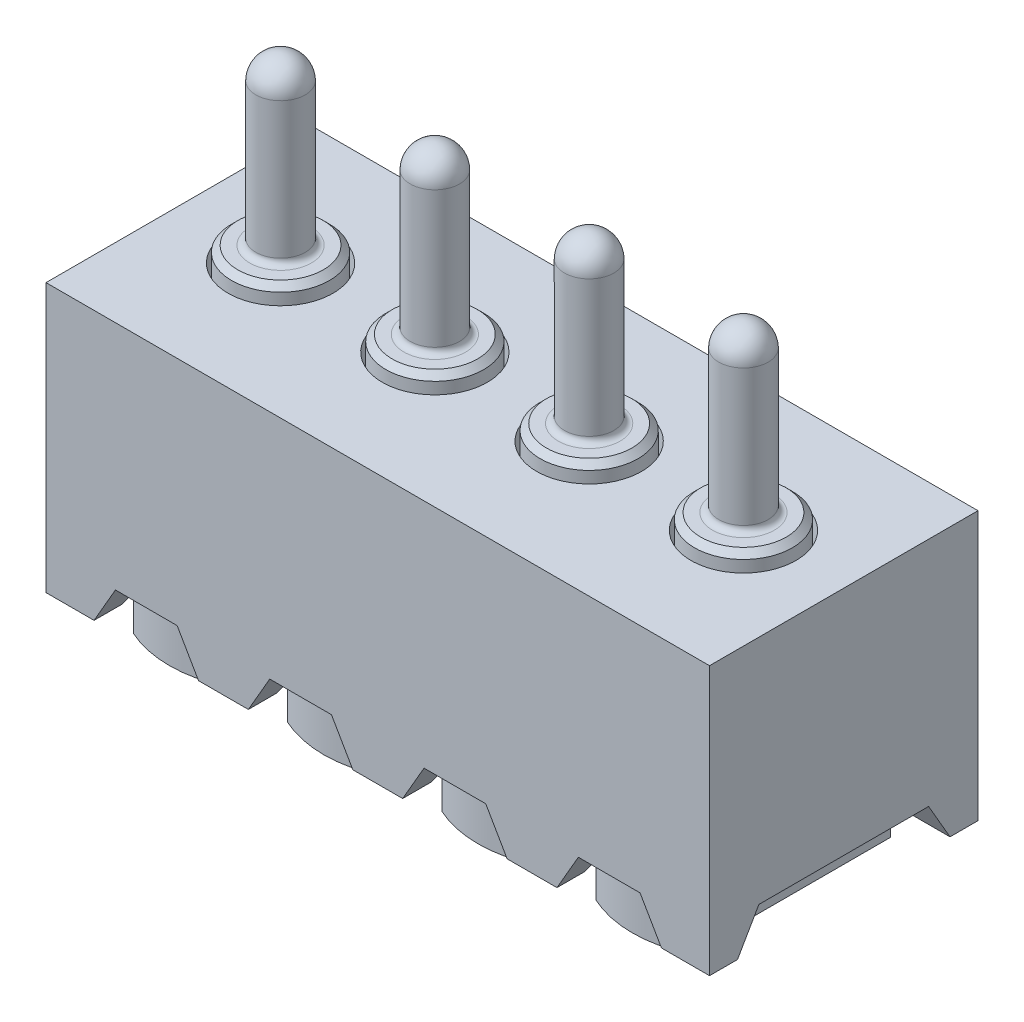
ISO-10303-21;
HEADER;
FILE_DESCRIPTION(('STEP AP214'),'2;1');
FILE_NAME('part.step','',(''),(''),'','','');
FILE_SCHEMA(('AUTOMOTIVE_DESIGN { 1 0 10303 214 1 1 1 1 }'));
ENDSEC;
DATA;
#1=APPLICATION_CONTEXT('core data for automotive mechanical design processes');
#2=APPLICATION_PROTOCOL_DEFINITION('international standard','automotive_design',2000,#1);
#3=PRODUCT_CONTEXT('',#1,'mechanical');
#4=PRODUCT('Part','Part','',(#3));
#5=PRODUCT_RELATED_PRODUCT_CATEGORY('part','',(#4));
#6=PRODUCT_DEFINITION_FORMATION('','',#4);
#7=PRODUCT_DEFINITION_CONTEXT('part definition',#1,'design');
#8=PRODUCT_DEFINITION('design','',#6,#7);
#9=PRODUCT_DEFINITION_SHAPE('','',#8);
#10=(LENGTH_UNIT() NAMED_UNIT(*) SI_UNIT(.MILLI.,.METRE.));
#11=(NAMED_UNIT(*) PLANE_ANGLE_UNIT() SI_UNIT($,.RADIAN.));
#12=(NAMED_UNIT(*) SI_UNIT($,.STERADIAN.) SOLID_ANGLE_UNIT());
#13=UNCERTAINTY_MEASURE_WITH_UNIT(LENGTH_MEASURE(1.E-05),#10,'distance_accuracy_value','');
#14=(GEOMETRIC_REPRESENTATION_CONTEXT(3) GLOBAL_UNCERTAINTY_ASSIGNED_CONTEXT((#13)) GLOBAL_UNIT_ASSIGNED_CONTEXT((#10,
#11,#12)) REPRESENTATION_CONTEXT('',''));
#15=CARTESIAN_POINT('',(0.,0.,0.));
#16=DIRECTION('',(0.,0.,1.));
#17=DIRECTION('',(1.,0.,0.));
#18=AXIS2_PLACEMENT_3D('',#15,#16,#17);
#19=CARTESIAN_POINT('',(2.98449999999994,-1.9049999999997,0.165100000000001));
#20=DIRECTION('',(1.,0.,0.));
#21=DIRECTION('',(0.,1.,0.));
#22=AXIS2_PLACEMENT_3D('',#19,#20,#21);
#23=PLANE('',#22);
#24=CARTESIAN_POINT('',(3.36549999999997,-1.90499999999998,-1.10489999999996));
#25=DIRECTION('',(0.,1.,0.));
#26=DIRECTION('',(-0.946372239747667,0.,-0.323078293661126));
#27=AXIS2_PLACEMENT_3D('',#24,#25,#26);
#28=CIRCLE('',#27,0.402590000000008);
#29=CARTESIAN_POINT('',(2.98449999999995,-1.9049999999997,-1.23496809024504));
#30=VERTEX_POINT('',#29);
#31=CARTESIAN_POINT('',(2.98449999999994,-1.9049999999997,-0.974831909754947));
#32=VERTEX_POINT('',#31);
#33=EDGE_CURVE('P0_E104',#30,#32,#28,.T.);
#34=ORIENTED_EDGE('',*,*,#33,.F.);
#35=DIRECTION('',(0.,0.,1.));
#36=VECTOR('',#35,1.);
#37=CARTESIAN_POINT('',(2.98449999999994,-1.9049999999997,0.165100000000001));
#38=LINE('',#37,#36);
#39=CARTESIAN_POINT('',(2.98449999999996,-1.9049999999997,-1.93614386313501));
#40=VERTEX_POINT('',#39);
#41=EDGE_CURVE('P0_E102',#40,#30,#38,.T.);
#42=ORIENTED_EDGE('',*,*,#41,.F.);
#43=DIRECTION('',(0.,-1.,0.));
#44=VECTOR('',#43,1.);
#45=CARTESIAN_POINT('',(2.98449999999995,-2.41299999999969,-1.93614386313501));
#46=LINE('',#45,#44);
#47=CARTESIAN_POINT('',(2.98449999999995,-2.41299999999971,-1.93614386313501));
#48=VERTEX_POINT('',#47);
#49=EDGE_CURVE('P0_E97',#48,#40,#46,.F.);
#50=ORIENTED_EDGE('',*,*,#49,.F.);
#51=DIRECTION('',(0.,0.,1.));
#52=VECTOR('',#51,1.);
#53=CARTESIAN_POINT('',(2.98449999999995,-2.41299999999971,-2.01929999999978));
#54=LINE('',#53,#52);
#55=CARTESIAN_POINT('',(2.98449999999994,-2.41299999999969,-0.273656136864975));
#56=VERTEX_POINT('',#55);
#57=EDGE_CURVE('P0_E88',#48,#56,#54,.T.);
#58=ORIENTED_EDGE('',*,*,#57,.T.);
#59=DIRECTION('',(0.,1.,0.));
#60=VECTOR('',#59,1.);
#61=CARTESIAN_POINT('',(2.98449999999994,-1.9049999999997,-0.273656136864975));
#62=LINE('',#61,#60);
#63=CARTESIAN_POINT('',(2.98449999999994,-1.9049999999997,-0.273656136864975));
#64=VERTEX_POINT('',#63);
#65=EDGE_CURVE('P0_E100',#64,#56,#62,.F.);
#66=ORIENTED_EDGE('',*,*,#65,.F.);
#67=DIRECTION('',(0.,0.,1.));
#68=VECTOR('',#67,1.);
#69=CARTESIAN_POINT('',(2.98449999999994,-1.9049999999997,0.165100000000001));
#70=LINE('',#69,#68);
#71=EDGE_CURVE('P0_E99',#32,#64,#70,.T.);
#72=ORIENTED_EDGE('',*,*,#71,.F.);
#73=EDGE_LOOP('',(#34,#42,#50,#58,#66,#72));
#74=FACE_BOUND('',#73,.T.);
#75=ADVANCED_FACE('P0_F17',(#74),#23,.F.);
#76=CARTESIAN_POINT('',(3.36549999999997,-2.41299999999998,-1.10489999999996));
#77=DIRECTION('',(0.,-1.,0.));
#78=DIRECTION('',(1.,0.,0.));
#79=AXIS2_PLACEMENT_3D('',#76,#77,#78);
#80=CYLINDRICAL_SURFACE('',#79,0.914399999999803);
#81=CARTESIAN_POINT('',(3.36549999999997,-2.41299999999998,-1.10489999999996));
#82=DIRECTION('',(0.,-1.,0.));
#83=DIRECTION('',(1.,0.,0.));
#84=AXIS2_PLACEMENT_3D('',#81,#82,#83);
#85=CIRCLE('',#84,0.914399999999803);
#86=CARTESIAN_POINT('',(3.7465,-2.413,-1.93614386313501));
#87=VERTEX_POINT('',#86);
#88=EDGE_CURVE('P0_E21',#87,#48,#85,.F.);
#89=ORIENTED_EDGE('',*,*,#88,.T.);
#90=ORIENTED_EDGE('',*,*,#49,.T.);
#91=CARTESIAN_POINT('',(3.36549999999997,-1.90499999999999,-1.10489999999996));
#92=DIRECTION('',(0.,-1.,0.));
#93=DIRECTION('',(1.,0.,0.));
#94=AXIS2_PLACEMENT_3D('',#91,#92,#93);
#95=CIRCLE('',#94,0.914399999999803);
#96=CARTESIAN_POINT('',(3.7465,-1.90499999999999,-1.93614386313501));
#97=VERTEX_POINT('',#96);
#98=EDGE_CURVE('P0_E75',#40,#97,#95,.T.);
#99=ORIENTED_EDGE('',*,*,#98,.T.);
#100=DIRECTION('',(0.,-1.,0.));
#101=VECTOR('',#100,1.);
#102=CARTESIAN_POINT('',(3.7465,-1.905,-1.93614386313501));
#103=LINE('',#102,#101);
#104=EDGE_CURVE('P0_E69',#97,#87,#103,.T.);
#105=ORIENTED_EDGE('',*,*,#104,.T.);
#106=EDGE_LOOP('',(#89,#90,#99,#105));
#107=FACE_BOUND('',#106,.T.);
#108=ADVANCED_FACE('P0_F71',(#107),#80,.T.);
#109=CARTESIAN_POINT('',(3.36549999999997,-2.413,-2.01929999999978));
#110=DIRECTION('',(0.,1.,0.));
#111=DIRECTION('',(-1.,0.,0.));
#112=AXIS2_PLACEMENT_3D('',#109,#110,#111);
#113=PLANE('',#112);
#114=DIRECTION('',(0.,0.,1.));
#115=VECTOR('',#114,1.);
#116=CARTESIAN_POINT('',(3.74649999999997,-2.41299999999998,0.165100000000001));
#117=LINE('',#116,#115);
#118=CARTESIAN_POINT('',(3.74649999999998,-2.41299999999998,-0.273656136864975));
#119=VERTEX_POINT('',#118);
#120=EDGE_CURVE('P0_E80',#87,#119,#117,.T.);
#121=ORIENTED_EDGE('',*,*,#120,.T.);
#122=CARTESIAN_POINT('',(3.36549999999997,-2.41299999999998,-1.10489999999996));
#123=DIRECTION('',(0.,-1.,0.));
#124=DIRECTION('',(1.,0.,0.));
#125=AXIS2_PLACEMENT_3D('',#122,#123,#124);
#126=CIRCLE('',#125,0.914399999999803);
#127=EDGE_CURVE('P0_E89',#56,#119,#126,.F.);
#128=ORIENTED_EDGE('',*,*,#127,.F.);
#129=ORIENTED_EDGE('',*,*,#57,.F.);
#130=ORIENTED_EDGE('',*,*,#88,.F.);
#131=EDGE_LOOP('',(#121,#128,#129,#130));
#132=FACE_BOUND('',#131,.T.);
#133=ADVANCED_FACE('P0_F84',(#132),#113,.F.);
#134=CARTESIAN_POINT('',(3.36549999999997,-2.41299999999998,-1.10489999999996));
#135=DIRECTION('',(0.,-1.,0.));
#136=DIRECTION('',(1.,0.,0.));
#137=AXIS2_PLACEMENT_3D('',#134,#135,#136);
#138=CYLINDRICAL_SURFACE('',#137,0.914399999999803);
#139=CARTESIAN_POINT('',(3.36549999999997,-1.90499999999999,-1.10489999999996));
#140=DIRECTION('',(0.,-1.,0.));
#141=DIRECTION('',(1.,0.,0.));
#142=AXIS2_PLACEMENT_3D('',#139,#140,#141);
#143=CIRCLE('',#142,0.914399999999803);
#144=CARTESIAN_POINT('',(3.74649999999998,-1.90499999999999,-0.273656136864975));
#145=VERTEX_POINT('',#144);
#146=EDGE_CURVE('P0_E81',#145,#64,#143,.T.);
#147=ORIENTED_EDGE('',*,*,#146,.T.);
#148=ORIENTED_EDGE('',*,*,#65,.T.);
#149=ORIENTED_EDGE('',*,*,#127,.T.);
#150=DIRECTION('',(0.,-1.,0.));
#151=VECTOR('',#150,1.);
#152=CARTESIAN_POINT('',(3.74649999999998,-1.905,-0.273656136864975));
#153=LINE('',#152,#151);
#154=EDGE_CURVE('P0_E92',#119,#145,#153,.F.);
#155=ORIENTED_EDGE('',*,*,#154,.T.);
#156=EDGE_LOOP('',(#147,#148,#149,#155));
#157=FACE_BOUND('',#156,.T.);
#158=ADVANCED_FACE('P0_F187',(#157),#138,.T.);
#159=CARTESIAN_POINT('',(3.36550000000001,1.29677440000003,-1.10490000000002));
#160=DIRECTION('',(1.,0.,0.));
#161=DIRECTION('',(0.,0.,-1.));
#162=AXIS2_PLACEMENT_3D('',#159,#160,#161);
#163=SPHERICAL_SURFACE('',#162,0.203225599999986);
#164=CARTESIAN_POINT('',(3.36550000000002,1.30000000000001,-1.10490000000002));
#165=DIRECTION('',(0.,-1.,0.));
#166=DIRECTION('',(1.,0.,0.));
#167=AXIS2_PLACEMENT_3D('',#164,#165,#166);
#168=CIRCLE('',#167,0.203199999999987);
#169=CARTESIAN_POINT('',(3.5687,1.30000000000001,-1.10490000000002));
#170=VERTEX_POINT('',#169);
#171=EDGE_CURVE('P0_E195',#170,#170,#168,.T.);
#172=ORIENTED_EDGE('',*,*,#171,.F.);
#173=EDGE_LOOP('',(#172));
#174=FACE_BOUND('',#173,.T.);
#175=ADVANCED_FACE('P0_F182',(#174),#163,.T.);
#176=CARTESIAN_POINT('',(3.36549999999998,-1.90499999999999,-1.50749));
#177=DIRECTION('',(0.,-1.,0.));
#178=DIRECTION('',(1.,0.,0.));
#179=AXIS2_PLACEMENT_3D('',#176,#177,#178);
#180=PLANE('',#179);
#181=DIRECTION('',(0.,0.,1.));
#182=VECTOR('',#181,1.);
#183=CARTESIAN_POINT('',(3.74649999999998,-1.90499999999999,0.165100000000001));
#184=LINE('',#183,#182);
#185=CARTESIAN_POINT('',(3.74649999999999,-1.90499999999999,-1.23496809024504));
#186=VERTEX_POINT('',#185);
#187=EDGE_CURVE('P0_E194',#186,#97,#184,.F.);
#188=ORIENTED_EDGE('',*,*,#187,.T.);
#189=ORIENTED_EDGE('',*,*,#98,.F.);
#190=ORIENTED_EDGE('',*,*,#41,.T.);
#191=CARTESIAN_POINT('',(3.36549999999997,-1.90499999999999,-1.10489999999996));
#192=DIRECTION('',(0.,-1.,0.));
#193=DIRECTION('',(1.,0.,0.));
#194=AXIS2_PLACEMENT_3D('',#191,#192,#193);
#195=CIRCLE('',#194,0.402590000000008);
#196=EDGE_CURVE('P0_E198',#186,#30,#195,.F.);
#197=ORIENTED_EDGE('',*,*,#196,.F.);
#198=EDGE_LOOP('',(#188,#189,#190,#197));
#199=FACE_BOUND('',#198,.T.);
#200=ADVANCED_FACE('P0_F179',(#199),#180,.F.);
#201=CARTESIAN_POINT('',(3.36549999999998,-1.90499999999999,-1.50749));
#202=DIRECTION('',(0.,-1.,0.));
#203=DIRECTION('',(1.,0.,0.));
#204=AXIS2_PLACEMENT_3D('',#201,#202,#203);
#205=PLANE('',#204);
#206=DIRECTION('',(0.,0.,1.));
#207=VECTOR('',#206,1.);
#208=CARTESIAN_POINT('',(3.74649999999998,-1.90499999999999,0.165100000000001));
#209=LINE('',#208,#207);
#210=CARTESIAN_POINT('',(3.74649999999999,-1.90499999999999,-0.974831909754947));
#211=VERTEX_POINT('',#210);
#212=EDGE_CURVE('P0_E36',#145,#211,#209,.F.);
#213=ORIENTED_EDGE('',*,*,#212,.T.);
#214=CARTESIAN_POINT('',(3.36549999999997,-1.90499999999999,-1.10489999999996));
#215=DIRECTION('',(0.,-1.,0.));
#216=DIRECTION('',(1.,0.,0.));
#217=AXIS2_PLACEMENT_3D('',#214,#215,#216);
#218=CIRCLE('',#217,0.402590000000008);
#219=EDGE_CURVE('P0_E202',#32,#211,#218,.F.);
#220=ORIENTED_EDGE('',*,*,#219,.F.);
#221=ORIENTED_EDGE('',*,*,#71,.T.);
#222=ORIENTED_EDGE('',*,*,#146,.F.);
#223=EDGE_LOOP('',(#213,#220,#221,#222));
#224=FACE_BOUND('',#223,.T.);
#225=ADVANCED_FACE('P0_F176',(#224),#205,.F.);
#226=CARTESIAN_POINT('',(3.74649999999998,-1.905,0.165100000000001));
#227=DIRECTION('',(-1.,0.,0.));
#228=DIRECTION('',(0.,-1.,0.));
#229=AXIS2_PLACEMENT_3D('',#226,#227,#228);
#230=PLANE('',#229);
#231=CARTESIAN_POINT('',(3.36549999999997,-1.90499999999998,-1.10489999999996));
#232=DIRECTION('',(0.,1.,0.));
#233=DIRECTION('',(0.946372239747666,0.,0.323078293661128));
#234=AXIS2_PLACEMENT_3D('',#231,#232,#233);
#235=CIRCLE('',#234,0.402590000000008);
#236=EDGE_CURVE('P0_E163',#211,#186,#235,.T.);
#237=ORIENTED_EDGE('',*,*,#236,.F.);
#238=ORIENTED_EDGE('',*,*,#212,.F.);
#239=ORIENTED_EDGE('',*,*,#154,.F.);
#240=ORIENTED_EDGE('',*,*,#120,.F.);
#241=ORIENTED_EDGE('',*,*,#104,.F.);
#242=ORIENTED_EDGE('',*,*,#187,.F.);
#243=EDGE_LOOP('',(#237,#238,#239,#240,#241,#242));
#244=FACE_BOUND('',#243,.T.);
#245=ADVANCED_FACE('P0_F91',(#244),#230,.F.);
#246=CARTESIAN_POINT('',(3.36549999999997,-2.41299999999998,-1.10489999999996));
#247=DIRECTION('',(0.,-1.,0.));
#248=DIRECTION('',(1.,0.,0.));
#249=AXIS2_PLACEMENT_3D('',#246,#247,#248);
#250=CYLINDRICAL_SURFACE('',#249,0.203199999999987);
#251=CARTESIAN_POINT('',(3.3655,0.177800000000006,-1.10490000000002));
#252=DIRECTION('',(0.,-1.,0.));
#253=DIRECTION('',(-1.,0.,0.));
#254=AXIS2_PLACEMENT_3D('',#251,#252,#253);
#255=CIRCLE('',#254,0.203199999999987);
#256=CARTESIAN_POINT('',(3.16230000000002,0.177800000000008,-1.10490000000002));
#257=VERTEX_POINT('',#256);
#258=EDGE_CURVE('P0_E212',#257,#257,#255,.F.);
#259=ORIENTED_EDGE('',*,*,#258,.T.);
#260=EDGE_LOOP('',(#259));
#261=FACE_BOUND('',#260,.T.);
#262=ORIENTED_EDGE('',*,*,#171,.T.);
#263=EDGE_LOOP('',(#262));
#264=FACE_BOUND('',#263,.T.);
#265=ADVANCED_FACE('P0_F143',(#261,#264),#250,.T.);
#266=CARTESIAN_POINT('',(3.36549999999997,-2.41299999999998,-1.10489999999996));
#267=DIRECTION('',(0.,-1.,0.));
#268=DIRECTION('',(1.,0.,0.));
#269=AXIS2_PLACEMENT_3D('',#266,#267,#268);
#270=CYLINDRICAL_SURFACE('',#269,0.402590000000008);
#271=CARTESIAN_POINT('',(3.36549999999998,-1.09219999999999,-1.10489999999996));
#272=DIRECTION('',(0.,-1.,0.));
#273=DIRECTION('',(1.,0.,0.));
#274=AXIS2_PLACEMENT_3D('',#271,#272,#273);
#275=CIRCLE('',#274,0.402590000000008);
#276=CARTESIAN_POINT('',(3.76808999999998,-1.09219999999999,-1.10489999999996));
#277=VERTEX_POINT('',#276);
#278=EDGE_CURVE('P0_E214',#277,#277,#275,.T.);
#279=ORIENTED_EDGE('',*,*,#278,.T.);
#280=EDGE_LOOP('',(#279));
#281=FACE_BOUND('',#280,.T.);
#282=ORIENTED_EDGE('',*,*,#219,.T.);
#283=ORIENTED_EDGE('',*,*,#236,.T.);
#284=ORIENTED_EDGE('',*,*,#196,.T.);
#285=ORIENTED_EDGE('',*,*,#33,.T.);
#286=EDGE_LOOP('',(#282,#283,#284,#285));
#287=FACE_BOUND('',#286,.T.);
#288=ADVANCED_FACE('P0_F132',(#281,#287),#270,.T.);
#289=CARTESIAN_POINT('',(3.3655,0.177800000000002,-1.10490000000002));
#290=DIRECTION('',(0.,-1.,0.));
#291=DIRECTION('',(-1.,0.,0.));
#292=AXIS2_PLACEMENT_3D('',#289,#290,#291);
#293=TOROIDAL_SURFACE('',#292,0.253999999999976,0.0507999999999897);
#294=ORIENTED_EDGE('',*,*,#258,.F.);
#295=EDGE_LOOP('',(#294));
#296=FACE_BOUND('',#295,.T.);
#297=CARTESIAN_POINT('',(3.3655,0.127000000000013,-1.10490000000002));
#298=DIRECTION('',(0.,1.,0.));
#299=DIRECTION('',(-1.,0.,0.));
#300=AXIS2_PLACEMENT_3D('',#297,#298,#299);
#301=CIRCLE('',#300,0.253999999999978);
#302=CARTESIAN_POINT('',(3.11150000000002,0.127000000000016,-1.10490000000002));
#303=VERTEX_POINT('',#302);
#304=EDGE_CURVE('P0_E221',#303,#303,#301,.T.);
#305=ORIENTED_EDGE('',*,*,#304,.T.);
#306=EDGE_LOOP('',(#305));
#307=FACE_BOUND('',#306,.T.);
#308=ADVANCED_FACE('P0_F142',(#296,#307),#293,.F.);
#309=CARTESIAN_POINT('',(3.36549999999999,-1.09219999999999,-1.50749));
#310=DIRECTION('',(0.,1.,0.));
#311=DIRECTION('',(-1.,0.,0.));
#312=AXIS2_PLACEMENT_3D('',#309,#310,#311);
#313=PLANE('',#312);
#314=CARTESIAN_POINT('',(3.36549999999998,-1.09219999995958,-1.10489999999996));
#315=DIRECTION('',(0.,-1.,0.));
#316=DIRECTION('',(1.,0.,0.));
#317=AXIS2_PLACEMENT_3D('',#314,#315,#316);
#318=CIRCLE('',#317,0.44068999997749);
#319=CARTESIAN_POINT('',(3.80618999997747,-1.09219999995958,-1.10489999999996));
#320=VERTEX_POINT('',#319);
#321=EDGE_CURVE('P0_E222',#320,#320,#318,.F.);
#322=ORIENTED_EDGE('',*,*,#321,.F.);
#323=EDGE_LOOP('',(#322));
#324=FACE_BOUND('',#323,.T.);
#325=ORIENTED_EDGE('',*,*,#278,.F.);
#326=EDGE_LOOP('',(#325));
#327=FACE_BOUND('',#326,.T.);
#328=ADVANCED_FACE('P0_F258',(#324,#327),#313,.F.);
#329=CARTESIAN_POINT('',(3.3655,0.127000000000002,-1.45669000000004));
#330=DIRECTION('',(0.,-1.,0.));
#331=DIRECTION('',(1.,0.,0.));
#332=AXIS2_PLACEMENT_3D('',#329,#330,#331);
#333=PLANE('',#332);
#334=ORIENTED_EDGE('',*,*,#304,.F.);
#335=EDGE_LOOP('',(#334));
#336=FACE_BOUND('',#335,.T.);
#337=CARTESIAN_POINT('',(3.3655,0.12700000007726,-1.10490000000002));
#338=DIRECTION('',(0.,-1.,0.));
#339=DIRECTION('',(1.,0.,0.));
#340=AXIS2_PLACEMENT_3D('',#337,#338,#339);
#341=CIRCLE('',#340,0.351789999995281);
#342=CARTESIAN_POINT('',(3.71728999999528,0.127000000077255,-1.10490000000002));
#343=VERTEX_POINT('',#342);
#344=EDGE_CURVE('P0_E130',#343,#343,#341,.T.);
#345=ORIENTED_EDGE('',*,*,#344,.F.);
#346=EDGE_LOOP('',(#345));
#347=FACE_BOUND('',#346,.T.);
#348=ADVANCED_FACE('P0_F248',(#336,#347),#333,.F.);
#349=CARTESIAN_POINT('',(3.36549999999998,-1.09219999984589,-1.10489999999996));
#350=DIRECTION('',(0.,-1.,0.));
#351=DIRECTION('',(1.,0.,0.));
#352=AXIS2_PLACEMENT_3D('',#349,#350,#351);
#353=CONICAL_SURFACE('',#352,0.440689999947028,0.261799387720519);
#354=CARTESIAN_POINT('',(3.36549999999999,-0.950008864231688,-1.10489999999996));
#355=DIRECTION('',(0.,-1.,0.));
#356=DIRECTION('',(1.,0.,0.));
#357=AXIS2_PLACEMENT_3D('',#354,#355,#356);
#358=CIRCLE('',#357,0.402590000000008);
#359=CARTESIAN_POINT('',(3.76809,-0.950008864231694,-1.10489999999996));
#360=VERTEX_POINT('',#359);
#361=EDGE_CURVE('P0_E27',#360,#360,#358,.F.);
#362=ORIENTED_EDGE('',*,*,#361,.F.);
#363=EDGE_LOOP('',(#362));
#364=FACE_BOUND('',#363,.T.);
#365=ORIENTED_EDGE('',*,*,#321,.T.);
#366=EDGE_LOOP('',(#365));
#367=FACE_BOUND('',#366,.T.);
#368=ADVANCED_FACE('P0_F257',(#364,#367),#353,.T.);
#369=CARTESIAN_POINT('',(3.3655,0.0762000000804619,-1.10490000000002));
#370=DIRECTION('',(0.,-1.,0.));
#371=DIRECTION('',(1.,0.,0.));
#372=AXIS2_PLACEMENT_3D('',#369,#370,#371);
#373=CONICAL_SURFACE('',#372,0.402589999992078,0.785398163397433);
#374=ORIENTED_EDGE('',*,*,#344,.T.);
#375=EDGE_LOOP('',(#374));
#376=FACE_BOUND('',#375,.T.);
#377=CARTESIAN_POINT('',(3.3655,0.0762000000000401,-1.10490000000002));
#378=DIRECTION('',(0.,-1.,0.));
#379=DIRECTION('',(1.,0.,0.));
#380=AXIS2_PLACEMENT_3D('',#377,#378,#379);
#381=CIRCLE('',#380,0.402590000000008);
#382=CARTESIAN_POINT('',(3.76809000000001,0.0762000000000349,-1.10490000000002));
#383=VERTEX_POINT('',#382);
#384=EDGE_CURVE('P0_E11',#383,#383,#381,.T.);
#385=ORIENTED_EDGE('',*,*,#384,.F.);
#386=EDGE_LOOP('',(#385));
#387=FACE_BOUND('',#386,.T.);
#388=ADVANCED_FACE('P0_F270',(#376,#387),#373,.T.);
#389=CARTESIAN_POINT('',(3.36549999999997,-2.41299999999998,-1.10489999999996));
#390=DIRECTION('',(0.,-1.,0.));
#391=DIRECTION('',(1.,0.,0.));
#392=AXIS2_PLACEMENT_3D('',#389,#390,#391);
#393=CYLINDRICAL_SURFACE('',#392,0.402590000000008);
#394=ORIENTED_EDGE('',*,*,#384,.T.);
#395=EDGE_LOOP('',(#394));
#396=FACE_BOUND('',#395,.T.);
#397=ORIENTED_EDGE('',*,*,#361,.T.);
#398=EDGE_LOOP('',(#397));
#399=FACE_BOUND('',#398,.T.);
#400=ADVANCED_FACE('P0_F268',(#396,#399),#393,.T.);
#401=CLOSED_SHELL('',(#75,#108,#133,#158,#175,#200,#225,#245,#265,#288,#308,#328,#348,#368,#388,#400));
#402=MANIFOLD_SOLID_BREP('P0_B1',#401);
#403=CARTESIAN_POINT('',(4.25449999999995,-1.90499999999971,0.165100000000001));
#404=DIRECTION('',(1.,0.,0.));
#405=DIRECTION('',(0.,1.,0.));
#406=AXIS2_PLACEMENT_3D('',#403,#404,#405);
#407=PLANE('',#406);
#408=CARTESIAN_POINT('',(4.63549999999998,-1.90499999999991,-1.10489999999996));
#409=DIRECTION('',(0.,1.,0.));
#410=DIRECTION('',(-0.946372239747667,0.,-0.323078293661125));
#411=AXIS2_PLACEMENT_3D('',#408,#409,#410);
#412=CIRCLE('',#411,0.402590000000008);
#413=CARTESIAN_POINT('',(4.25449999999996,-1.90499999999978,-1.23496809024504));
#414=VERTEX_POINT('',#413);
#415=CARTESIAN_POINT('',(4.25449999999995,-1.90499999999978,-0.974831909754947));
#416=VERTEX_POINT('',#415);
#417=EDGE_CURVE('P1_E104',#414,#416,#412,.T.);
#418=ORIENTED_EDGE('',*,*,#417,.F.);
#419=DIRECTION('',(0.,0.,1.));
#420=VECTOR('',#419,1.);
#421=CARTESIAN_POINT('',(4.25449999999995,-1.9049999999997,0.165100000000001));
#422=LINE('',#421,#420);
#423=CARTESIAN_POINT('',(4.25449999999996,-1.90499999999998,-1.93614386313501));
#424=VERTEX_POINT('',#423);
#425=EDGE_CURVE('P1_E102',#424,#414,#422,.T.);
#426=ORIENTED_EDGE('',*,*,#425,.F.);
#427=DIRECTION('',(0.,-1.,0.));
#428=VECTOR('',#427,1.);
#429=CARTESIAN_POINT('',(4.25449999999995,-2.41299999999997,-1.93614386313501));
#430=LINE('',#429,#428);
#431=CARTESIAN_POINT('',(4.25449999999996,-2.41299999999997,-1.93614386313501));
#432=VERTEX_POINT('',#431);
#433=EDGE_CURVE('P1_E97',#432,#424,#430,.F.);
#434=ORIENTED_EDGE('',*,*,#433,.F.);
#435=DIRECTION('',(0.,0.,1.));
#436=VECTOR('',#435,1.);
#437=CARTESIAN_POINT('',(4.25449999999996,-2.41299999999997,-2.01929999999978));
#438=LINE('',#437,#436);
#439=CARTESIAN_POINT('',(4.25449999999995,-2.41299999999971,-0.273656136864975));
#440=VERTEX_POINT('',#439);
#441=EDGE_CURVE('P1_E88',#432,#440,#438,.T.);
#442=ORIENTED_EDGE('',*,*,#441,.T.);
#443=DIRECTION('',(0.,1.,0.));
#444=VECTOR('',#443,1.);
#445=CARTESIAN_POINT('',(4.25449999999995,-1.90499999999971,-0.273656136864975));
#446=LINE('',#445,#444);
#447=CARTESIAN_POINT('',(4.25449999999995,-1.9049999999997,-0.273656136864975));
#448=VERTEX_POINT('',#447);
#449=EDGE_CURVE('P1_E100',#448,#440,#446,.F.);
#450=ORIENTED_EDGE('',*,*,#449,.F.);
#451=DIRECTION('',(0.,0.,1.));
#452=VECTOR('',#451,1.);
#453=CARTESIAN_POINT('',(4.25449999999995,-1.9049999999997,0.165100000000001));
#454=LINE('',#453,#452);
#455=EDGE_CURVE('P1_E99',#416,#448,#454,.T.);
#456=ORIENTED_EDGE('',*,*,#455,.F.);
#457=EDGE_LOOP('',(#418,#426,#434,#442,#450,#456));
#458=FACE_BOUND('',#457,.T.);
#459=ADVANCED_FACE('P1_F17',(#458),#407,.F.);
#460=CARTESIAN_POINT('',(4.63549999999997,-2.4129999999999,-1.10489999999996));
#461=DIRECTION('',(0.,-1.,0.));
#462=DIRECTION('',(1.,0.,0.));
#463=AXIS2_PLACEMENT_3D('',#460,#461,#462);
#464=CYLINDRICAL_SURFACE('',#463,0.914399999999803);
#465=CARTESIAN_POINT('',(4.63549999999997,-2.4129999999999,-1.10489999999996));
#466=DIRECTION('',(0.,-1.,0.));
#467=DIRECTION('',(1.,0.,0.));
#468=AXIS2_PLACEMENT_3D('',#465,#466,#467);
#469=CIRCLE('',#468,0.914399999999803);
#470=CARTESIAN_POINT('',(5.0165,-2.41299999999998,-1.93614386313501));
#471=VERTEX_POINT('',#470);
#472=EDGE_CURVE('P1_E21',#471,#432,#469,.F.);
#473=ORIENTED_EDGE('',*,*,#472,.T.);
#474=ORIENTED_EDGE('',*,*,#433,.T.);
#475=CARTESIAN_POINT('',(4.63549999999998,-1.90499999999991,-1.10489999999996));
#476=DIRECTION('',(0.,-1.,0.));
#477=DIRECTION('',(1.,0.,0.));
#478=AXIS2_PLACEMENT_3D('',#475,#476,#477);
#479=CIRCLE('',#478,0.914399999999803);
#480=CARTESIAN_POINT('',(5.01650000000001,-1.90499999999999,-1.93614386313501));
#481=VERTEX_POINT('',#480);
#482=EDGE_CURVE('P1_E75',#424,#481,#479,.T.);
#483=ORIENTED_EDGE('',*,*,#482,.T.);
#484=DIRECTION('',(0.,-1.,0.));
#485=VECTOR('',#484,1.);
#486=CARTESIAN_POINT('',(5.01650000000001,-1.90499999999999,-1.93614386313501));
#487=LINE('',#486,#485);
#488=EDGE_CURVE('P1_E69',#481,#471,#487,.T.);
#489=ORIENTED_EDGE('',*,*,#488,.T.);
#490=EDGE_LOOP('',(#473,#474,#483,#489));
#491=FACE_BOUND('',#490,.T.);
#492=ADVANCED_FACE('P1_F71',(#491),#464,.T.);
#493=CARTESIAN_POINT('',(4.63549999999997,-2.4129999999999,-2.01929999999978));
#494=DIRECTION('',(0.,1.,0.));
#495=DIRECTION('',(-1.,0.,0.));
#496=AXIS2_PLACEMENT_3D('',#493,#494,#495);
#497=PLANE('',#496);
#498=DIRECTION('',(0.,0.,1.));
#499=VECTOR('',#498,1.);
#500=CARTESIAN_POINT('',(5.01649999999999,-2.41299999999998,0.165100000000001));
#501=LINE('',#500,#499);
#502=CARTESIAN_POINT('',(5.01649999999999,-2.41299999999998,-0.273656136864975));
#503=VERTEX_POINT('',#502);
#504=EDGE_CURVE('P1_E80',#471,#503,#501,.T.);
#505=ORIENTED_EDGE('',*,*,#504,.T.);
#506=CARTESIAN_POINT('',(4.63549999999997,-2.41299999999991,-1.10489999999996));
#507=DIRECTION('',(0.,-1.,0.));
#508=DIRECTION('',(1.,0.,0.));
#509=AXIS2_PLACEMENT_3D('',#506,#507,#508);
#510=CIRCLE('',#509,0.914399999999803);
#511=EDGE_CURVE('P1_E89',#440,#503,#510,.F.);
#512=ORIENTED_EDGE('',*,*,#511,.F.);
#513=ORIENTED_EDGE('',*,*,#441,.F.);
#514=ORIENTED_EDGE('',*,*,#472,.F.);
#515=EDGE_LOOP('',(#505,#512,#513,#514));
#516=FACE_BOUND('',#515,.T.);
#517=ADVANCED_FACE('P1_F84',(#516),#497,.F.);
#518=CARTESIAN_POINT('',(4.63549999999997,-2.4129999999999,-1.10489999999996));
#519=DIRECTION('',(0.,-1.,0.));
#520=DIRECTION('',(1.,0.,0.));
#521=AXIS2_PLACEMENT_3D('',#518,#519,#520);
#522=CYLINDRICAL_SURFACE('',#521,0.914399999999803);
#523=CARTESIAN_POINT('',(4.63549999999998,-1.90499999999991,-1.10489999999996));
#524=DIRECTION('',(0.,-1.,0.));
#525=DIRECTION('',(1.,0.,0.));
#526=AXIS2_PLACEMENT_3D('',#523,#524,#525);
#527=CIRCLE('',#526,0.914399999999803);
#528=CARTESIAN_POINT('',(5.0165,-1.90499999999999,-0.273656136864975));
#529=VERTEX_POINT('',#528);
#530=EDGE_CURVE('P1_E81',#529,#448,#527,.T.);
#531=ORIENTED_EDGE('',*,*,#530,.T.);
#532=ORIENTED_EDGE('',*,*,#449,.T.);
#533=ORIENTED_EDGE('',*,*,#511,.T.);
#534=DIRECTION('',(0.,-1.,0.));
#535=VECTOR('',#534,1.);
#536=CARTESIAN_POINT('',(5.0165,-1.90499999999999,-0.273656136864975));
#537=LINE('',#536,#535);
#538=EDGE_CURVE('P1_E92',#503,#529,#537,.F.);
#539=ORIENTED_EDGE('',*,*,#538,.T.);
#540=EDGE_LOOP('',(#531,#532,#533,#539));
#541=FACE_BOUND('',#540,.T.);
#542=ADVANCED_FACE('P1_F187',(#541),#522,.T.);
#543=CARTESIAN_POINT('',(4.63550000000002,1.29677440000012,-1.10490000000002));
#544=DIRECTION('',(1.,0.,0.));
#545=DIRECTION('',(0.,0.,-1.));
#546=AXIS2_PLACEMENT_3D('',#543,#544,#545);
#547=SPHERICAL_SURFACE('',#546,0.203225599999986);
#548=CARTESIAN_POINT('',(4.63550000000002,1.30000000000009,-1.10490000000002));
#549=DIRECTION('',(0.,-1.,0.));
#550=DIRECTION('',(1.,0.,0.));
#551=AXIS2_PLACEMENT_3D('',#548,#549,#550);
#552=CIRCLE('',#551,0.203199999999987);
#553=CARTESIAN_POINT('',(4.83870000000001,1.30000000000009,-1.10490000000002));
#554=VERTEX_POINT('',#553);
#555=EDGE_CURVE('P1_E195',#554,#554,#552,.T.);
#556=ORIENTED_EDGE('',*,*,#555,.F.);
#557=EDGE_LOOP('',(#556));
#558=FACE_BOUND('',#557,.T.);
#559=ADVANCED_FACE('P1_F182',(#558),#547,.T.);
#560=CARTESIAN_POINT('',(4.63549999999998,-1.90499999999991,-1.50749));
#561=DIRECTION('',(0.,-1.,0.));
#562=DIRECTION('',(1.,0.,0.));
#563=AXIS2_PLACEMENT_3D('',#560,#561,#562);
#564=PLANE('',#563);
#565=DIRECTION('',(0.,0.,1.));
#566=VECTOR('',#565,1.);
#567=CARTESIAN_POINT('',(5.01649999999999,-1.90499999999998,0.165100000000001));
#568=LINE('',#567,#566);
#569=CARTESIAN_POINT('',(5.0165,-1.90499999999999,-1.23496809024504));
#570=VERTEX_POINT('',#569);
#571=EDGE_CURVE('P1_E194',#570,#481,#568,.F.);
#572=ORIENTED_EDGE('',*,*,#571,.T.);
#573=ORIENTED_EDGE('',*,*,#482,.F.);
#574=ORIENTED_EDGE('',*,*,#425,.T.);
#575=CARTESIAN_POINT('',(4.63549999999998,-1.90499999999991,-1.10489999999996));
#576=DIRECTION('',(0.,-1.,0.));
#577=DIRECTION('',(1.,0.,0.));
#578=AXIS2_PLACEMENT_3D('',#575,#576,#577);
#579=CIRCLE('',#578,0.402590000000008);
#580=EDGE_CURVE('P1_E198',#570,#414,#579,.F.);
#581=ORIENTED_EDGE('',*,*,#580,.F.);
#582=EDGE_LOOP('',(#572,#573,#574,#581));
#583=FACE_BOUND('',#582,.T.);
#584=ADVANCED_FACE('P1_F179',(#583),#564,.F.);
#585=CARTESIAN_POINT('',(4.63549999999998,-1.90499999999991,-1.50749));
#586=DIRECTION('',(0.,-1.,0.));
#587=DIRECTION('',(1.,0.,0.));
#588=AXIS2_PLACEMENT_3D('',#585,#586,#587);
#589=PLANE('',#588);
#590=DIRECTION('',(0.,0.,1.));
#591=VECTOR('',#590,1.);
#592=CARTESIAN_POINT('',(5.01649999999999,-1.90499999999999,0.165100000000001));
#593=LINE('',#592,#591);
#594=CARTESIAN_POINT('',(5.0165,-1.90499999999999,-0.974831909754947));
#595=VERTEX_POINT('',#594);
#596=EDGE_CURVE('P1_E36',#529,#595,#593,.F.);
#597=ORIENTED_EDGE('',*,*,#596,.T.);
#598=CARTESIAN_POINT('',(4.63549999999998,-1.90499999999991,-1.10489999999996));
#599=DIRECTION('',(0.,-1.,0.));
#600=DIRECTION('',(1.,0.,0.));
#601=AXIS2_PLACEMENT_3D('',#598,#599,#600);
#602=CIRCLE('',#601,0.402590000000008);
#603=EDGE_CURVE('P1_E202',#416,#595,#602,.F.);
#604=ORIENTED_EDGE('',*,*,#603,.F.);
#605=ORIENTED_EDGE('',*,*,#455,.T.);
#606=ORIENTED_EDGE('',*,*,#530,.F.);
#607=EDGE_LOOP('',(#597,#604,#605,#606));
#608=FACE_BOUND('',#607,.T.);
#609=ADVANCED_FACE('P1_F176',(#608),#589,.F.);
#610=CARTESIAN_POINT('',(5.01649999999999,-1.90499999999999,0.165100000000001));
#611=DIRECTION('',(-1.,0.,0.));
#612=DIRECTION('',(0.,-1.,0.));
#613=AXIS2_PLACEMENT_3D('',#610,#611,#612);
#614=PLANE('',#613);
#615=CARTESIAN_POINT('',(4.63549999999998,-1.9049999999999,-1.10489999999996));
#616=DIRECTION('',(0.,1.,0.));
#617=DIRECTION('',(0.946372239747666,0.,0.323078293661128));
#618=AXIS2_PLACEMENT_3D('',#615,#616,#617);
#619=CIRCLE('',#618,0.402590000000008);
#620=EDGE_CURVE('P1_E163',#595,#570,#619,.T.);
#621=ORIENTED_EDGE('',*,*,#620,.F.);
#622=ORIENTED_EDGE('',*,*,#596,.F.);
#623=ORIENTED_EDGE('',*,*,#538,.F.);
#624=ORIENTED_EDGE('',*,*,#504,.F.);
#625=ORIENTED_EDGE('',*,*,#488,.F.);
#626=ORIENTED_EDGE('',*,*,#571,.F.);
#627=EDGE_LOOP('',(#621,#622,#623,#624,#625,#626));
#628=FACE_BOUND('',#627,.T.);
#629=ADVANCED_FACE('P1_F91',(#628),#614,.F.);
#630=CARTESIAN_POINT('',(4.63549999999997,-2.4129999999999,-1.10489999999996));
#631=DIRECTION('',(0.,-1.,0.));
#632=DIRECTION('',(1.,0.,0.));
#633=AXIS2_PLACEMENT_3D('',#630,#631,#632);
#634=CYLINDRICAL_SURFACE('',#633,0.203199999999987);
#635=CARTESIAN_POINT('',(4.6355,0.177800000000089,-1.10490000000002));
#636=DIRECTION('',(0.,-1.,0.));
#637=DIRECTION('',(-1.,0.,0.));
#638=AXIS2_PLACEMENT_3D('',#635,#636,#637);
#639=CIRCLE('',#638,0.203199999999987);
#640=CARTESIAN_POINT('',(4.43230000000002,0.177800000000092,-1.10490000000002));
#641=VERTEX_POINT('',#640);
#642=EDGE_CURVE('P1_E212',#641,#641,#639,.F.);
#643=ORIENTED_EDGE('',*,*,#642,.T.);
#644=EDGE_LOOP('',(#643));
#645=FACE_BOUND('',#644,.T.);
#646=ORIENTED_EDGE('',*,*,#555,.T.);
#647=EDGE_LOOP('',(#646));
#648=FACE_BOUND('',#647,.T.);
#649=ADVANCED_FACE('P1_F143',(#645,#648),#634,.T.);
#650=CARTESIAN_POINT('',(4.63549999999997,-2.4129999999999,-1.10489999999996));
#651=DIRECTION('',(0.,-1.,0.));
#652=DIRECTION('',(1.,0.,0.));
#653=AXIS2_PLACEMENT_3D('',#650,#651,#652);
#654=CYLINDRICAL_SURFACE('',#653,0.402590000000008);
#655=CARTESIAN_POINT('',(4.63549999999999,-1.09219999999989,-1.10489999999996));
#656=DIRECTION('',(0.,-1.,0.));
#657=DIRECTION('',(1.,0.,0.));
#658=AXIS2_PLACEMENT_3D('',#655,#656,#657);
#659=CIRCLE('',#658,0.402590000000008);
#660=CARTESIAN_POINT('',(5.03809,-1.0921999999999,-1.10489999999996));
#661=VERTEX_POINT('',#660);
#662=EDGE_CURVE('P1_E214',#661,#661,#659,.T.);
#663=ORIENTED_EDGE('',*,*,#662,.T.);
#664=EDGE_LOOP('',(#663));
#665=FACE_BOUND('',#664,.T.);
#666=ORIENTED_EDGE('',*,*,#603,.T.);
#667=ORIENTED_EDGE('',*,*,#620,.T.);
#668=ORIENTED_EDGE('',*,*,#580,.T.);
#669=ORIENTED_EDGE('',*,*,#417,.T.);
#670=EDGE_LOOP('',(#666,#667,#668,#669));
#671=FACE_BOUND('',#670,.T.);
#672=ADVANCED_FACE('P1_F132',(#665,#671),#654,.T.);
#673=CARTESIAN_POINT('',(4.6355,0.177800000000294,-1.10490000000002));
#674=DIRECTION('',(0.,-1.,0.));
#675=DIRECTION('',(-1.,0.,0.));
#676=AXIS2_PLACEMENT_3D('',#673,#674,#675);
#677=TOROIDAL_SURFACE('',#676,0.253999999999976,0.0507999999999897);
#678=ORIENTED_EDGE('',*,*,#642,.F.);
#679=EDGE_LOOP('',(#678));
#680=FACE_BOUND('',#679,.T.);
#681=CARTESIAN_POINT('',(4.6355,0.127000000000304,-1.10490000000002));
#682=DIRECTION('',(0.,1.,0.));
#683=DIRECTION('',(-1.,0.,0.));
#684=AXIS2_PLACEMENT_3D('',#681,#682,#683);
#685=CIRCLE('',#684,0.253999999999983);
#686=CARTESIAN_POINT('',(4.38150000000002,0.127000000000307,-1.10490000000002));
#687=VERTEX_POINT('',#686);
#688=EDGE_CURVE('P1_E221',#687,#687,#685,.T.);
#689=ORIENTED_EDGE('',*,*,#688,.T.);
#690=EDGE_LOOP('',(#689));
#691=FACE_BOUND('',#690,.T.);
#692=ADVANCED_FACE('P1_F142',(#680,#691),#677,.F.);
#693=CARTESIAN_POINT('',(4.63549999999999,-1.09219999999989,-1.50749));
#694=DIRECTION('',(0.,1.,0.));
#695=DIRECTION('',(-1.,0.,0.));
#696=AXIS2_PLACEMENT_3D('',#693,#694,#695);
#697=PLANE('',#696);
#698=CARTESIAN_POINT('',(4.63549999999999,-1.09219999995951,-1.10489999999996));
#699=DIRECTION('',(0.,-1.,0.));
#700=DIRECTION('',(1.,0.,0.));
#701=AXIS2_PLACEMENT_3D('',#698,#699,#700);
#702=CIRCLE('',#701,0.440689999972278);
#703=CARTESIAN_POINT('',(5.07618999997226,-1.09219999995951,-1.10489999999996));
#704=VERTEX_POINT('',#703);
#705=EDGE_CURVE('P1_E222',#704,#704,#702,.F.);
#706=ORIENTED_EDGE('',*,*,#705,.F.);
#707=EDGE_LOOP('',(#706));
#708=FACE_BOUND('',#707,.T.);
#709=ORIENTED_EDGE('',*,*,#662,.F.);
#710=EDGE_LOOP('',(#709));
#711=FACE_BOUND('',#710,.T.);
#712=ADVANCED_FACE('P1_F258',(#708,#711),#697,.F.);
#713=CARTESIAN_POINT('',(4.6355,0.127000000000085,-1.45669000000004));
#714=DIRECTION('',(0.,-1.,0.));
#715=DIRECTION('',(1.,0.,0.));
#716=AXIS2_PLACEMENT_3D('',#713,#714,#715);
#717=PLANE('',#716);
#718=ORIENTED_EDGE('',*,*,#688,.F.);
#719=EDGE_LOOP('',(#718));
#720=FACE_BOUND('',#719,.T.);
#721=CARTESIAN_POINT('',(4.6355,0.127000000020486,-1.10490000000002));
#722=DIRECTION('',(0.,-1.,0.));
#723=DIRECTION('',(1.,0.,0.));
#724=AXIS2_PLACEMENT_3D('',#721,#722,#723);
#725=CIRCLE('',#724,0.351789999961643);
#726=CARTESIAN_POINT('',(4.98728999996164,0.127000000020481,-1.10490000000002));
#727=VERTEX_POINT('',#726);
#728=EDGE_CURVE('P1_E130',#727,#727,#725,.T.);
#729=ORIENTED_EDGE('',*,*,#728,.F.);
#730=EDGE_LOOP('',(#729));
#731=FACE_BOUND('',#730,.T.);
#732=ADVANCED_FACE('P1_F248',(#720,#731),#717,.F.);
#733=CARTESIAN_POINT('',(4.63549999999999,-1.09219999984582,-1.10489999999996));
#734=DIRECTION('',(0.,-1.,0.));
#735=DIRECTION('',(1.,0.,0.));
#736=AXIS2_PLACEMENT_3D('',#733,#734,#735);
#737=CONICAL_SURFACE('',#736,0.440689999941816,0.261799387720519);
#738=CARTESIAN_POINT('',(4.63549999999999,-0.950008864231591,-1.10489999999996));
#739=DIRECTION('',(0.,-1.,0.));
#740=DIRECTION('',(1.,0.,0.));
#741=AXIS2_PLACEMENT_3D('',#738,#739,#740);
#742=CIRCLE('',#741,0.402590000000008);
#743=CARTESIAN_POINT('',(5.03809,-0.950008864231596,-1.10489999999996));
#744=VERTEX_POINT('',#743);
#745=EDGE_CURVE('P1_E27',#744,#744,#742,.F.);
#746=ORIENTED_EDGE('',*,*,#745,.F.);
#747=EDGE_LOOP('',(#746));
#748=FACE_BOUND('',#747,.T.);
#749=ORIENTED_EDGE('',*,*,#705,.T.);
#750=EDGE_LOOP('',(#749));
#751=FACE_BOUND('',#750,.T.);
#752=ADVANCED_FACE('P1_F257',(#748,#751),#737,.T.);
#753=CARTESIAN_POINT('',(4.6355,0.0762000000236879,-1.10490000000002));
#754=DIRECTION('',(0.,-1.,0.));
#755=DIRECTION('',(1.,0.,0.));
#756=AXIS2_PLACEMENT_3D('',#753,#754,#755);
#757=CONICAL_SURFACE('',#756,0.402590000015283,0.785398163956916);
#758=ORIENTED_EDGE('',*,*,#728,.T.);
#759=EDGE_LOOP('',(#758));
#760=FACE_BOUND('',#759,.T.);
#761=CARTESIAN_POINT('',(4.6355,0.0762000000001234,-1.10490000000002));
#762=DIRECTION('',(0.,-1.,0.));
#763=DIRECTION('',(1.,0.,0.));
#764=AXIS2_PLACEMENT_3D('',#761,#762,#763);
#765=CIRCLE('',#764,0.402590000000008);
#766=CARTESIAN_POINT('',(5.03809000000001,0.0762000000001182,-1.10490000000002));
#767=VERTEX_POINT('',#766);
#768=EDGE_CURVE('P1_E11',#767,#767,#765,.T.);
#769=ORIENTED_EDGE('',*,*,#768,.F.);
#770=EDGE_LOOP('',(#769));
#771=FACE_BOUND('',#770,.T.);
#772=ADVANCED_FACE('P1_F270',(#760,#771),#757,.T.);
#773=CARTESIAN_POINT('',(4.63549999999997,-2.4129999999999,-1.10489999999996));
#774=DIRECTION('',(0.,-1.,0.));
#775=DIRECTION('',(1.,0.,0.));
#776=AXIS2_PLACEMENT_3D('',#773,#774,#775);
#777=CYLINDRICAL_SURFACE('',#776,0.402590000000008);
#778=ORIENTED_EDGE('',*,*,#768,.T.);
#779=EDGE_LOOP('',(#778));
#780=FACE_BOUND('',#779,.T.);
#781=ORIENTED_EDGE('',*,*,#745,.T.);
#782=EDGE_LOOP('',(#781));
#783=FACE_BOUND('',#782,.T.);
#784=ADVANCED_FACE('P1_F268',(#780,#783),#777,.T.);
#785=CLOSED_SHELL('',(#459,#492,#517,#542,#559,#584,#609,#629,#649,#672,#692,#712,#732,#752,
#772,#784));
#786=MANIFOLD_SOLID_BREP('P1_B1',#785);
#787=CARTESIAN_POINT('',(0.,-2.2098,0.));
#788=DIRECTION('',(0.,1.,0.));
#789=DIRECTION('',(-1.,0.,0.));
#790=AXIS2_PLACEMENT_3D('',#787,#788,#789);
#791=PLANE('',#790);
#792=DIRECTION('',(0.,0.,1.));
#793=VECTOR('',#792,1.);
#794=CARTESIAN_POINT('',(4.205523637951,-2.20979999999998,-2.20979999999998));
#795=LINE('',#794,#793);
#796=CARTESIAN_POINT('',(4.205523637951,-2.20979999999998,-2.20979999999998));
#797=VERTEX_POINT('',#796);
#798=CARTESIAN_POINT('',(4.205523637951,-2.20980000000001,-1.97937636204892));
#799=VERTEX_POINT('',#798);
#800=EDGE_CURVE('P2_E392',#797,#799,#795,.T.);
#801=ORIENTED_EDGE('',*,*,#800,.T.);
#802=DIRECTION('',(1.,0.,0.));
#803=VECTOR('',#802,1.);
#804=CARTESIAN_POINT('',(-58.42,-2.20980000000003,-1.97937636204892));
#805=LINE('',#804,#803);
#806=CARTESIAN_POINT('',(3.79547636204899,-2.20980000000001,-1.97937636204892));
#807=VERTEX_POINT('',#806);
#808=EDGE_CURVE('P2_E384',#799,#807,#805,.F.);
#809=ORIENTED_EDGE('',*,*,#808,.T.);
#810=DIRECTION('',(0.,0.,1.));
#811=VECTOR('',#810,1.);
#812=CARTESIAN_POINT('',(3.79547636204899,-2.20979999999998,-2.20979999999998));
#813=LINE('',#812,#811);
#814=CARTESIAN_POINT('',(3.79547636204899,-2.2098,-2.20979999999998));
#815=VERTEX_POINT('',#814);
#816=EDGE_CURVE('P2_E283',#807,#815,#813,.F.);
#817=ORIENTED_EDGE('',*,*,#816,.T.);
#818=DIRECTION('',(-1.,0.,0.));
#819=VECTOR('',#818,1.);
#820=CARTESIAN_POINT('',(5.461,-2.20979999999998,-2.20979999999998));
#821=LINE('',#820,#819);
#822=EDGE_CURVE('P2_E369',#797,#815,#821,.T.);
#823=ORIENTED_EDGE('',*,*,#822,.F.);
#824=EDGE_LOOP('',(#801,#809,#817,#823));
#825=FACE_BOUND('',#824,.T.);
#826=ADVANCED_FACE('P2_F17',(#825),#791,.F.);
#827=CARTESIAN_POINT('',(0.,-2.2098,0.));
#828=DIRECTION('',(0.,1.,0.));
#829=DIRECTION('',(-1.,0.,0.));
#830=AXIS2_PLACEMENT_3D('',#827,#828,#829);
#831=PLANE('',#830);
#832=DIRECTION('',(0.,0.,1.));
#833=VECTOR('',#832,1.);
#834=CARTESIAN_POINT('',(2.935523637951,-2.20979999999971,-2.20979999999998));
#835=LINE('',#834,#833);
#836=CARTESIAN_POINT('',(2.935523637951,-2.20979999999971,-2.20979999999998));
#837=VERTEX_POINT('',#836);
#838=CARTESIAN_POINT('',(2.93552363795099,-2.20979999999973,-1.97937636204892));
#839=VERTEX_POINT('',#838);
#840=EDGE_CURVE('P2_E275',#837,#839,#835,.T.);
#841=ORIENTED_EDGE('',*,*,#840,.T.);
#842=DIRECTION('',(1.,0.,0.));
#843=VECTOR('',#842,1.);
#844=CARTESIAN_POINT('',(-58.42,-2.20980000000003,-1.97937636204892));
#845=LINE('',#844,#843);
#846=CARTESIAN_POINT('',(2.52547636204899,-2.20980000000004,-1.97937636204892));
#847=VERTEX_POINT('',#846);
#848=EDGE_CURVE('P2_E272',#839,#847,#845,.F.);
#849=ORIENTED_EDGE('',*,*,#848,.T.);
#850=DIRECTION('',(0.,0.,1.));
#851=VECTOR('',#850,1.);
#852=CARTESIAN_POINT('',(2.52547636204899,-2.2098,-2.20979999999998));
#853=LINE('',#852,#851);
#854=CARTESIAN_POINT('',(2.52547636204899,-2.2098,-2.20979999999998));
#855=VERTEX_POINT('',#854);
#856=EDGE_CURVE('P2_E297',#847,#855,#853,.F.);
#857=ORIENTED_EDGE('',*,*,#856,.T.);
#858=DIRECTION('',(-1.,0.,0.));
#859=VECTOR('',#858,1.);
#860=CARTESIAN_POINT('',(5.461,-2.20979999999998,-2.20979999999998));
#861=LINE('',#860,#859);
#862=EDGE_CURVE('P2_E279',#837,#855,#861,.T.);
#863=ORIENTED_EDGE('',*,*,#862,.F.);
#864=EDGE_LOOP('',(#841,#849,#857,#863));
#865=FACE_BOUND('',#864,.T.);
#866=ADVANCED_FACE('P2_F277',(#865),#831,.F.);
#867=CARTESIAN_POINT('',(0.,-2.2098,0.));
#868=DIRECTION('',(0.,1.,0.));
#869=DIRECTION('',(-1.,0.,0.));
#870=AXIS2_PLACEMENT_3D('',#867,#868,#869);
#871=PLANE('',#870);
#872=DIRECTION('',(0.,0.,1.));
#873=VECTOR('',#872,1.);
#874=CARTESIAN_POINT('',(1.66552363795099,-2.2098,-2.20979999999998));
#875=LINE('',#874,#873);
#876=CARTESIAN_POINT('',(1.66552363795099,-2.2098,-2.20979999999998));
#877=VERTEX_POINT('',#876);
#878=CARTESIAN_POINT('',(1.66552363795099,-2.20980000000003,-1.97937636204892));
#879=VERTEX_POINT('',#878);
#880=EDGE_CURVE('P2_E404',#877,#879,#875,.T.);
#881=ORIENTED_EDGE('',*,*,#880,.T.);
#882=DIRECTION('',(1.,0.,0.));
#883=VECTOR('',#882,1.);
#884=CARTESIAN_POINT('',(-58.42,-2.20980000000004,-1.97937636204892));
#885=LINE('',#884,#883);
#886=CARTESIAN_POINT('',(1.25547636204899,-2.20979999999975,-1.97937636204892));
#887=VERTEX_POINT('',#886);
#888=EDGE_CURVE('P2_E399',#879,#887,#885,.F.);
#889=ORIENTED_EDGE('',*,*,#888,.T.);
#890=DIRECTION('',(0.,0.,1.));
#891=VECTOR('',#890,1.);
#892=CARTESIAN_POINT('',(1.25547636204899,-2.20979999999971,-2.20979999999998));
#893=LINE('',#892,#891);
#894=CARTESIAN_POINT('',(1.25547636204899,-2.20979999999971,-2.20979999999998));
#895=VERTEX_POINT('',#894);
#896=EDGE_CURVE('P2_E394',#887,#895,#893,.F.);
#897=ORIENTED_EDGE('',*,*,#896,.T.);
#898=DIRECTION('',(-1.,0.,0.));
#899=VECTOR('',#898,1.);
#900=CARTESIAN_POINT('',(5.461,-2.2098,-2.20979999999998));
#901=LINE('',#900,#899);
#902=EDGE_CURVE('P2_E354',#877,#895,#901,.T.);
#903=ORIENTED_EDGE('',*,*,#902,.F.);
#904=EDGE_LOOP('',(#881,#889,#897,#903));
#905=FACE_BOUND('',#904,.T.);
#906=ADVANCED_FACE('P2_F996',(#905),#871,.F.);
#907=CARTESIAN_POINT('',(3.79547636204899,-2.20979999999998,-2.20979999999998));
#908=DIRECTION('',(0.866025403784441,0.499999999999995,0.));
#909=DIRECTION('',(-0.499999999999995,0.866025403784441,0.));
#910=AXIS2_PLACEMENT_3D('',#907,#908,#909);
#911=PLANE('',#910);
#912=DIRECTION('',(-0.500000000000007,0.866025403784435,0.));
#913=VECTOR('',#912,1.);
#914=CARTESIAN_POINT('',(3.79547636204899,-2.20979999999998,-2.20979999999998));
#915=LINE('',#914,#913);
#916=CARTESIAN_POINT('',(3.6195,-1.90500000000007,-2.20979999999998));
#917=VERTEX_POINT('',#916);
#918=EDGE_CURVE('P2_E366',#815,#917,#915,.T.);
#919=ORIENTED_EDGE('',*,*,#918,.F.);
#920=ORIENTED_EDGE('',*,*,#816,.F.);
#921=DIRECTION('',(-0.44721359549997,0.774596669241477,0.447213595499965));
#922=VECTOR('',#921,1.);
#923=CARTESIAN_POINT('',(3.79547636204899,-2.20980000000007,-1.97937636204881));
#924=LINE('',#923,#922);
#925=CARTESIAN_POINT('',(3.6195,-1.90500000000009,-1.80339999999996));
#926=VERTEX_POINT('',#925);
#927=EDGE_CURVE('P2_E390',#807,#926,#924,.T.);
#928=ORIENTED_EDGE('',*,*,#927,.T.);
#929=DIRECTION('',(0.,0.,1.));
#930=VECTOR('',#929,1.);
#931=CARTESIAN_POINT('',(3.61949999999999,-1.90500000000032,-0.406400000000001));
#932=LINE('',#931,#930);
#933=EDGE_CURVE('P2_E319',#926,#917,#932,.F.);
#934=ORIENTED_EDGE('',*,*,#933,.T.);
#935=EDGE_LOOP('',(#919,#920,#928,#934));
#936=FACE_BOUND('',#935,.T.);
#937=ADVANCED_FACE('P2_F989',(#936),#911,.F.);
#938=CARTESIAN_POINT('',(2.935523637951,-2.20979999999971,-2.20979999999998));
#939=DIRECTION('',(-0.86602540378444,0.499999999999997,0.));
#940=DIRECTION('',(-0.499999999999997,-0.86602540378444,0.));
#941=AXIS2_PLACEMENT_3D('',#938,#939,#940);
#942=PLANE('',#941);
#943=DIRECTION('',(-0.500000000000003,-0.866025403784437,0.));
#944=VECTOR('',#943,1.);
#945=CARTESIAN_POINT('',(3.1115,-1.90499999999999,-2.20979999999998));
#946=LINE('',#945,#944);
#947=CARTESIAN_POINT('',(3.1115,-1.90500000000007,-2.20979999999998));
#948=VERTEX_POINT('',#947);
#949=EDGE_CURVE('P2_E364',#948,#837,#946,.T.);
#950=ORIENTED_EDGE('',*,*,#949,.F.);
#951=DIRECTION('',(0.,0.,1.));
#952=VECTOR('',#951,1.);
#953=CARTESIAN_POINT('',(3.11149999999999,-1.90500000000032,-0.406400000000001));
#954=LINE('',#953,#952);
#955=CARTESIAN_POINT('',(3.11149999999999,-1.9050000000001,-1.80339999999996));
#956=VERTEX_POINT('',#955);
#957=EDGE_CURVE('P2_E288',#948,#956,#954,.T.);
#958=ORIENTED_EDGE('',*,*,#957,.T.);
#959=DIRECTION('',(-0.447213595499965,-0.774596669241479,-0.447213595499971));
#960=VECTOR('',#959,1.);
#961=CARTESIAN_POINT('',(3.1115,-1.90500000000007,-1.80339999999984));
#962=LINE('',#961,#960);
#963=EDGE_CURVE('P2_E282',#956,#839,#962,.T.);
#964=ORIENTED_EDGE('',*,*,#963,.T.);
#965=ORIENTED_EDGE('',*,*,#840,.F.);
#966=EDGE_LOOP('',(#950,#958,#964,#965));
#967=FACE_BOUND('',#966,.T.);
#968=ADVANCED_FACE('P2_F286',(#967),#942,.F.);
#969=CARTESIAN_POINT('',(-58.42,-1.90500000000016,-1.80339999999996));
#970=DIRECTION('',(0.,0.500000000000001,-0.866025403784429));
#971=DIRECTION('',(0.,0.866025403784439,0.500000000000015));
#972=AXIS2_PLACEMENT_3D('',#969,#970,#971);
#973=PLANE('',#972);
#974=ORIENTED_EDGE('',*,*,#963,.F.);
#975=DIRECTION('',(-1.,0.,0.));
#976=VECTOR('',#975,1.);
#977=CARTESIAN_POINT('',(-58.42,-1.90500000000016,-1.80339999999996));
#978=LINE('',#977,#976);
#979=CARTESIAN_POINT('',(2.3495,-1.90500000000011,-1.8033999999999));
#980=VERTEX_POINT('',#979);
#981=EDGE_CURVE('P2_E424',#956,#980,#978,.T.);
#982=ORIENTED_EDGE('',*,*,#981,.T.);
#983=DIRECTION('',(0.44721359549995,-0.774596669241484,-0.447213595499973));
#984=VECTOR('',#983,1.);
#985=CARTESIAN_POINT('',(2.34949999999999,-1.90499999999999,-1.80339999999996));
#986=LINE('',#985,#984);
#987=EDGE_CURVE('P2_E294',#980,#847,#986,.T.);
#988=ORIENTED_EDGE('',*,*,#987,.T.);
#989=ORIENTED_EDGE('',*,*,#848,.F.);
#990=EDGE_LOOP('',(#974,#982,#988,#989));
#991=FACE_BOUND('',#990,.T.);
#992=ADVANCED_FACE('P2_F292',(#991),#973,.F.);
#993=CARTESIAN_POINT('',(2.52547636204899,-2.2098,-2.20979999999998));
#994=DIRECTION('',(0.866025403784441,0.499999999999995,0.));
#995=DIRECTION('',(-0.499999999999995,0.866025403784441,0.));
#996=AXIS2_PLACEMENT_3D('',#993,#994,#995);
#997=PLANE('',#996);
#998=DIRECTION('',(-0.499999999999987,0.866025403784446,0.));
#999=VECTOR('',#998,1.);
#1000=CARTESIAN_POINT('',(2.52547636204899,-2.2098,-2.20979999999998));
#1001=LINE('',#1000,#999);
#1002=CARTESIAN_POINT('',(2.34949999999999,-1.90500000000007,-2.20979999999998));
#1003=VERTEX_POINT('',#1002);
#1004=EDGE_CURVE('P2_E360',#855,#1003,#1001,.T.);
#1005=ORIENTED_EDGE('',*,*,#1004,.F.);
#1006=ORIENTED_EDGE('',*,*,#856,.F.);
#1007=ORIENTED_EDGE('',*,*,#987,.F.);
#1008=DIRECTION('',(0.,0.,1.));
#1009=VECTOR('',#1008,1.);
#1010=CARTESIAN_POINT('',(2.3495,-1.90500000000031,-0.406400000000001));
#1011=LINE('',#1010,#1009);
#1012=EDGE_CURVE('P2_E409',#980,#1003,#1011,.F.);
#1013=ORIENTED_EDGE('',*,*,#1012,.T.);
#1014=EDGE_LOOP('',(#1005,#1006,#1007,#1013));
#1015=FACE_BOUND('',#1014,.T.);
#1016=ADVANCED_FACE('P2_F407',(#1015),#997,.F.);
#1017=CARTESIAN_POINT('',(1.66552363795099,-2.2098,-2.20979999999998));
#1018=DIRECTION('',(-0.86602540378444,0.499999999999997,0.));
#1019=DIRECTION('',(-0.499999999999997,-0.86602540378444,0.));
#1020=AXIS2_PLACEMENT_3D('',#1017,#1018,#1019);
#1021=PLANE('',#1020);
#1022=DIRECTION('',(-0.500000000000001,-0.866025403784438,0.));
#1023=VECTOR('',#1022,1.);
#1024=CARTESIAN_POINT('',(1.84149999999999,-1.905,-2.20979999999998));
#1025=LINE('',#1024,#1023);
#1026=CARTESIAN_POINT('',(1.84149999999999,-1.90500000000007,-2.20979999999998));
#1027=VERTEX_POINT('',#1026);
#1028=EDGE_CURVE('P2_E357',#1027,#877,#1025,.T.);
#1029=ORIENTED_EDGE('',*,*,#1028,.F.);
#1030=DIRECTION('',(0.,0.,1.));
#1031=VECTOR('',#1030,1.);
#1032=CARTESIAN_POINT('',(1.84149999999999,-1.90500000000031,-0.406400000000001));
#1033=LINE('',#1032,#1031);
#1034=CARTESIAN_POINT('',(1.84149999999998,-1.9050000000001,-1.80339999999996));
#1035=VERTEX_POINT('',#1034);
#1036=EDGE_CURVE('P2_E431',#1027,#1035,#1033,.T.);
#1037=ORIENTED_EDGE('',*,*,#1036,.T.);
#1038=DIRECTION('',(-0.447213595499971,-0.774596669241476,-0.44721359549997));
#1039=VECTOR('',#1038,1.);
#1040=CARTESIAN_POINT('',(1.84149999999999,-1.90500000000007,-1.80339999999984));
#1041=LINE('',#1040,#1039);
#1042=EDGE_CURVE('P2_E401',#1035,#879,#1041,.T.);
#1043=ORIENTED_EDGE('',*,*,#1042,.T.);
#1044=ORIENTED_EDGE('',*,*,#880,.F.);
#1045=EDGE_LOOP('',(#1029,#1037,#1043,#1044));
#1046=FACE_BOUND('',#1045,.T.);
#1047=ADVANCED_FACE('P2_F962',(#1046),#1021,.F.);
#1048=CARTESIAN_POINT('',(-58.42,-1.90500000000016,-1.80339999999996));
#1049=DIRECTION('',(0.,0.500000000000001,-0.866025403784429));
#1050=DIRECTION('',(0.,0.866025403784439,0.500000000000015));
#1051=AXIS2_PLACEMENT_3D('',#1048,#1049,#1050);
#1052=PLANE('',#1051);
#1053=ORIENTED_EDGE('',*,*,#1042,.F.);
#1054=DIRECTION('',(-1.,0.,0.));
#1055=VECTOR('',#1054,1.);
#1056=CARTESIAN_POINT('',(-58.42,-1.90500000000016,-1.80339999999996));
#1057=LINE('',#1056,#1055);
#1058=CARTESIAN_POINT('',(1.07949999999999,-1.9050000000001,-1.8033999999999));
#1059=VERTEX_POINT('',#1058);
#1060=EDGE_CURVE('P2_E433',#1035,#1059,#1057,.T.);
#1061=ORIENTED_EDGE('',*,*,#1060,.T.);
#1062=DIRECTION('',(0.447213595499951,-0.774596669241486,-0.447213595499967));
#1063=VECTOR('',#1062,1.);
#1064=CARTESIAN_POINT('',(1.07949999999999,-1.90499999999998,-1.80339999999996));
#1065=LINE('',#1064,#1063);
#1066=EDGE_CURVE('P2_E396',#1059,#887,#1065,.T.);
#1067=ORIENTED_EDGE('',*,*,#1066,.T.);
#1068=ORIENTED_EDGE('',*,*,#888,.F.);
#1069=EDGE_LOOP('',(#1053,#1061,#1067,#1068));
#1070=FACE_BOUND('',#1069,.T.);
#1071=ADVANCED_FACE('P2_F954',(#1070),#1052,.F.);
#1072=CARTESIAN_POINT('',(1.25547636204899,-2.20979999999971,-2.20979999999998));
#1073=DIRECTION('',(0.866025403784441,0.499999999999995,0.));
#1074=DIRECTION('',(-0.499999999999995,0.866025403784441,0.));
#1075=AXIS2_PLACEMENT_3D('',#1072,#1073,#1074);
#1076=PLANE('',#1075);
#1077=DIRECTION('',(-0.499999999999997,0.86602540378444,0.));
#1078=VECTOR('',#1077,1.);
#1079=CARTESIAN_POINT('',(1.25547636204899,-2.20979999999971,-2.20979999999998));
#1080=LINE('',#1079,#1078);
#1081=CARTESIAN_POINT('',(1.07949999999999,-1.90500000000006,-2.20979999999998));
#1082=VERTEX_POINT('',#1081);
#1083=EDGE_CURVE('P2_E351',#895,#1082,#1080,.T.);
#1084=ORIENTED_EDGE('',*,*,#1083,.F.);
#1085=ORIENTED_EDGE('',*,*,#896,.F.);
#1086=ORIENTED_EDGE('',*,*,#1066,.F.);
#1087=DIRECTION('',(0.,0.,1.));
#1088=VECTOR('',#1087,1.);
#1089=CARTESIAN_POINT('',(1.0795,-1.90500000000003,-0.406400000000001));
#1090=LINE('',#1089,#1088);
#1091=EDGE_CURVE('P2_E435',#1059,#1082,#1090,.F.);
#1092=ORIENTED_EDGE('',*,*,#1091,.T.);
#1093=EDGE_LOOP('',(#1084,#1085,#1086,#1092));
#1094=FACE_BOUND('',#1093,.T.);
#1095=ADVANCED_FACE('P2_F946',(#1094),#1076,.F.);
#1096=CARTESIAN_POINT('',(0.395523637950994,-2.2098,-2.20979999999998));
#1097=DIRECTION('',(-0.86602540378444,0.499999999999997,0.));
#1098=DIRECTION('',(-0.499999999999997,-0.86602540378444,0.));
#1099=AXIS2_PLACEMENT_3D('',#1096,#1097,#1098);
#1100=PLANE('',#1099);
#1101=DIRECTION('',(-0.499999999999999,-0.866025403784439,0.));
#1102=VECTOR('',#1101,1.);
#1103=CARTESIAN_POINT('',(0.571499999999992,-1.90499999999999,-2.20979999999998));
#1104=LINE('',#1103,#1102);
#1105=CARTESIAN_POINT('',(0.571499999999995,-1.90500000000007,-2.20979999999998));
#1106=VERTEX_POINT('',#1105);
#1107=CARTESIAN_POINT('',(0.395523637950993,-2.2098,-2.20979999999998));
#1108=VERTEX_POINT('',#1107);
#1109=EDGE_CURVE('P2_E348',#1106,#1108,#1104,.T.);
#1110=ORIENTED_EDGE('',*,*,#1109,.F.);
#1111=DIRECTION('',(0.,0.,1.));
#1112=VECTOR('',#1111,1.);
#1113=CARTESIAN_POINT('',(0.571499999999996,-1.90500000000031,-0.406400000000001));
#1114=LINE('',#1113,#1112);
#1115=CARTESIAN_POINT('',(0.571499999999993,-1.90500000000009,-1.80339999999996));
#1116=VERTEX_POINT('',#1115);
#1117=EDGE_CURVE('P2_E440',#1106,#1116,#1114,.T.);
#1118=ORIENTED_EDGE('',*,*,#1117,.T.);
#1119=DIRECTION('',(-0.447213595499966,-0.774596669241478,-0.447213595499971));
#1120=VECTOR('',#1119,1.);
#1121=CARTESIAN_POINT('',(0.571499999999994,-1.90500000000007,-1.80339999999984));
#1122=LINE('',#1121,#1120);
#1123=CARTESIAN_POINT('',(0.395523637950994,-2.20980000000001,-1.97937636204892));
#1124=VERTEX_POINT('',#1123);
#1125=EDGE_CURVE('P2_E330',#1116,#1124,#1122,.T.);
#1126=ORIENTED_EDGE('',*,*,#1125,.T.);
#1127=DIRECTION('',(0.,0.,1.));
#1128=VECTOR('',#1127,1.);
#1129=CARTESIAN_POINT('',(0.395523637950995,-2.2098,0.));
#1130=LINE('',#1129,#1128);
#1131=EDGE_CURVE('P2_E343',#1124,#1108,#1130,.F.);
#1132=ORIENTED_EDGE('',*,*,#1131,.T.);
#1133=EDGE_LOOP('',(#1110,#1118,#1126,#1132));
#1134=FACE_BOUND('',#1133,.T.);
#1135=ADVANCED_FACE('P2_F938',(#1134),#1100,.F.);
#1136=CARTESIAN_POINT('',(5.065476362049,-2.2098,-2.20979999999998));
#1137=DIRECTION('',(0.866025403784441,0.499999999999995,0.));
#1138=DIRECTION('',(-0.499999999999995,0.866025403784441,0.));
#1139=AXIS2_PLACEMENT_3D('',#1136,#1137,#1138);
#1140=PLANE('',#1139);
#1141=DIRECTION('',(-0.499999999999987,0.866025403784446,0.));
#1142=VECTOR('',#1141,1.);
#1143=CARTESIAN_POINT('',(5.065476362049,-2.2098,-2.20979999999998));
#1144=LINE('',#1143,#1142);
#1145=CARTESIAN_POINT('',(5.06547636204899,-2.2098,-2.20979999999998));
#1146=VERTEX_POINT('',#1145);
#1147=CARTESIAN_POINT('',(4.8895,-1.90500000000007,-2.20979999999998));
#1148=VERTEX_POINT('',#1147);
#1149=EDGE_CURVE('P2_E375',#1146,#1148,#1144,.T.);
#1150=ORIENTED_EDGE('',*,*,#1149,.F.);
#1151=DIRECTION('',(0.,0.,1.));
#1152=VECTOR('',#1151,1.);
#1153=CARTESIAN_POINT('',(5.06547636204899,-2.20980000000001,0.));
#1154=LINE('',#1153,#1152);
#1155=CARTESIAN_POINT('',(5.06547636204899,-2.20980000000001,-1.97937636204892));
#1156=VERTEX_POINT('',#1155);
#1157=EDGE_CURVE('P2_E380',#1146,#1156,#1154,.T.);
#1158=ORIENTED_EDGE('',*,*,#1157,.T.);
#1159=DIRECTION('',(-0.447213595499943,0.774596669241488,0.447213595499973));
#1160=VECTOR('',#1159,1.);
#1161=CARTESIAN_POINT('',(5.06547636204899,-2.20980000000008,-1.97937636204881));
#1162=LINE('',#1161,#1160);
#1163=CARTESIAN_POINT('',(4.88949999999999,-1.90500000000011,-1.8033999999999));
#1164=VERTEX_POINT('',#1163);
#1165=EDGE_CURVE('P2_E382',#1156,#1164,#1162,.T.);
#1166=ORIENTED_EDGE('',*,*,#1165,.T.);
#1167=DIRECTION('',(0.,0.,1.));
#1168=VECTOR('',#1167,1.);
#1169=CARTESIAN_POINT('',(4.88949999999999,-1.90500000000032,-0.406400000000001));
#1170=LINE('',#1169,#1168);
#1171=EDGE_CURVE('P2_E471',#1164,#1148,#1170,.F.);
#1172=ORIENTED_EDGE('',*,*,#1171,.T.);
#1173=EDGE_LOOP('',(#1150,#1158,#1166,#1172));
#1174=FACE_BOUND('',#1173,.T.);
#1175=ADVANCED_FACE('P2_F930',(#1174),#1140,.F.);
#1176=CARTESIAN_POINT('',(4.205523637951,-2.20979999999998,-2.20979999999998));
#1177=DIRECTION('',(-0.86602540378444,0.499999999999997,0.));
#1178=DIRECTION('',(-0.499999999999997,-0.86602540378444,0.));
#1179=AXIS2_PLACEMENT_3D('',#1176,#1177,#1178);
#1180=PLANE('',#1179);
#1181=DIRECTION('',(-0.499999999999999,-0.866025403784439,0.));
#1182=VECTOR('',#1181,1.);
#1183=CARTESIAN_POINT('',(4.3815,-1.90499999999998,-2.20979999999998));
#1184=LINE('',#1183,#1182);
#1185=CARTESIAN_POINT('',(4.3815,-1.90500000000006,-2.20979999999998));
#1186=VERTEX_POINT('',#1185);
#1187=EDGE_CURVE('P2_E372',#1186,#797,#1184,.T.);
#1188=ORIENTED_EDGE('',*,*,#1187,.F.);
#1189=DIRECTION('',(0.,0.,1.));
#1190=VECTOR('',#1189,1.);
#1191=CARTESIAN_POINT('',(4.3815,-1.90500000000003,-0.406400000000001));
#1192=LINE('',#1191,#1190);
#1193=CARTESIAN_POINT('',(4.3815,-1.90499999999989,-1.80339999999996));
#1194=VERTEX_POINT('',#1193);
#1195=EDGE_CURVE('P2_E476',#1186,#1194,#1192,.T.);
#1196=ORIENTED_EDGE('',*,*,#1195,.T.);
#1197=DIRECTION('',(-0.447213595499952,-0.774596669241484,-0.447213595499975));
#1198=VECTOR('',#1197,1.);
#1199=CARTESIAN_POINT('',(4.3815,-1.90499999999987,-1.80339999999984));
#1200=LINE('',#1199,#1198);
#1201=EDGE_CURVE('P2_E387',#1194,#799,#1200,.T.);
#1202=ORIENTED_EDGE('',*,*,#1201,.T.);
#1203=ORIENTED_EDGE('',*,*,#800,.F.);
#1204=EDGE_LOOP('',(#1188,#1196,#1202,#1203));
#1205=FACE_BOUND('',#1204,.T.);
#1206=ADVANCED_FACE('P2_F922',(#1205),#1180,.F.);
#1207=CARTESIAN_POINT('',(-58.42,-1.90500000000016,-1.80339999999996));
#1208=DIRECTION('',(0.,0.500000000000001,-0.866025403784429));
#1209=DIRECTION('',(0.,0.866025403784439,0.500000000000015));
#1210=AXIS2_PLACEMENT_3D('',#1207,#1208,#1209);
#1211=PLANE('',#1210);
#1212=ORIENTED_EDGE('',*,*,#1201,.F.);
#1213=DIRECTION('',(-1.,0.,0.));
#1214=VECTOR('',#1213,1.);
#1215=CARTESIAN_POINT('',(-58.42,-1.90500000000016,-1.80339999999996));
#1216=LINE('',#1215,#1214);
#1217=EDGE_CURVE('P2_E478',#1194,#926,#1216,.T.);
#1218=ORIENTED_EDGE('',*,*,#1217,.T.);
#1219=ORIENTED_EDGE('',*,*,#927,.F.);
#1220=ORIENTED_EDGE('',*,*,#808,.F.);
#1221=EDGE_LOOP('',(#1212,#1218,#1219,#1220));
#1222=FACE_BOUND('',#1221,.T.);
#1223=ADVANCED_FACE('P2_F914',(#1222),#1211,.F.);
#1224=CARTESIAN_POINT('',(-58.42,-1.90500000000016,-0.406400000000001));
#1225=DIRECTION('',(0.,0.500000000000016,0.866025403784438));
#1226=DIRECTION('',(0.,-0.866025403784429,0.500000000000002));
#1227=AXIS2_PLACEMENT_3D('',#1224,#1225,#1226);
#1228=PLANE('',#1227);
#1229=DIRECTION('',(-0.447213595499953,0.774596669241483,-0.447213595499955));
#1230=VECTOR('',#1229,1.);
#1231=CARTESIAN_POINT('',(5.06547636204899,-2.20979999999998,-0.230423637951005));
#1232=LINE('',#1231,#1230);
#1233=CARTESIAN_POINT('',(5.06547636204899,-2.20980000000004,-0.23042363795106));
#1234=VERTEX_POINT('',#1233);
#1235=CARTESIAN_POINT('',(4.88949999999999,-1.90500000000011,-0.406400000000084));
#1236=VERTEX_POINT('',#1235);
#1237=EDGE_CURVE('P2_E492',#1234,#1236,#1232,.T.);
#1238=ORIENTED_EDGE('',*,*,#1237,.T.);
#1239=DIRECTION('',(-1.,0.,0.));
#1240=VECTOR('',#1239,1.);
#1241=CARTESIAN_POINT('',(-58.42,-1.90500000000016,-0.406400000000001));
#1242=LINE('',#1241,#1240);
#1243=CARTESIAN_POINT('',(5.46099999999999,-1.9050000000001,-0.406400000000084));
#1244=VERTEX_POINT('',#1243);
#1245=EDGE_CURVE('P2_E466',#1236,#1244,#1242,.F.);
#1246=ORIENTED_EDGE('',*,*,#1245,.T.);
#1247=DIRECTION('',(0.,0.866025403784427,-0.500000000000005));
#1248=VECTOR('',#1247,1.);
#1249=CARTESIAN_POINT('',(5.46099999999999,-2.20979999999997,-0.230423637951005));
#1250=LINE('',#1249,#1248);
#1251=CARTESIAN_POINT('',(5.46099999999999,-2.20980000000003,-0.23042363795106));
#1252=VERTEX_POINT('',#1251);
#1253=EDGE_CURVE('P2_E501',#1252,#1244,#1250,.T.);
#1254=ORIENTED_EDGE('',*,*,#1253,.F.);
#1255=DIRECTION('',(-1.,0.,0.));
#1256=VECTOR('',#1255,1.);
#1257=CARTESIAN_POINT('',(0.,-2.2098,-0.230423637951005));
#1258=LINE('',#1257,#1256);
#1259=EDGE_CURVE('P2_E497',#1252,#1234,#1258,.T.);
#1260=ORIENTED_EDGE('',*,*,#1259,.T.);
#1261=EDGE_LOOP('',(#1238,#1246,#1254,#1260));
#1262=FACE_BOUND('',#1261,.T.);
#1263=ADVANCED_FACE('P2_F906',(#1262),#1228,.F.);
#1264=CARTESIAN_POINT('',(-58.42,-1.90500000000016,-1.80339999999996));
#1265=DIRECTION('',(0.,0.500000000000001,-0.866025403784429));
#1266=DIRECTION('',(0.,0.866025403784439,0.500000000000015));
#1267=AXIS2_PLACEMENT_3D('',#1264,#1265,#1266);
#1268=PLANE('',#1267);
#1269=ORIENTED_EDGE('',*,*,#1165,.F.);
#1270=DIRECTION('',(-1.,0.,0.));
#1271=VECTOR('',#1270,1.);
#1272=CARTESIAN_POINT('',(0.,-2.2098,-1.97937636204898));
#1273=LINE('',#1272,#1271);
#1274=CARTESIAN_POINT('',(5.461,-2.20980000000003,-1.97937636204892));
#1275=VERTEX_POINT('',#1274);
#1276=EDGE_CURVE('P2_E378',#1156,#1275,#1273,.F.);
#1277=ORIENTED_EDGE('',*,*,#1276,.T.);
#1278=DIRECTION('',(0.,-0.866025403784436,-0.500000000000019));
#1279=VECTOR('',#1278,1.);
#1280=CARTESIAN_POINT('',(5.461,-1.90499999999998,-1.80339999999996));
#1281=LINE('',#1280,#1279);
#1282=CARTESIAN_POINT('',(5.461,-1.90500000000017,-1.80339999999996));
#1283=VERTEX_POINT('',#1282);
#1284=EDGE_CURVE('P2_E507',#1283,#1275,#1281,.T.);
#1285=ORIENTED_EDGE('',*,*,#1284,.F.);
#1286=DIRECTION('',(-1.,0.,0.));
#1287=VECTOR('',#1286,1.);
#1288=CARTESIAN_POINT('',(-58.42,-1.90500000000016,-1.80339999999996));
#1289=LINE('',#1288,#1287);
#1290=EDGE_CURVE('P2_E468',#1283,#1164,#1289,.T.);
#1291=ORIENTED_EDGE('',*,*,#1290,.T.);
#1292=EDGE_LOOP('',(#1269,#1277,#1285,#1291));
#1293=FACE_BOUND('',#1292,.T.);
#1294=ADVANCED_FACE('P2_F898',(#1293),#1268,.F.);
#1295=CARTESIAN_POINT('',(0.,-2.2098,0.));
#1296=DIRECTION('',(0.,1.,0.));
#1297=DIRECTION('',(-1.,0.,0.));
#1298=AXIS2_PLACEMENT_3D('',#1295,#1296,#1297);
#1299=PLANE('',#1298);
#1300=ORIENTED_EDGE('',*,*,#1157,.F.);
#1301=DIRECTION('',(-1.,0.,0.));
#1302=VECTOR('',#1301,1.);
#1303=CARTESIAN_POINT('',(5.461,-2.20979999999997,-2.20979999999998));
#1304=LINE('',#1303,#1302);
#1305=CARTESIAN_POINT('',(5.461,-2.2098,-2.20979999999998));
#1306=VERTEX_POINT('',#1305);
#1307=EDGE_CURVE('P2_E345',#1306,#1146,#1304,.T.);
#1308=ORIENTED_EDGE('',*,*,#1307,.F.);
#1309=DIRECTION('',(0.,0.,1.));
#1310=VECTOR('',#1309,1.);
#1311=CARTESIAN_POINT('',(5.46099999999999,-2.20979999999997,0.));
#1312=LINE('',#1311,#1310);
#1313=EDGE_CURVE('P2_E510',#1275,#1306,#1312,.F.);
#1314=ORIENTED_EDGE('',*,*,#1313,.F.);
#1315=ORIENTED_EDGE('',*,*,#1276,.F.);
#1316=EDGE_LOOP('',(#1300,#1308,#1314,#1315));
#1317=FACE_BOUND('',#1316,.T.);
#1318=ADVANCED_FACE('P2_F891',(#1317),#1299,.F.);
#1319=CARTESIAN_POINT('',(4.6355,0.,-1.10490000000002));
#1320=DIRECTION('',(0.,1.,0.));
#1321=DIRECTION('',(-1.,0.,0.));
#1322=AXIS2_PLACEMENT_3D('',#1319,#1320,#1321);
#1323=CYLINDRICAL_SURFACE('',#1322,0.431800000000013);
#1324=CARTESIAN_POINT('',(4.63549999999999,-1.90499999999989,-1.10489999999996));
#1325=DIRECTION('',(0.,1.,0.));
#1326=DIRECTION('',(-1.,0.,0.));
#1327=AXIS2_PLACEMENT_3D('',#1324,#1325,#1326);
#1328=CIRCLE('',#1327,0.431800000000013);
#1329=CARTESIAN_POINT('',(4.20369999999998,-1.90499999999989,-1.10489999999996));
#1330=VERTEX_POINT('',#1329);
#1331=EDGE_CURVE('P2_E20',#1330,#1330,#1328,.F.);
#1332=ORIENTED_EDGE('',*,*,#1331,.T.);
#1333=EDGE_LOOP('',(#1332));
#1334=FACE_BOUND('',#1333,.T.);
#1335=CARTESIAN_POINT('',(4.6355,0.,-1.10490000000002));
#1336=DIRECTION('',(0.,1.,0.));
#1337=DIRECTION('',(-1.,0.,0.));
#1338=AXIS2_PLACEMENT_3D('',#1335,#1336,#1337);
#1339=CIRCLE('',#1338,0.431800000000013);
#1340=CARTESIAN_POINT('',(4.20369999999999,0.,-1.10490000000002));
#1341=VERTEX_POINT('',#1340);
#1342=EDGE_CURVE('P2_E312',#1341,#1341,#1339,.F.);
#1343=ORIENTED_EDGE('',*,*,#1342,.F.);
#1344=EDGE_LOOP('',(#1343));
#1345=FACE_BOUND('',#1344,.T.);
#1346=ADVANCED_FACE('P2_F884',(#1334,#1345),#1323,.F.);
#1347=CARTESIAN_POINT('',(3.36549999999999,0.,-1.10490000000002));
#1348=DIRECTION('',(0.,1.,0.));
#1349=DIRECTION('',(-1.,0.,0.));
#1350=AXIS2_PLACEMENT_3D('',#1347,#1348,#1349);
#1351=CYLINDRICAL_SURFACE('',#1350,0.431800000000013);
#1352=CARTESIAN_POINT('',(3.36549999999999,-1.90499999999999,-1.10489999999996));
#1353=DIRECTION('',(0.,1.,0.));
#1354=DIRECTION('',(-1.,0.,0.));
#1355=AXIS2_PLACEMENT_3D('',#1352,#1353,#1354);
#1356=CIRCLE('',#1355,0.431800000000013);
#1357=CARTESIAN_POINT('',(2.93369999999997,-1.90499999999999,-1.10489999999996));
#1358=VERTEX_POINT('',#1357);
#1359=EDGE_CURVE('P2_E322',#1358,#1358,#1356,.F.);
#1360=ORIENTED_EDGE('',*,*,#1359,.T.);
#1361=EDGE_LOOP('',(#1360));
#1362=FACE_BOUND('',#1361,.T.);
#1363=CARTESIAN_POINT('',(3.36549999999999,0.,-1.10490000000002));
#1364=DIRECTION('',(0.,1.,0.));
#1365=DIRECTION('',(-1.,0.,0.));
#1366=AXIS2_PLACEMENT_3D('',#1363,#1364,#1365);
#1367=CIRCLE('',#1366,0.431800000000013);
#1368=CARTESIAN_POINT('',(2.93369999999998,0.,-1.10490000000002));
#1369=VERTEX_POINT('',#1368);
#1370=EDGE_CURVE('P2_E309',#1369,#1369,#1367,.F.);
#1371=ORIENTED_EDGE('',*,*,#1370,.F.);
#1372=EDGE_LOOP('',(#1371));
#1373=FACE_BOUND('',#1372,.T.);
#1374=ADVANCED_FACE('P2_F876',(#1362,#1373),#1351,.F.);
#1375=CARTESIAN_POINT('',(2.0955,0.,-1.10490000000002));
#1376=DIRECTION('',(0.,1.,0.));
#1377=DIRECTION('',(-1.,0.,0.));
#1378=AXIS2_PLACEMENT_3D('',#1375,#1376,#1377);
#1379=CYLINDRICAL_SURFACE('',#1378,0.431800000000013);
#1380=CARTESIAN_POINT('',(2.09549999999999,-1.90499999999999,-1.10489999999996));
#1381=DIRECTION('',(0.,1.,0.));
#1382=DIRECTION('',(-1.,0.,0.));
#1383=AXIS2_PLACEMENT_3D('',#1380,#1381,#1382);
#1384=CIRCLE('',#1383,0.431800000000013);
#1385=CARTESIAN_POINT('',(1.66369999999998,-1.90499999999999,-1.10489999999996));
#1386=VERTEX_POINT('',#1385);
#1387=EDGE_CURVE('P2_E320',#1386,#1386,#1384,.F.);
#1388=ORIENTED_EDGE('',*,*,#1387,.T.);
#1389=EDGE_LOOP('',(#1388));
#1390=FACE_BOUND('',#1389,.T.);
#1391=CARTESIAN_POINT('',(2.0955,0.,-1.10490000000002));
#1392=DIRECTION('',(0.,1.,0.));
#1393=DIRECTION('',(-1.,0.,0.));
#1394=AXIS2_PLACEMENT_3D('',#1391,#1392,#1393);
#1395=CIRCLE('',#1394,0.431800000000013);
#1396=CARTESIAN_POINT('',(1.66369999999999,0.,-1.10490000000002));
#1397=VERTEX_POINT('',#1396);
#1398=EDGE_CURVE('P2_E306',#1397,#1397,#1395,.F.);
#1399=ORIENTED_EDGE('',*,*,#1398,.F.);
#1400=EDGE_LOOP('',(#1399));
#1401=FACE_BOUND('',#1400,.T.);
#1402=ADVANCED_FACE('P2_F868',(#1390,#1401),#1379,.F.);
#1403=CARTESIAN_POINT('',(0.825499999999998,0.,-1.10490000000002));
#1404=DIRECTION('',(0.,1.,0.));
#1405=DIRECTION('',(-1.,0.,0.));
#1406=AXIS2_PLACEMENT_3D('',#1403,#1404,#1405);
#1407=CYLINDRICAL_SURFACE('',#1406,0.431800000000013);
#1408=CARTESIAN_POINT('',(0.825499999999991,-1.90499999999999,-1.10489999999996));
#1409=DIRECTION('',(0.,1.,0.));
#1410=DIRECTION('',(-1.,0.,0.));
#1411=AXIS2_PLACEMENT_3D('',#1408,#1409,#1410);
#1412=CIRCLE('',#1411,0.431800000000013);
#1413=CARTESIAN_POINT('',(0.393699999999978,-1.90499999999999,-1.10489999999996));
#1414=VERTEX_POINT('',#1413);
#1415=EDGE_CURVE('P2_E316',#1414,#1414,#1412,.F.);
#1416=ORIENTED_EDGE('',*,*,#1415,.T.);
#1417=EDGE_LOOP('',(#1416));
#1418=FACE_BOUND('',#1417,.T.);
#1419=CARTESIAN_POINT('',(0.825499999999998,0.,-1.10490000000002));
#1420=DIRECTION('',(0.,1.,0.));
#1421=DIRECTION('',(-1.,0.,0.));
#1422=AXIS2_PLACEMENT_3D('',#1419,#1420,#1421);
#1423=CIRCLE('',#1422,0.431800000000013);
#1424=CARTESIAN_POINT('',(0.393699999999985,0.,-1.10490000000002));
#1425=VERTEX_POINT('',#1424);
#1426=EDGE_CURVE('P2_E302',#1425,#1425,#1423,.F.);
#1427=ORIENTED_EDGE('',*,*,#1426,.F.);
#1428=EDGE_LOOP('',(#1427));
#1429=FACE_BOUND('',#1428,.T.);
#1430=ADVANCED_FACE('P2_F861',(#1418,#1429),#1407,.F.);
#1431=CARTESIAN_POINT('',(5.461,-2.20979999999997,-2.20979999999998));
#1432=DIRECTION('',(0.,0.,-1.));
#1433=DIRECTION('',(-1.,0.,0.));
#1434=AXIS2_PLACEMENT_3D('',#1431,#1432,#1433);
#1435=PLANE('',#1434);
#1436=DIRECTION('',(0.,1.,0.));
#1437=VECTOR('',#1436,1.);
#1438=CARTESIAN_POINT('',(5.461,-2.20979999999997,-2.20979999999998));
#1439=LINE('',#1438,#1437);
#1440=CARTESIAN_POINT('',(5.46099999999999,0.,-2.20979999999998));
#1441=VERTEX_POINT('',#1440);
#1442=EDGE_CURVE('P2_E513',#1306,#1441,#1439,.T.);
#1443=ORIENTED_EDGE('',*,*,#1442,.F.);
#1444=ORIENTED_EDGE('',*,*,#1307,.T.);
#1445=ORIENTED_EDGE('',*,*,#1149,.T.);
#1446=DIRECTION('',(-1.,0.,0.));
#1447=VECTOR('',#1446,1.);
#1448=CARTESIAN_POINT('',(-58.42,-1.90500000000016,-2.20979999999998));
#1449=LINE('',#1448,#1447);
#1450=EDGE_CURVE('P2_E473',#1148,#1186,#1449,.T.);
#1451=ORIENTED_EDGE('',*,*,#1450,.T.);
#1452=ORIENTED_EDGE('',*,*,#1187,.T.);
#1453=ORIENTED_EDGE('',*,*,#822,.T.);
#1454=ORIENTED_EDGE('',*,*,#918,.T.);
#1455=DIRECTION('',(-1.,0.,0.));
#1456=VECTOR('',#1455,1.);
#1457=CARTESIAN_POINT('',(-58.42,-1.90500000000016,-2.20979999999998));
#1458=LINE('',#1457,#1456);
#1459=EDGE_CURVE('P2_E417',#917,#948,#1458,.T.);
#1460=ORIENTED_EDGE('',*,*,#1459,.T.);
#1461=ORIENTED_EDGE('',*,*,#949,.T.);
#1462=ORIENTED_EDGE('',*,*,#862,.T.);
#1463=ORIENTED_EDGE('',*,*,#1004,.T.);
#1464=DIRECTION('',(-1.,0.,0.));
#1465=VECTOR('',#1464,1.);
#1466=CARTESIAN_POINT('',(-58.42,-1.90500000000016,-2.20979999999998));
#1467=LINE('',#1466,#1465);
#1468=EDGE_CURVE('P2_E429',#1003,#1027,#1467,.T.);
#1469=ORIENTED_EDGE('',*,*,#1468,.T.);
#1470=ORIENTED_EDGE('',*,*,#1028,.T.);
#1471=ORIENTED_EDGE('',*,*,#902,.T.);
#1472=ORIENTED_EDGE('',*,*,#1083,.T.);
#1473=DIRECTION('',(-1.,0.,0.));
#1474=VECTOR('',#1473,1.);
#1475=CARTESIAN_POINT('',(-58.42,-1.90500000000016,-2.20979999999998));
#1476=LINE('',#1475,#1474);
#1477=EDGE_CURVE('P2_E437',#1082,#1106,#1476,.T.);
#1478=ORIENTED_EDGE('',*,*,#1477,.T.);
#1479=ORIENTED_EDGE('',*,*,#1109,.T.);
#1480=DIRECTION('',(-1.,0.,0.));
#1481=VECTOR('',#1480,1.);
#1482=CARTESIAN_POINT('',(0.,-2.2098,-2.20979999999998));
#1483=LINE('',#1482,#1481);
#1484=CARTESIAN_POINT('',(0.,-2.2098,-2.20979999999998));
#1485=VERTEX_POINT('',#1484);
#1486=EDGE_CURVE('P2_E337',#1108,#1485,#1483,.T.);
#1487=ORIENTED_EDGE('',*,*,#1486,.T.);
#1488=DIRECTION('',(0.,-1.,0.));
#1489=VECTOR('',#1488,1.);
#1490=CARTESIAN_POINT('',(0.,-2.2098,-2.20979999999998));
#1491=LINE('',#1490,#1489);
#1492=CARTESIAN_POINT('',(0.,0.,-2.20979999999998));
#1493=VERTEX_POINT('',#1492);
#1494=EDGE_CURVE('P2_E526',#1493,#1485,#1491,.T.);
#1495=ORIENTED_EDGE('',*,*,#1494,.F.);
#1496=DIRECTION('',(-1.,0.,0.));
#1497=VECTOR('',#1496,1.);
#1498=CARTESIAN_POINT('',(0.,0.,-2.20979999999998));
#1499=LINE('',#1498,#1497);
#1500=EDGE_CURVE('P2_E519',#1441,#1493,#1499,.T.);
#1501=ORIENTED_EDGE('',*,*,#1500,.F.);
#1502=EDGE_LOOP('',(#1443,#1444,#1445,#1451,#1452,#1453,#1454,#1460,#1461,#1462,#1463,#1469,
#1470,#1471,#1472,#1478,#1479,#1487,#1495,#1501));
#1503=FACE_BOUND('',#1502,.T.);
#1504=ADVANCED_FACE('P2_F414',(#1503),#1435,.T.);
#1505=CARTESIAN_POINT('',(0.,-2.2098,0.));
#1506=DIRECTION('',(0.,1.,0.));
#1507=DIRECTION('',(-1.,0.,0.));
#1508=AXIS2_PLACEMENT_3D('',#1505,#1506,#1507);
#1509=PLANE('',#1508);
#1510=ORIENTED_EDGE('',*,*,#1131,.F.);
#1511=DIRECTION('',(1.,0.,0.));
#1512=VECTOR('',#1511,1.);
#1513=CARTESIAN_POINT('',(-58.42,-2.20980000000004,-1.97937636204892));
#1514=LINE('',#1513,#1512);
#1515=CARTESIAN_POINT('',(0.,-2.20980000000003,-1.97937636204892));
#1516=VERTEX_POINT('',#1515);
#1517=EDGE_CURVE('P2_E327',#1124,#1516,#1514,.F.);
#1518=ORIENTED_EDGE('',*,*,#1517,.T.);
#1519=DIRECTION('',(0.,0.,1.));
#1520=VECTOR('',#1519,1.);
#1521=CARTESIAN_POINT('',(0.,-2.2098,-2.20979999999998));
#1522=LINE('',#1521,#1520);
#1523=EDGE_CURVE('P2_E529',#1485,#1516,#1522,.T.);
#1524=ORIENTED_EDGE('',*,*,#1523,.F.);
#1525=ORIENTED_EDGE('',*,*,#1486,.F.);
#1526=EDGE_LOOP('',(#1510,#1518,#1524,#1525));
#1527=FACE_BOUND('',#1526,.T.);
#1528=ADVANCED_FACE('P2_F847',(#1527),#1509,.F.);
#1529=CARTESIAN_POINT('',(-58.42,-1.90500000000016,-1.80339999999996));
#1530=DIRECTION('',(0.,0.500000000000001,-0.866025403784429));
#1531=DIRECTION('',(0.,0.866025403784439,0.500000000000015));
#1532=AXIS2_PLACEMENT_3D('',#1529,#1530,#1531);
#1533=PLANE('',#1532);
#1534=ORIENTED_EDGE('',*,*,#1125,.F.);
#1535=DIRECTION('',(-1.,0.,0.));
#1536=VECTOR('',#1535,1.);
#1537=CARTESIAN_POINT('',(-58.42,-1.90500000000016,-1.80339999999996));
#1538=LINE('',#1537,#1536);
#1539=CARTESIAN_POINT('',(0.,-1.90500000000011,-1.8033999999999));
#1540=VERTEX_POINT('',#1539);
#1541=EDGE_CURVE('P2_E442',#1116,#1540,#1538,.T.);
#1542=ORIENTED_EDGE('',*,*,#1541,.T.);
#1543=DIRECTION('',(0.,0.866025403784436,0.500000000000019));
#1544=VECTOR('',#1543,1.);
#1545=CARTESIAN_POINT('',(0.,-2.2098,-1.97937636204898));
#1546=LINE('',#1545,#1544);
#1547=EDGE_CURVE('P2_E532',#1516,#1540,#1546,.T.);
#1548=ORIENTED_EDGE('',*,*,#1547,.F.);
#1549=ORIENTED_EDGE('',*,*,#1517,.F.);
#1550=EDGE_LOOP('',(#1534,#1542,#1548,#1549));
#1551=FACE_BOUND('',#1550,.T.);
#1552=ADVANCED_FACE('P2_F840',(#1551),#1533,.F.);
#1553=CARTESIAN_POINT('',(-58.42,-1.90500000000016,-0.406400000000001));
#1554=DIRECTION('',(0.,1.,0.));
#1555=DIRECTION('',(-1.,0.,0.));
#1556=AXIS2_PLACEMENT_3D('',#1553,#1554,#1555);
#1557=PLANE('',#1556);
#1558=ORIENTED_EDGE('',*,*,#1195,.F.);
#1559=ORIENTED_EDGE('',*,*,#1450,.F.);
#1560=ORIENTED_EDGE('',*,*,#1171,.F.);
#1561=ORIENTED_EDGE('',*,*,#1290,.F.);
#1562=DIRECTION('',(0.,0.,1.));
#1563=VECTOR('',#1562,1.);
#1564=CARTESIAN_POINT('',(5.46099999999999,-1.90499999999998,0.));
#1565=LINE('',#1564,#1563);
#1566=EDGE_CURVE('P2_E504',#1244,#1283,#1565,.F.);
#1567=ORIENTED_EDGE('',*,*,#1566,.F.);
#1568=ORIENTED_EDGE('',*,*,#1245,.F.);
#1569=DIRECTION('',(0.,0.,1.));
#1570=VECTOR('',#1569,1.);
#1571=CARTESIAN_POINT('',(4.8895,-1.90499999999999,-2.20979999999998));
#1572=LINE('',#1571,#1570);
#1573=CARTESIAN_POINT('',(4.88949999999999,-1.90500000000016,0.));
#1574=VERTEX_POINT('',#1573);
#1575=EDGE_CURVE('P2_E494',#1236,#1574,#1572,.T.);
#1576=ORIENTED_EDGE('',*,*,#1575,.T.);
#1577=DIRECTION('',(-1.,0.,0.));
#1578=VECTOR('',#1577,1.);
#1579=CARTESIAN_POINT('',(-58.42,-1.90500000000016,0.));
#1580=LINE('',#1579,#1578);
#1581=CARTESIAN_POINT('',(4.3815,-1.90499999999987,0.));
#1582=VERTEX_POINT('',#1581);
#1583=EDGE_CURVE('P2_E464',#1582,#1574,#1580,.F.);
#1584=ORIENTED_EDGE('',*,*,#1583,.F.);
#1585=DIRECTION('',(0.,0.,1.));
#1586=VECTOR('',#1585,1.);
#1587=CARTESIAN_POINT('',(4.3815,-1.90500000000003,-0.406400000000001));
#1588=LINE('',#1587,#1586);
#1589=CARTESIAN_POINT('',(4.3815,-1.90499999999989,-0.406400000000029));
#1590=VERTEX_POINT('',#1589);
#1591=EDGE_CURVE('P2_E462',#1590,#1582,#1588,.T.);
#1592=ORIENTED_EDGE('',*,*,#1591,.F.);
#1593=DIRECTION('',(1.,0.,0.));
#1594=VECTOR('',#1593,1.);
#1595=CARTESIAN_POINT('',(-58.42,-1.90500000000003,-0.406400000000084));
#1596=LINE('',#1595,#1594);
#1597=CARTESIAN_POINT('',(3.61949999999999,-1.90500000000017,-0.406400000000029));
#1598=VERTEX_POINT('',#1597);
#1599=EDGE_CURVE('P2_E489',#1590,#1598,#1596,.F.);
#1600=ORIENTED_EDGE('',*,*,#1599,.T.);
#1601=DIRECTION('',(0.,0.,1.));
#1602=VECTOR('',#1601,1.);
#1603=CARTESIAN_POINT('',(3.61949999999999,-1.90500000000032,-0.406400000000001));
#1604=LINE('',#1603,#1602);
#1605=CARTESIAN_POINT('',(3.61949999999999,-1.90500000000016,0.));
#1606=VERTEX_POINT('',#1605);
#1607=EDGE_CURVE('P2_E460',#1606,#1598,#1604,.F.);
#1608=ORIENTED_EDGE('',*,*,#1607,.F.);
#1609=DIRECTION('',(-1.,0.,0.));
#1610=VECTOR('',#1609,1.);
#1611=CARTESIAN_POINT('',(-58.42,-1.90500000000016,0.));
#1612=LINE('',#1611,#1610);
#1613=CARTESIAN_POINT('',(3.11149999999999,-1.90500000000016,0.));
#1614=VERTEX_POINT('',#1613);
#1615=EDGE_CURVE('P2_E458',#1614,#1606,#1612,.F.);
#1616=ORIENTED_EDGE('',*,*,#1615,.F.);
#1617=DIRECTION('',(0.,0.,1.));
#1618=VECTOR('',#1617,1.);
#1619=CARTESIAN_POINT('',(3.11149999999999,-1.90500000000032,-0.406400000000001));
#1620=LINE('',#1619,#1618);
#1621=CARTESIAN_POINT('',(3.11149999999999,-1.90500000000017,-0.406400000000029));
#1622=VERTEX_POINT('',#1621);
#1623=EDGE_CURVE('P2_E456',#1622,#1614,#1620,.T.);
#1624=ORIENTED_EDGE('',*,*,#1623,.F.);
#1625=DIRECTION('',(1.,0.,0.));
#1626=VECTOR('',#1625,1.);
#1627=CARTESIAN_POINT('',(-58.42,-1.90500000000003,-0.406400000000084));
#1628=LINE('',#1627,#1626);
#1629=CARTESIAN_POINT('',(2.3495,-1.90500000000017,-0.406400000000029));
#1630=VERTEX_POINT('',#1629);
#1631=EDGE_CURVE('P2_E486',#1622,#1630,#1628,.F.);
#1632=ORIENTED_EDGE('',*,*,#1631,.T.);
#1633=DIRECTION('',(0.,0.,1.));
#1634=VECTOR('',#1633,1.);
#1635=CARTESIAN_POINT('',(2.3495,-1.90500000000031,-0.406400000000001));
#1636=LINE('',#1635,#1634);
#1637=CARTESIAN_POINT('',(2.3495,-1.90500000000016,0.));
#1638=VERTEX_POINT('',#1637);
#1639=EDGE_CURVE('P2_E454',#1638,#1630,#1636,.F.);
#1640=ORIENTED_EDGE('',*,*,#1639,.F.);
#1641=DIRECTION('',(-1.,0.,0.));
#1642=VECTOR('',#1641,1.);
#1643=CARTESIAN_POINT('',(-58.42,-1.90500000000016,0.));
#1644=LINE('',#1643,#1642);
#1645=CARTESIAN_POINT('',(1.84149999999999,-1.90500000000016,0.));
#1646=VERTEX_POINT('',#1645);
#1647=EDGE_CURVE('P2_E452',#1646,#1638,#1644,.F.);
#1648=ORIENTED_EDGE('',*,*,#1647,.F.);
#1649=DIRECTION('',(0.,0.,1.));
#1650=VECTOR('',#1649,1.);
#1651=CARTESIAN_POINT('',(1.84149999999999,-1.90500000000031,-0.406400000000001));
#1652=LINE('',#1651,#1650);
#1653=CARTESIAN_POINT('',(1.84149999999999,-1.90500000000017,-0.406400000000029));
#1654=VERTEX_POINT('',#1653);
#1655=EDGE_CURVE('P2_E450',#1654,#1646,#1652,.T.);
#1656=ORIENTED_EDGE('',*,*,#1655,.F.);
#1657=DIRECTION('',(1.,0.,0.));
#1658=VECTOR('',#1657,1.);
#1659=CARTESIAN_POINT('',(-58.42,-1.90500000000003,-0.406400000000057));
#1660=LINE('',#1659,#1658);
#1661=CARTESIAN_POINT('',(1.0795,-1.90499999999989,-0.406400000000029));
#1662=VERTEX_POINT('',#1661);
#1663=EDGE_CURVE('P2_E483',#1654,#1662,#1660,.F.);
#1664=ORIENTED_EDGE('',*,*,#1663,.T.);
#1665=DIRECTION('',(0.,0.,1.));
#1666=VECTOR('',#1665,1.);
#1667=CARTESIAN_POINT('',(1.0795,-1.90500000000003,-0.406400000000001));
#1668=LINE('',#1667,#1666);
#1669=CARTESIAN_POINT('',(1.0795,-1.90499999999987,0.));
#1670=VERTEX_POINT('',#1669);
#1671=EDGE_CURVE('P2_E448',#1670,#1662,#1668,.F.);
#1672=ORIENTED_EDGE('',*,*,#1671,.F.);
#1673=DIRECTION('',(-1.,0.,0.));
#1674=VECTOR('',#1673,1.);
#1675=CARTESIAN_POINT('',(-58.42,-1.90500000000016,0.));
#1676=LINE('',#1675,#1674);
#1677=CARTESIAN_POINT('',(0.571499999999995,-1.90500000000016,0.));
#1678=VERTEX_POINT('',#1677);
#1679=EDGE_CURVE('P2_E446',#1678,#1670,#1676,.F.);
#1680=ORIENTED_EDGE('',*,*,#1679,.F.);
#1681=DIRECTION('',(0.,0.,1.));
#1682=VECTOR('',#1681,1.);
#1683=CARTESIAN_POINT('',(0.571499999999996,-1.90500000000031,-0.406400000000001));
#1684=LINE('',#1683,#1682);
#1685=CARTESIAN_POINT('',(0.571499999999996,-1.90500000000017,-0.406400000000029));
#1686=VERTEX_POINT('',#1685);
#1687=EDGE_CURVE('P2_E444',#1686,#1678,#1684,.T.);
#1688=ORIENTED_EDGE('',*,*,#1687,.F.);
#1689=DIRECTION('',(1.,0.,0.));
#1690=VECTOR('',#1689,1.);
#1691=CARTESIAN_POINT('',(-58.42,-1.90500000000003,-0.406400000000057));
#1692=LINE('',#1691,#1690);
#1693=CARTESIAN_POINT('',(0.,-1.90500000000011,-0.406400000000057));
#1694=VERTEX_POINT('',#1693);
#1695=EDGE_CURVE('P2_E481',#1686,#1694,#1692,.F.);
#1696=ORIENTED_EDGE('',*,*,#1695,.T.);
#1697=DIRECTION('',(0.,0.,1.));
#1698=VECTOR('',#1697,1.);
#1699=CARTESIAN_POINT('',(0.,-1.905,-2.20979999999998));
#1700=LINE('',#1699,#1698);
#1701=EDGE_CURVE('P2_E535',#1540,#1694,#1700,.T.);
#1702=ORIENTED_EDGE('',*,*,#1701,.F.);
#1703=ORIENTED_EDGE('',*,*,#1541,.F.);
#1704=ORIENTED_EDGE('',*,*,#1117,.F.);
#1705=ORIENTED_EDGE('',*,*,#1477,.F.);
#1706=ORIENTED_EDGE('',*,*,#1091,.F.);
#1707=ORIENTED_EDGE('',*,*,#1060,.F.);
#1708=ORIENTED_EDGE('',*,*,#1036,.F.);
#1709=ORIENTED_EDGE('',*,*,#1468,.F.);
#1710=ORIENTED_EDGE('',*,*,#1012,.F.);
#1711=ORIENTED_EDGE('',*,*,#981,.F.);
#1712=ORIENTED_EDGE('',*,*,#957,.F.);
#1713=ORIENTED_EDGE('',*,*,#1459,.F.);
#1714=ORIENTED_EDGE('',*,*,#933,.F.);
#1715=ORIENTED_EDGE('',*,*,#1217,.F.);
#1716=EDGE_LOOP('',(#1558,#1559,#1560,#1561,#1567,#1568,#1576,#1584,#1592,#1600,#1608,#1616,
#1624,#1632,#1640,#1648,#1656,#1664,#1672,#1680,#1688,#1696,#1702,#1703,#1704,#1705,#1706,#1707,
#1708,#1709,#1710,#1711,#1712,#1713,#1714,#1715));
#1717=FACE_BOUND('',#1716,.T.);
#1718=ORIENTED_EDGE('',*,*,#1415,.F.);
#1719=EDGE_LOOP('',(#1718));
#1720=FACE_BOUND('',#1719,.T.);
#1721=ORIENTED_EDGE('',*,*,#1387,.F.);
#1722=EDGE_LOOP('',(#1721));
#1723=FACE_BOUND('',#1722,.T.);
#1724=ORIENTED_EDGE('',*,*,#1359,.F.);
#1725=EDGE_LOOP('',(#1724));
#1726=FACE_BOUND('',#1725,.T.);
#1727=ORIENTED_EDGE('',*,*,#1331,.F.);
#1728=EDGE_LOOP('',(#1727));
#1729=FACE_BOUND('',#1728,.T.);
#1730=ADVANCED_FACE('P2_F422',(#1717,#1720,#1723,#1726,#1729),#1557,.F.);
#1731=CARTESIAN_POINT('',(-58.42,-1.90500000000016,-0.406400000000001));
#1732=DIRECTION('',(0.,0.500000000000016,0.866025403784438));
#1733=DIRECTION('',(0.,-0.866025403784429,0.500000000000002));
#1734=AXIS2_PLACEMENT_3D('',#1731,#1732,#1733);
#1735=PLANE('',#1734);
#1736=DIRECTION('',(-0.447213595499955,-0.774596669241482,0.447213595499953));
#1737=VECTOR('',#1736,1.);
#1738=CARTESIAN_POINT('',(0.571499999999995,-1.90499999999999,-0.406400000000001));
#1739=LINE('',#1738,#1737);
#1740=CARTESIAN_POINT('',(0.395523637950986,-2.20980000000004,-0.23042363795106));
#1741=VERTEX_POINT('',#1740);
#1742=EDGE_CURVE('P2_E543',#1686,#1741,#1739,.T.);
#1743=ORIENTED_EDGE('',*,*,#1742,.T.);
#1744=DIRECTION('',(-1.,0.,0.));
#1745=VECTOR('',#1744,1.);
#1746=CARTESIAN_POINT('',(0.,-2.2098,-0.230423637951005));
#1747=LINE('',#1746,#1745);
#1748=CARTESIAN_POINT('',(0.,-2.20980000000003,-0.230423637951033));
#1749=VERTEX_POINT('',#1748);
#1750=EDGE_CURVE('P2_E540',#1741,#1749,#1747,.T.);
#1751=ORIENTED_EDGE('',*,*,#1750,.T.);
#1752=DIRECTION('',(0.,-0.866025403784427,0.500000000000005));
#1753=VECTOR('',#1752,1.);
#1754=CARTESIAN_POINT('',(0.,-1.905,-0.406400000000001));
#1755=LINE('',#1754,#1753);
#1756=EDGE_CURVE('P2_E521',#1694,#1749,#1755,.T.);
#1757=ORIENTED_EDGE('',*,*,#1756,.F.);
#1758=ORIENTED_EDGE('',*,*,#1695,.F.);
#1759=EDGE_LOOP('',(#1743,#1751,#1757,#1758));
#1760=FACE_BOUND('',#1759,.T.);
#1761=ADVANCED_FACE('P2_F695',(#1760),#1735,.F.);
#1762=CARTESIAN_POINT('',(-58.42,-1.90500000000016,-0.406400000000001));
#1763=DIRECTION('',(0.,0.500000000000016,0.866025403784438));
#1764=DIRECTION('',(0.,-0.866025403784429,0.500000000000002));
#1765=AXIS2_PLACEMENT_3D('',#1762,#1763,#1764);
#1766=PLANE('',#1765);
#1767=DIRECTION('',(-0.447213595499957,-0.774596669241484,0.447213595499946));
#1768=VECTOR('',#1767,1.);
#1769=CARTESIAN_POINT('',(1.84149999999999,-1.90499999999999,-0.406400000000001));
#1770=LINE('',#1769,#1768);
#1771=CARTESIAN_POINT('',(1.66552363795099,-2.20980000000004,-0.23042363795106));
#1772=VERTEX_POINT('',#1771);
#1773=EDGE_CURVE('P2_E555',#1654,#1772,#1770,.T.);
#1774=ORIENTED_EDGE('',*,*,#1773,.T.);
#1775=DIRECTION('',(-1.,0.,0.));
#1776=VECTOR('',#1775,1.);
#1777=CARTESIAN_POINT('',(0.,-2.2098,-0.230423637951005));
#1778=LINE('',#1777,#1776);
#1779=CARTESIAN_POINT('',(1.25547636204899,-2.20979999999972,-0.230423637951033));
#1780=VERTEX_POINT('',#1779);
#1781=EDGE_CURVE('P2_E552',#1772,#1780,#1778,.T.);
#1782=ORIENTED_EDGE('',*,*,#1781,.T.);
#1783=DIRECTION('',(-0.447213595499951,0.77459666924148,-0.447213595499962));
#1784=VECTOR('',#1783,1.);
#1785=CARTESIAN_POINT('',(1.25547636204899,-2.20979999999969,-0.230423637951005));
#1786=LINE('',#1785,#1784);
#1787=EDGE_CURVE('P2_E547',#1780,#1662,#1786,.T.);
#1788=ORIENTED_EDGE('',*,*,#1787,.T.);
#1789=ORIENTED_EDGE('',*,*,#1663,.F.);
#1790=EDGE_LOOP('',(#1774,#1782,#1788,#1789));
#1791=FACE_BOUND('',#1790,.T.);
#1792=ADVANCED_FACE('P2_F692',(#1791),#1766,.F.);
#1793=CARTESIAN_POINT('',(-58.42,-1.90500000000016,-0.406400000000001));
#1794=DIRECTION('',(0.,0.500000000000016,0.866025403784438));
#1795=DIRECTION('',(0.,-0.866025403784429,0.500000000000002));
#1796=AXIS2_PLACEMENT_3D('',#1793,#1794,#1795);
#1797=PLANE('',#1796);
#1798=DIRECTION('',(-0.447213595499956,-0.774596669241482,0.447213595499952));
#1799=VECTOR('',#1798,1.);
#1800=CARTESIAN_POINT('',(3.11149999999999,-1.90499999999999,-0.406400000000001));
#1801=LINE('',#1800,#1799);
#1802=CARTESIAN_POINT('',(2.93552363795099,-2.20979999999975,-0.23042363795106));
#1803=VERTEX_POINT('',#1802);
#1804=EDGE_CURVE('P2_E567',#1622,#1803,#1801,.T.);
#1805=ORIENTED_EDGE('',*,*,#1804,.T.);
#1806=DIRECTION('',(-1.,0.,0.));
#1807=VECTOR('',#1806,1.);
#1808=CARTESIAN_POINT('',(0.,-2.2098,-0.230423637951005));
#1809=LINE('',#1808,#1807);
#1810=CARTESIAN_POINT('',(2.52547636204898,-2.20979999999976,-0.230423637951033));
#1811=VERTEX_POINT('',#1810);
#1812=EDGE_CURVE('P2_E564',#1803,#1811,#1809,.T.);
#1813=ORIENTED_EDGE('',*,*,#1812,.T.);
#1814=DIRECTION('',(-0.447213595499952,0.77459666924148,-0.447213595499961));
#1815=VECTOR('',#1814,1.);
#1816=CARTESIAN_POINT('',(2.52547636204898,-2.20979999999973,-0.230423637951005));
#1817=LINE('',#1816,#1815);
#1818=EDGE_CURVE('P2_E559',#1811,#1630,#1817,.T.);
#1819=ORIENTED_EDGE('',*,*,#1818,.T.);
#1820=ORIENTED_EDGE('',*,*,#1631,.F.);
#1821=EDGE_LOOP('',(#1805,#1813,#1819,#1820));
#1822=FACE_BOUND('',#1821,.T.);
#1823=ADVANCED_FACE('P2_F694',(#1822),#1797,.F.);
#1824=CARTESIAN_POINT('',(-58.42,-1.90500000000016,-0.406400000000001));
#1825=DIRECTION('',(0.,0.500000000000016,0.866025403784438));
#1826=DIRECTION('',(0.,-0.866025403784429,0.500000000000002));
#1827=AXIS2_PLACEMENT_3D('',#1824,#1825,#1826);
#1828=PLANE('',#1827);
#1829=DIRECTION('',(-0.447213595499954,-0.774596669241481,0.447213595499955));
#1830=VECTOR('',#1829,1.);
#1831=CARTESIAN_POINT('',(4.3815,-1.9049999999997,-0.406400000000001));
#1832=LINE('',#1831,#1830);
#1833=CARTESIAN_POINT('',(4.205523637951,-2.20979999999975,-0.23042363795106));
#1834=VERTEX_POINT('',#1833);
#1835=EDGE_CURVE('P2_E579',#1590,#1834,#1832,.T.);
#1836=ORIENTED_EDGE('',*,*,#1835,.T.);
#1837=DIRECTION('',(-1.,0.,0.));
#1838=VECTOR('',#1837,1.);
#1839=CARTESIAN_POINT('',(0.,-2.2098,-0.230423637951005));
#1840=LINE('',#1839,#1838);
#1841=CARTESIAN_POINT('',(3.79547636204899,-2.20980000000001,-0.230423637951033));
#1842=VERTEX_POINT('',#1841);
#1843=EDGE_CURVE('P2_E576',#1834,#1842,#1840,.T.);
#1844=ORIENTED_EDGE('',*,*,#1843,.T.);
#1845=DIRECTION('',(-0.447213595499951,0.774596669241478,-0.447213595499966));
#1846=VECTOR('',#1845,1.);
#1847=CARTESIAN_POINT('',(3.79547636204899,-2.20979999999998,-0.230423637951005));
#1848=LINE('',#1847,#1846);
#1849=EDGE_CURVE('P2_E571',#1842,#1598,#1848,.T.);
#1850=ORIENTED_EDGE('',*,*,#1849,.T.);
#1851=ORIENTED_EDGE('',*,*,#1599,.F.);
#1852=EDGE_LOOP('',(#1836,#1844,#1850,#1851));
#1853=FACE_BOUND('',#1852,.T.);
#1854=ADVANCED_FACE('P2_F636',(#1853),#1828,.F.);
#1855=CARTESIAN_POINT('',(5.065476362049,-2.2098,-2.20979999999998));
#1856=DIRECTION('',(0.866025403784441,0.499999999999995,0.));
#1857=DIRECTION('',(-0.499999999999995,0.866025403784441,0.));
#1858=AXIS2_PLACEMENT_3D('',#1855,#1856,#1857);
#1859=PLANE('',#1858);
#1860=DIRECTION('',(0.499999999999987,-0.866025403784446,0.));
#1861=VECTOR('',#1860,1.);
#1862=CARTESIAN_POINT('',(4.8895,-1.90499999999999,0.));
#1863=LINE('',#1862,#1861);
#1864=CARTESIAN_POINT('',(5.06547636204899,-2.2098,0.));
#1865=VERTEX_POINT('',#1864);
#1866=EDGE_CURVE('P2_E582',#1574,#1865,#1863,.T.);
#1867=ORIENTED_EDGE('',*,*,#1866,.F.);
#1868=ORIENTED_EDGE('',*,*,#1575,.F.);
#1869=ORIENTED_EDGE('',*,*,#1237,.F.);
#1870=DIRECTION('',(0.,0.,1.));
#1871=VECTOR('',#1870,1.);
#1872=CARTESIAN_POINT('',(5.06547636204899,-2.20980000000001,0.));
#1873=LINE('',#1872,#1871);
#1874=EDGE_CURVE('P2_E499',#1234,#1865,#1873,.T.);
#1875=ORIENTED_EDGE('',*,*,#1874,.T.);
#1876=EDGE_LOOP('',(#1867,#1868,#1869,#1875));
#1877=FACE_BOUND('',#1876,.T.);
#1878=ADVANCED_FACE('P2_F645',(#1877),#1859,.F.);
#1879=CARTESIAN_POINT('',(0.,-2.2098,0.));
#1880=DIRECTION('',(0.,1.,0.));
#1881=DIRECTION('',(-1.,0.,0.));
#1882=AXIS2_PLACEMENT_3D('',#1879,#1880,#1881);
#1883=PLANE('',#1882);
#1884=ORIENTED_EDGE('',*,*,#1874,.F.);
#1885=ORIENTED_EDGE('',*,*,#1259,.F.);
#1886=DIRECTION('',(0.,0.,1.));
#1887=VECTOR('',#1886,1.);
#1888=CARTESIAN_POINT('',(5.46099999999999,-2.20979999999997,0.));
#1889=LINE('',#1888,#1887);
#1890=CARTESIAN_POINT('',(5.46099999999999,-2.2098,0.));
#1891=VERTEX_POINT('',#1890);
#1892=EDGE_CURVE('P2_E315',#1891,#1252,#1889,.F.);
#1893=ORIENTED_EDGE('',*,*,#1892,.F.);
#1894=DIRECTION('',(1.,0.,0.));
#1895=VECTOR('',#1894,1.);
#1896=CARTESIAN_POINT('',(0.,-2.2098,0.));
#1897=LINE('',#1896,#1895);
#1898=EDGE_CURVE('P2_E585',#1865,#1891,#1897,.T.);
#1899=ORIENTED_EDGE('',*,*,#1898,.F.);
#1900=EDGE_LOOP('',(#1884,#1885,#1893,#1899));
#1901=FACE_BOUND('',#1900,.T.);
#1902=ADVANCED_FACE('P2_F650',(#1901),#1883,.F.);
#1903=CARTESIAN_POINT('',(5.46099999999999,-2.20979999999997,0.));
#1904=DIRECTION('',(1.,0.,0.));
#1905=DIRECTION('',(0.,1.,0.));
#1906=AXIS2_PLACEMENT_3D('',#1903,#1904,#1905);
#1907=PLANE('',#1906);
#1908=DIRECTION('',(0.,1.,0.));
#1909=VECTOR('',#1908,1.);
#1910=CARTESIAN_POINT('',(5.46099999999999,-2.2098,0.));
#1911=LINE('',#1910,#1909);
#1912=CARTESIAN_POINT('',(5.46099999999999,0.,0.));
#1913=VERTEX_POINT('',#1912);
#1914=EDGE_CURVE('P2_E588',#1891,#1913,#1911,.T.);
#1915=ORIENTED_EDGE('',*,*,#1914,.F.);
#1916=ORIENTED_EDGE('',*,*,#1892,.T.);
#1917=ORIENTED_EDGE('',*,*,#1253,.T.);
#1918=ORIENTED_EDGE('',*,*,#1566,.T.);
#1919=ORIENTED_EDGE('',*,*,#1284,.T.);
#1920=ORIENTED_EDGE('',*,*,#1313,.T.);
#1921=ORIENTED_EDGE('',*,*,#1442,.T.);
#1922=DIRECTION('',(0.,0.,1.));
#1923=VECTOR('',#1922,1.);
#1924=CARTESIAN_POINT('',(5.461,0.,0.));
#1925=LINE('',#1924,#1923);
#1926=EDGE_CURVE('P2_E305',#1913,#1441,#1925,.F.);
#1927=ORIENTED_EDGE('',*,*,#1926,.F.);
#1928=EDGE_LOOP('',(#1915,#1916,#1917,#1918,#1919,#1920,#1921,#1927));
#1929=FACE_BOUND('',#1928,.T.);
#1930=ADVANCED_FACE('P2_F653',(#1929),#1907,.T.);
#1931=CARTESIAN_POINT('',(0.,0.,0.));
#1932=DIRECTION('',(0.,1.,0.));
#1933=DIRECTION('',(-1.,0.,0.));
#1934=AXIS2_PLACEMENT_3D('',#1931,#1932,#1933);
#1935=PLANE('',#1934);
#1936=ORIENTED_EDGE('',*,*,#1926,.T.);
#1937=ORIENTED_EDGE('',*,*,#1500,.T.);
#1938=DIRECTION('',(0.,0.,1.));
#1939=VECTOR('',#1938,1.);
#1940=CARTESIAN_POINT('',(0.,0.,-2.20979999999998));
#1941=LINE('',#1940,#1939);
#1942=CARTESIAN_POINT('',(0.,0.,0.));
#1943=VERTEX_POINT('',#1942);
#1944=EDGE_CURVE('P2_E523',#1943,#1493,#1941,.F.);
#1945=ORIENTED_EDGE('',*,*,#1944,.F.);
#1946=DIRECTION('',(1.,0.,0.));
#1947=VECTOR('',#1946,1.);
#1948=CARTESIAN_POINT('',(0.,0.,0.));
#1949=LINE('',#1948,#1947);
#1950=EDGE_CURVE('P2_E591',#1913,#1943,#1949,.F.);
#1951=ORIENTED_EDGE('',*,*,#1950,.F.);
#1952=EDGE_LOOP('',(#1936,#1937,#1945,#1951));
#1953=FACE_BOUND('',#1952,.T.);
#1954=ORIENTED_EDGE('',*,*,#1426,.T.);
#1955=EDGE_LOOP('',(#1954));
#1956=FACE_BOUND('',#1955,.T.);
#1957=ORIENTED_EDGE('',*,*,#1398,.T.);
#1958=EDGE_LOOP('',(#1957));
#1959=FACE_BOUND('',#1958,.T.);
#1960=ORIENTED_EDGE('',*,*,#1370,.T.);
#1961=EDGE_LOOP('',(#1960));
#1962=FACE_BOUND('',#1961,.T.);
#1963=ORIENTED_EDGE('',*,*,#1342,.T.);
#1964=EDGE_LOOP('',(#1963));
#1965=FACE_BOUND('',#1964,.T.);
#1966=ADVANCED_FACE('P2_F657',(#1953,#1956,#1959,#1962,#1965),#1935,.T.);
#1967=CARTESIAN_POINT('',(0.,-2.2098,-2.20979999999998));
#1968=DIRECTION('',(-1.,0.,0.));
#1969=DIRECTION('',(0.,-1.,0.));
#1970=AXIS2_PLACEMENT_3D('',#1967,#1968,#1969);
#1971=PLANE('',#1970);
#1972=ORIENTED_EDGE('',*,*,#1547,.T.);
#1973=ORIENTED_EDGE('',*,*,#1701,.T.);
#1974=ORIENTED_EDGE('',*,*,#1756,.T.);
#1975=DIRECTION('',(0.,0.,1.));
#1976=VECTOR('',#1975,1.);
#1977=CARTESIAN_POINT('',(0.,-2.2098,0.));
#1978=LINE('',#1977,#1976);
#1979=CARTESIAN_POINT('',(0.,-2.2098,0.));
#1980=VERTEX_POINT('',#1979);
#1981=EDGE_CURVE('P2_E538',#1749,#1980,#1978,.T.);
#1982=ORIENTED_EDGE('',*,*,#1981,.T.);
#1983=DIRECTION('',(0.,1.,0.));
#1984=VECTOR('',#1983,1.);
#1985=CARTESIAN_POINT('',(0.,-2.2098,0.));
#1986=LINE('',#1985,#1984);
#1987=EDGE_CURVE('P2_E594',#1943,#1980,#1986,.F.);
#1988=ORIENTED_EDGE('',*,*,#1987,.F.);
#1989=ORIENTED_EDGE('',*,*,#1944,.T.);
#1990=ORIENTED_EDGE('',*,*,#1494,.T.);
#1991=ORIENTED_EDGE('',*,*,#1523,.T.);
#1992=EDGE_LOOP('',(#1972,#1973,#1974,#1982,#1988,#1989,#1990,#1991));
#1993=FACE_BOUND('',#1992,.T.);
#1994=ADVANCED_FACE('P2_F662',(#1993),#1971,.T.);
#1995=CARTESIAN_POINT('',(0.,-2.2098,0.));
#1996=DIRECTION('',(0.,1.,0.));
#1997=DIRECTION('',(-1.,0.,0.));
#1998=AXIS2_PLACEMENT_3D('',#1995,#1996,#1997);
#1999=PLANE('',#1998);
#2000=DIRECTION('',(0.,0.,1.));
#2001=VECTOR('',#2000,1.);
#2002=CARTESIAN_POINT('',(0.395523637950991,-2.2098,-2.20979999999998));
#2003=LINE('',#2002,#2001);
#2004=CARTESIAN_POINT('',(0.395523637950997,-2.2098,0.));
#2005=VERTEX_POINT('',#2004);
#2006=EDGE_CURVE('P2_E545',#1741,#2005,#2003,.T.);
#2007=ORIENTED_EDGE('',*,*,#2006,.T.);
#2008=DIRECTION('',(1.,0.,0.));
#2009=VECTOR('',#2008,1.);
#2010=CARTESIAN_POINT('',(0.,-2.2098,0.));
#2011=LINE('',#2010,#2009);
#2012=EDGE_CURVE('P2_E597',#1980,#2005,#2011,.T.);
#2013=ORIENTED_EDGE('',*,*,#2012,.F.);
#2014=ORIENTED_EDGE('',*,*,#1981,.F.);
#2015=ORIENTED_EDGE('',*,*,#1750,.F.);
#2016=EDGE_LOOP('',(#2007,#2013,#2014,#2015));
#2017=FACE_BOUND('',#2016,.T.);
#2018=ADVANCED_FACE('P2_F668',(#2017),#1999,.F.);
#2019=CARTESIAN_POINT('',(0.395523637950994,-2.2098,-2.20979999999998));
#2020=DIRECTION('',(-0.86602540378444,0.499999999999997,0.));
#2021=DIRECTION('',(-0.499999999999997,-0.86602540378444,0.));
#2022=AXIS2_PLACEMENT_3D('',#2019,#2020,#2021);
#2023=PLANE('',#2022);
#2024=DIRECTION('',(0.499999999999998,0.86602540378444,0.));
#2025=VECTOR('',#2024,1.);
#2026=CARTESIAN_POINT('',(0.395523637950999,-2.2098,0.));
#2027=LINE('',#2026,#2025);
#2028=EDGE_CURVE('P2_E600',#2005,#1678,#2027,.T.);
#2029=ORIENTED_EDGE('',*,*,#2028,.F.);
#2030=ORIENTED_EDGE('',*,*,#2006,.F.);
#2031=ORIENTED_EDGE('',*,*,#1742,.F.);
#2032=ORIENTED_EDGE('',*,*,#1687,.T.);
#2033=EDGE_LOOP('',(#2029,#2030,#2031,#2032));
#2034=FACE_BOUND('',#2033,.T.);
#2035=ADVANCED_FACE('P2_F735',(#2034),#2023,.F.);
#2036=CARTESIAN_POINT('',(1.25547636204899,-2.20979999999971,-2.20979999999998));
#2037=DIRECTION('',(0.866025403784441,0.499999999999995,0.));
#2038=DIRECTION('',(-0.499999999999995,0.866025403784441,0.));
#2039=AXIS2_PLACEMENT_3D('',#2036,#2037,#2038);
#2040=PLANE('',#2039);
#2041=DIRECTION('',(0.499999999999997,-0.86602540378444,0.));
#2042=VECTOR('',#2041,1.);
#2043=CARTESIAN_POINT('',(1.07949999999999,-1.9049999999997,0.));
#2044=LINE('',#2043,#2042);
#2045=CARTESIAN_POINT('',(1.25547636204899,-2.20979999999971,0.));
#2046=VERTEX_POINT('',#2045);
#2047=EDGE_CURVE('P2_E603',#1670,#2046,#2044,.T.);
#2048=ORIENTED_EDGE('',*,*,#2047,.F.);
#2049=ORIENTED_EDGE('',*,*,#1671,.T.);
#2050=ORIENTED_EDGE('',*,*,#1787,.F.);
#2051=DIRECTION('',(0.,0.,1.));
#2052=VECTOR('',#2051,1.);
#2053=CARTESIAN_POINT('',(1.25547636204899,-2.20979999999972,0.));
#2054=LINE('',#2053,#2052);
#2055=EDGE_CURVE('P2_E550',#1780,#2046,#2054,.T.);
#2056=ORIENTED_EDGE('',*,*,#2055,.T.);
#2057=EDGE_LOOP('',(#2048,#2049,#2050,#2056));
#2058=FACE_BOUND('',#2057,.T.);
#2059=ADVANCED_FACE('P2_F678',(#2058),#2040,.F.);
#2060=CARTESIAN_POINT('',(0.,-2.2098,0.));
#2061=DIRECTION('',(0.,1.,0.));
#2062=DIRECTION('',(-1.,0.,0.));
#2063=AXIS2_PLACEMENT_3D('',#2060,#2061,#2062);
#2064=PLANE('',#2063);
#2065=DIRECTION('',(0.,0.,1.));
#2066=VECTOR('',#2065,1.);
#2067=CARTESIAN_POINT('',(1.66552363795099,-2.2098,-2.20979999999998));
#2068=LINE('',#2067,#2066);
#2069=CARTESIAN_POINT('',(1.665523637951,-2.2098,0.));
#2070=VERTEX_POINT('',#2069);
#2071=EDGE_CURVE('P2_E557',#1772,#2070,#2068,.T.);
#2072=ORIENTED_EDGE('',*,*,#2071,.T.);
#2073=DIRECTION('',(1.,0.,0.));
#2074=VECTOR('',#2073,1.);
#2075=CARTESIAN_POINT('',(0.,-2.20979999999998,0.));
#2076=LINE('',#2075,#2074);
#2077=EDGE_CURVE('P2_E606',#2046,#2070,#2076,.T.);
#2078=ORIENTED_EDGE('',*,*,#2077,.F.);
#2079=ORIENTED_EDGE('',*,*,#2055,.F.);
#2080=ORIENTED_EDGE('',*,*,#1781,.F.);
#2081=EDGE_LOOP('',(#2072,#2078,#2079,#2080));
#2082=FACE_BOUND('',#2081,.T.);
#2083=ADVANCED_FACE('P2_F684',(#2082),#2064,.F.);
#2084=CARTESIAN_POINT('',(1.66552363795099,-2.2098,-2.20979999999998));
#2085=DIRECTION('',(-0.86602540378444,0.499999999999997,0.));
#2086=DIRECTION('',(-0.499999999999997,-0.86602540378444,0.));
#2087=AXIS2_PLACEMENT_3D('',#2084,#2085,#2086);
#2088=PLANE('',#2087);
#2089=DIRECTION('',(0.500000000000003,0.866025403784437,0.));
#2090=VECTOR('',#2089,1.);
#2091=CARTESIAN_POINT('',(1.665523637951,-2.2098,0.));
#2092=LINE('',#2091,#2090);
#2093=EDGE_CURVE('P2_E609',#2070,#1646,#2092,.T.);
#2094=ORIENTED_EDGE('',*,*,#2093,.F.);
#2095=ORIENTED_EDGE('',*,*,#2071,.F.);
#2096=ORIENTED_EDGE('',*,*,#1773,.F.);
#2097=ORIENTED_EDGE('',*,*,#1655,.T.);
#2098=EDGE_LOOP('',(#2094,#2095,#2096,#2097));
#2099=FACE_BOUND('',#2098,.T.);
#2100=ADVANCED_FACE('P2_F689',(#2099),#2088,.F.);
#2101=CARTESIAN_POINT('',(2.52547636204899,-2.2098,-2.20979999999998));
#2102=DIRECTION('',(0.866025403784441,0.499999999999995,0.));
#2103=DIRECTION('',(-0.499999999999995,0.866025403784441,0.));
#2104=AXIS2_PLACEMENT_3D('',#2101,#2102,#2103);
#2105=PLANE('',#2104);
#2106=DIRECTION('',(0.499999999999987,-0.866025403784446,0.));
#2107=VECTOR('',#2106,1.);
#2108=CARTESIAN_POINT('',(2.3495,-1.90499999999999,0.));
#2109=LINE('',#2108,#2107);
#2110=CARTESIAN_POINT('',(2.52547636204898,-2.20979999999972,0.));
#2111=VERTEX_POINT('',#2110);
#2112=EDGE_CURVE('P2_E612',#1638,#2111,#2109,.T.);
#2113=ORIENTED_EDGE('',*,*,#2112,.F.);
#2114=ORIENTED_EDGE('',*,*,#1639,.T.);
#2115=ORIENTED_EDGE('',*,*,#1818,.F.);
#2116=DIRECTION('',(0.,0.,1.));
#2117=VECTOR('',#2116,1.);
#2118=CARTESIAN_POINT('',(2.52547636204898,-2.20979999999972,0.));
#2119=LINE('',#2118,#2117);
#2120=EDGE_CURVE('P2_E562',#1811,#2111,#2119,.T.);
#2121=ORIENTED_EDGE('',*,*,#2120,.T.);
#2122=EDGE_LOOP('',(#2113,#2114,#2115,#2121));
#2123=FACE_BOUND('',#2122,.T.);
#2124=ADVANCED_FACE('P2_F724',(#2123),#2105,.F.);
#2125=CARTESIAN_POINT('',(0.,-2.2098,0.));
#2126=DIRECTION('',(0.,1.,0.));
#2127=DIRECTION('',(-1.,0.,0.));
#2128=AXIS2_PLACEMENT_3D('',#2125,#2126,#2127);
#2129=PLANE('',#2128);
#2130=DIRECTION('',(0.,0.,1.));
#2131=VECTOR('',#2130,1.);
#2132=CARTESIAN_POINT('',(2.93552363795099,-2.20979999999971,-2.20979999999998));
#2133=LINE('',#2132,#2131);
#2134=CARTESIAN_POINT('',(2.93552363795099,-2.20979999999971,0.));
#2135=VERTEX_POINT('',#2134);
#2136=EDGE_CURVE('P2_E569',#1803,#2135,#2133,.T.);
#2137=ORIENTED_EDGE('',*,*,#2136,.T.);
#2138=DIRECTION('',(1.,0.,0.));
#2139=VECTOR('',#2138,1.);
#2140=CARTESIAN_POINT('',(0.,-2.2098,0.));
#2141=LINE('',#2140,#2139);
#2142=EDGE_CURVE('P2_E615',#2111,#2135,#2141,.T.);
#2143=ORIENTED_EDGE('',*,*,#2142,.F.);
#2144=ORIENTED_EDGE('',*,*,#2120,.F.);
#2145=ORIENTED_EDGE('',*,*,#1812,.F.);
#2146=EDGE_LOOP('',(#2137,#2143,#2144,#2145));
#2147=FACE_BOUND('',#2146,.T.);
#2148=ADVANCED_FACE('P2_F720',(#2147),#2129,.F.);
#2149=CARTESIAN_POINT('',(2.935523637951,-2.20979999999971,-2.20979999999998));
#2150=DIRECTION('',(-0.86602540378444,0.499999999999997,0.));
#2151=DIRECTION('',(-0.499999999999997,-0.86602540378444,0.));
#2152=AXIS2_PLACEMENT_3D('',#2149,#2150,#2151);
#2153=PLANE('',#2152);
#2154=DIRECTION('',(0.500000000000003,0.866025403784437,0.));
#2155=VECTOR('',#2154,1.);
#2156=CARTESIAN_POINT('',(2.93552363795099,-2.20979999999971,0.));
#2157=LINE('',#2156,#2155);
#2158=EDGE_CURVE('P2_E618',#2135,#1614,#2157,.T.);
#2159=ORIENTED_EDGE('',*,*,#2158,.F.);
#2160=ORIENTED_EDGE('',*,*,#2136,.F.);
#2161=ORIENTED_EDGE('',*,*,#1804,.F.);
#2162=ORIENTED_EDGE('',*,*,#1623,.T.);
#2163=EDGE_LOOP('',(#2159,#2160,#2161,#2162));
#2164=FACE_BOUND('',#2163,.T.);
#2165=ADVANCED_FACE('P2_F717',(#2164),#2153,.F.);
#2166=CARTESIAN_POINT('',(3.79547636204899,-2.20979999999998,-2.20979999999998));
#2167=DIRECTION('',(0.866025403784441,0.499999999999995,0.));
#2168=DIRECTION('',(-0.499999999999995,0.866025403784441,0.));
#2169=AXIS2_PLACEMENT_3D('',#2166,#2167,#2168);
#2170=PLANE('',#2169);
#2171=DIRECTION('',(0.500000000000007,-0.866025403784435,0.));
#2172=VECTOR('',#2171,1.);
#2173=CARTESIAN_POINT('',(3.61949999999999,-1.90499999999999,0.));
#2174=LINE('',#2173,#2172);
#2175=CARTESIAN_POINT('',(3.79547636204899,-2.20979999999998,0.));
#2176=VERTEX_POINT('',#2175);
#2177=EDGE_CURVE('P2_E621',#1606,#2176,#2174,.T.);
#2178=ORIENTED_EDGE('',*,*,#2177,.F.);
#2179=ORIENTED_EDGE('',*,*,#1607,.T.);
#2180=ORIENTED_EDGE('',*,*,#1849,.F.);
#2181=DIRECTION('',(0.,0.,1.));
#2182=VECTOR('',#2181,1.);
#2183=CARTESIAN_POINT('',(3.79547636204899,-2.2098,0.));
#2184=LINE('',#2183,#2182);
#2185=EDGE_CURVE('P2_E574',#1842,#2176,#2184,.T.);
#2186=ORIENTED_EDGE('',*,*,#2185,.T.);
#2187=EDGE_LOOP('',(#2178,#2179,#2180,#2186));
#2188=FACE_BOUND('',#2187,.T.);
#2189=ADVANCED_FACE('P2_F632',(#2188),#2170,.F.);
#2190=CARTESIAN_POINT('',(0.,-2.2098,0.));
#2191=DIRECTION('',(0.,1.,0.));
#2192=DIRECTION('',(-1.,0.,0.));
#2193=AXIS2_PLACEMENT_3D('',#2190,#2191,#2192);
#2194=PLANE('',#2193);
#2195=DIRECTION('',(0.,0.,1.));
#2196=VECTOR('',#2195,1.);
#2197=CARTESIAN_POINT('',(4.205523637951,-2.20979999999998,-2.20979999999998));
#2198=LINE('',#2197,#2196);
#2199=CARTESIAN_POINT('',(4.205523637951,-2.20979999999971,0.));
#2200=VERTEX_POINT('',#2199);
#2201=EDGE_CURVE('P2_E35',#1834,#2200,#2198,.T.);
#2202=ORIENTED_EDGE('',*,*,#2201,.T.);
#2203=DIRECTION('',(1.,0.,0.));
#2204=VECTOR('',#2203,1.);
#2205=CARTESIAN_POINT('',(0.,-2.20979999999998,0.));
#2206=LINE('',#2205,#2204);
#2207=EDGE_CURVE('P2_E26',#2176,#2200,#2206,.T.);
#2208=ORIENTED_EDGE('',*,*,#2207,.F.);
#2209=ORIENTED_EDGE('',*,*,#2185,.F.);
#2210=ORIENTED_EDGE('',*,*,#1843,.F.);
#2211=EDGE_LOOP('',(#2202,#2208,#2209,#2210));
#2212=FACE_BOUND('',#2211,.T.);
#2213=ADVANCED_FACE('P2_F630',(#2212),#2194,.F.);
#2214=CARTESIAN_POINT('',(4.205523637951,-2.20979999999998,-2.20979999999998));
#2215=DIRECTION('',(-0.86602540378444,0.499999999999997,0.));
#2216=DIRECTION('',(-0.499999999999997,-0.86602540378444,0.));
#2217=AXIS2_PLACEMENT_3D('',#2214,#2215,#2216);
#2218=PLANE('',#2217);
#2219=DIRECTION('',(0.499999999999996,0.866025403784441,0.));
#2220=VECTOR('',#2219,1.);
#2221=CARTESIAN_POINT('',(4.205523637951,-2.20979999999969,0.));
#2222=LINE('',#2221,#2220);
#2223=EDGE_CURVE('P2_E11',#2200,#1582,#2222,.T.);
#2224=ORIENTED_EDGE('',*,*,#2223,.F.);
#2225=ORIENTED_EDGE('',*,*,#2201,.F.);
#2226=ORIENTED_EDGE('',*,*,#1835,.F.);
#2227=ORIENTED_EDGE('',*,*,#1591,.T.);
#2228=EDGE_LOOP('',(#2224,#2225,#2226,#2227));
#2229=FACE_BOUND('',#2228,.T.);
#2230=ADVANCED_FACE('P2_F639',(#2229),#2218,.F.);
#2231=CARTESIAN_POINT('',(0.,-2.2098,0.));
#2232=DIRECTION('',(0.,0.,1.));
#2233=DIRECTION('',(1.,0.,0.));
#2234=AXIS2_PLACEMENT_3D('',#2231,#2232,#2233);
#2235=PLANE('',#2234);
#2236=ORIENTED_EDGE('',*,*,#2223,.T.);
#2237=ORIENTED_EDGE('',*,*,#1583,.T.);
#2238=ORIENTED_EDGE('',*,*,#1866,.T.);
#2239=ORIENTED_EDGE('',*,*,#1898,.T.);
#2240=ORIENTED_EDGE('',*,*,#1914,.T.);
#2241=ORIENTED_EDGE('',*,*,#1950,.T.);
#2242=ORIENTED_EDGE('',*,*,#1987,.T.);
#2243=ORIENTED_EDGE('',*,*,#2012,.T.);
#2244=ORIENTED_EDGE('',*,*,#2028,.T.);
#2245=ORIENTED_EDGE('',*,*,#1679,.T.);
#2246=ORIENTED_EDGE('',*,*,#2047,.T.);
#2247=ORIENTED_EDGE('',*,*,#2077,.T.);
#2248=ORIENTED_EDGE('',*,*,#2093,.T.);
#2249=ORIENTED_EDGE('',*,*,#1647,.T.);
#2250=ORIENTED_EDGE('',*,*,#2112,.T.);
#2251=ORIENTED_EDGE('',*,*,#2142,.T.);
#2252=ORIENTED_EDGE('',*,*,#2158,.T.);
#2253=ORIENTED_EDGE('',*,*,#1615,.T.);
#2254=ORIENTED_EDGE('',*,*,#2177,.T.);
#2255=ORIENTED_EDGE('',*,*,#2207,.T.);
#2256=EDGE_LOOP('',(#2236,#2237,#2238,#2239,#2240,#2241,#2242,#2243,#2244,#2245,#2246,#2247,
#2248,#2249,#2250,#2251,#2252,#2253,#2254,#2255));
#2257=FACE_BOUND('',#2256,.T.);
#2258=ADVANCED_FACE('P2_F626',(#2257),#2235,.T.);
#2259=CLOSED_SHELL('',(#826,#866,#906,#937,#968,#992,#1016,#1047,#1071,#1095,#1135,#1175,#1206,
#1223,#1263,#1294,#1318,#1346,#1374,#1402,#1430,#1504,#1528,#1552,#1730,#1761,#1792,#1823,#1854,
#1878,#1902,#1930,#1966,#1994,#2018,#2035,#2059,#2083,#2100,#2124,#2148,#2165,#2189,#2213,#2230,#2258));
#2260=MANIFOLD_SOLID_BREP('P2_B1',#2259);
#2261=CARTESIAN_POINT('',(0.444499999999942,-1.90499999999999,0.165100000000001));
#2262=DIRECTION('',(1.,0.,0.));
#2263=DIRECTION('',(0.,1.,0.));
#2264=AXIS2_PLACEMENT_3D('',#2261,#2262,#2263);
#2265=PLANE('',#2264);
#2266=CARTESIAN_POINT('',(0.825499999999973,-1.90499999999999,-1.10490000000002));
#2267=DIRECTION('',(0.,1.,0.));
#2268=DIRECTION('',(-0.946372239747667,0.,-0.323078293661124));
#2269=AXIS2_PLACEMENT_3D('',#2266,#2267,#2268);
#2270=CIRCLE('',#2269,0.402590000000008);
#2271=CARTESIAN_POINT('',(0.444499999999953,-1.90499999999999,-1.23496809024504));
#2272=VERTEX_POINT('',#2271);
#2273=CARTESIAN_POINT('',(0.444499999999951,-1.90499999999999,-0.974831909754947));
#2274=VERTEX_POINT('',#2273);
#2275=EDGE_CURVE('P3_E104',#2272,#2274,#2270,.T.);
#2276=ORIENTED_EDGE('',*,*,#2275,.F.);
#2277=DIRECTION('',(0.,0.,1.));
#2278=VECTOR('',#2277,1.);
#2279=CARTESIAN_POINT('',(0.444499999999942,-1.90499999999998,0.165100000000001));
#2280=LINE('',#2279,#2278);
#2281=CARTESIAN_POINT('',(0.444499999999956,-1.90499999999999,-1.93614386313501));
#2282=VERTEX_POINT('',#2281);
#2283=EDGE_CURVE('P3_E102',#2282,#2272,#2280,.T.);
#2284=ORIENTED_EDGE('',*,*,#2283,.F.);
#2285=DIRECTION('',(0.,-1.,0.));
#2286=VECTOR('',#2285,1.);
#2287=CARTESIAN_POINT('',(0.444499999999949,-2.413,-1.93614386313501));
#2288=LINE('',#2287,#2286);
#2289=CARTESIAN_POINT('',(0.44449999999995,-2.413,-1.93614386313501));
#2290=VERTEX_POINT('',#2289);
#2291=EDGE_CURVE('P3_E97',#2290,#2282,#2288,.F.);
#2292=ORIENTED_EDGE('',*,*,#2291,.F.);
#2293=DIRECTION('',(0.,0.,1.));
#2294=VECTOR('',#2293,1.);
#2295=CARTESIAN_POINT('',(0.44449999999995,-2.413,-2.01929999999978));
#2296=LINE('',#2295,#2294);
#2297=CARTESIAN_POINT('',(0.444499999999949,-2.41299999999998,-0.273656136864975));
#2298=VERTEX_POINT('',#2297);
#2299=EDGE_CURVE('P3_E88',#2290,#2298,#2296,.T.);
#2300=ORIENTED_EDGE('',*,*,#2299,.T.);
#2301=DIRECTION('',(0.,1.,0.));
#2302=VECTOR('',#2301,1.);
#2303=CARTESIAN_POINT('',(0.444499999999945,-1.90499999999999,-0.273656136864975));
#2304=LINE('',#2303,#2302);
#2305=CARTESIAN_POINT('',(0.444499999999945,-1.90499999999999,-0.273656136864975));
#2306=VERTEX_POINT('',#2305);
#2307=EDGE_CURVE('P3_E100',#2306,#2298,#2304,.F.);
#2308=ORIENTED_EDGE('',*,*,#2307,.F.);
#2309=DIRECTION('',(0.,0.,1.));
#2310=VECTOR('',#2309,1.);
#2311=CARTESIAN_POINT('',(0.444499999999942,-1.90499999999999,0.165100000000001));
#2312=LINE('',#2311,#2310);
#2313=EDGE_CURVE('P3_E99',#2274,#2306,#2312,.T.);
#2314=ORIENTED_EDGE('',*,*,#2313,.F.);
#2315=EDGE_LOOP('',(#2276,#2284,#2292,#2300,#2308,#2314));
#2316=FACE_BOUND('',#2315,.T.);
#2317=ADVANCED_FACE('P3_F17',(#2316),#2265,.F.);
#2318=CARTESIAN_POINT('',(0.825499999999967,-2.413,-1.10490000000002));
#2319=DIRECTION('',(0.,-1.,0.));
#2320=DIRECTION('',(1.,0.,0.));
#2321=AXIS2_PLACEMENT_3D('',#2318,#2319,#2320);
#2322=CYLINDRICAL_SURFACE('',#2321,0.914399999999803);
#2323=CARTESIAN_POINT('',(0.825499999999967,-2.41299999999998,-1.10490000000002));
#2324=DIRECTION('',(0.,-1.,0.));
#2325=DIRECTION('',(1.,0.,0.));
#2326=AXIS2_PLACEMENT_3D('',#2323,#2324,#2325);
#2327=CIRCLE('',#2326,0.914399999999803);
#2328=CARTESIAN_POINT('',(1.2065,-2.41299999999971,-1.93614386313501));
#2329=VERTEX_POINT('',#2328);
#2330=EDGE_CURVE('P3_E21',#2329,#2290,#2327,.F.);
#2331=ORIENTED_EDGE('',*,*,#2330,.T.);
#2332=ORIENTED_EDGE('',*,*,#2291,.T.);
#2333=CARTESIAN_POINT('',(0.825499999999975,-1.90499999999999,-1.10490000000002));
#2334=DIRECTION('',(0.,-1.,0.));
#2335=DIRECTION('',(1.,0.,0.));
#2336=AXIS2_PLACEMENT_3D('',#2333,#2334,#2335);
#2337=CIRCLE('',#2336,0.914399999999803);
#2338=CARTESIAN_POINT('',(1.2065,-1.90499999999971,-1.93614386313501));
#2339=VERTEX_POINT('',#2338);
#2340=EDGE_CURVE('P3_E75',#2282,#2339,#2337,.T.);
#2341=ORIENTED_EDGE('',*,*,#2340,.T.);
#2342=DIRECTION('',(0.,-1.,0.));
#2343=VECTOR('',#2342,1.);
#2344=CARTESIAN_POINT('',(1.2065,-1.90499999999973,-1.93614386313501));
#2345=LINE('',#2344,#2343);
#2346=EDGE_CURVE('P3_E69',#2339,#2329,#2345,.T.);
#2347=ORIENTED_EDGE('',*,*,#2346,.T.);
#2348=EDGE_LOOP('',(#2331,#2332,#2341,#2347));
#2349=FACE_BOUND('',#2348,.T.);
#2350=ADVANCED_FACE('P3_F71',(#2349),#2322,.T.);
#2351=CARTESIAN_POINT('',(0.825499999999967,-2.413,-2.01929999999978));
#2352=DIRECTION('',(0.,1.,0.));
#2353=DIRECTION('',(-1.,0.,0.));
#2354=AXIS2_PLACEMENT_3D('',#2351,#2352,#2353);
#2355=PLANE('',#2354);
#2356=DIRECTION('',(0.,0.,1.));
#2357=VECTOR('',#2356,1.);
#2358=CARTESIAN_POINT('',(1.20649999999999,-2.41299999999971,0.165100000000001));
#2359=LINE('',#2358,#2357);
#2360=CARTESIAN_POINT('',(1.20649999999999,-2.41299999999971,-0.273656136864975));
#2361=VERTEX_POINT('',#2360);
#2362=EDGE_CURVE('P3_E80',#2329,#2361,#2359,.T.);
#2363=ORIENTED_EDGE('',*,*,#2362,.T.);
#2364=CARTESIAN_POINT('',(0.825499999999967,-2.41299999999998,-1.10490000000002));
#2365=DIRECTION('',(0.,-1.,0.));
#2366=DIRECTION('',(1.,0.,0.));
#2367=AXIS2_PLACEMENT_3D('',#2364,#2365,#2366);
#2368=CIRCLE('',#2367,0.914399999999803);
#2369=EDGE_CURVE('P3_E89',#2298,#2361,#2368,.F.);
#2370=ORIENTED_EDGE('',*,*,#2369,.F.);
#2371=ORIENTED_EDGE('',*,*,#2299,.F.);
#2372=ORIENTED_EDGE('',*,*,#2330,.F.);
#2373=EDGE_LOOP('',(#2363,#2370,#2371,#2372));
#2374=FACE_BOUND('',#2373,.T.);
#2375=ADVANCED_FACE('P3_F84',(#2374),#2355,.F.);
#2376=CARTESIAN_POINT('',(0.825499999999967,-2.413,-1.10490000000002));
#2377=DIRECTION('',(0.,-1.,0.));
#2378=DIRECTION('',(1.,0.,0.));
#2379=AXIS2_PLACEMENT_3D('',#2376,#2377,#2378);
#2380=CYLINDRICAL_SURFACE('',#2379,0.914399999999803);
#2381=CARTESIAN_POINT('',(0.825499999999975,-1.905,-1.10490000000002));
#2382=DIRECTION('',(0.,-1.,0.));
#2383=DIRECTION('',(1.,0.,0.));
#2384=AXIS2_PLACEMENT_3D('',#2381,#2382,#2383);
#2385=CIRCLE('',#2384,0.914399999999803);
#2386=CARTESIAN_POINT('',(1.20649999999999,-1.90499999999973,-0.273656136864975));
#2387=VERTEX_POINT('',#2386);
#2388=EDGE_CURVE('P3_E81',#2387,#2306,#2385,.T.);
#2389=ORIENTED_EDGE('',*,*,#2388,.T.);
#2390=ORIENTED_EDGE('',*,*,#2307,.T.);
#2391=ORIENTED_EDGE('',*,*,#2369,.T.);
#2392=DIRECTION('',(0.,-1.,0.));
#2393=VECTOR('',#2392,1.);
#2394=CARTESIAN_POINT('',(1.20649999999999,-1.90499999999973,-0.273656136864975));
#2395=LINE('',#2394,#2393);
#2396=EDGE_CURVE('P3_E92',#2361,#2387,#2395,.F.);
#2397=ORIENTED_EDGE('',*,*,#2396,.T.);
#2398=EDGE_LOOP('',(#2389,#2390,#2391,#2397));
#2399=FACE_BOUND('',#2398,.T.);
#2400=ADVANCED_FACE('P3_F187',(#2399),#2380,.T.);
#2401=CARTESIAN_POINT('',(0.825500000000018,1.29677440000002,-1.10490000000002));
#2402=DIRECTION('',(1.,0.,0.));
#2403=DIRECTION('',(0.,0.,-1.));
#2404=AXIS2_PLACEMENT_3D('',#2401,#2402,#2403);
#2405=SPHERICAL_SURFACE('',#2404,0.203225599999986);
#2406=CARTESIAN_POINT('',(0.825500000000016,1.30000000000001,-1.10490000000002));
#2407=DIRECTION('',(0.,-1.,0.));
#2408=DIRECTION('',(1.,0.,0.));
#2409=AXIS2_PLACEMENT_3D('',#2406,#2407,#2408);
#2410=CIRCLE('',#2409,0.203199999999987);
#2411=CARTESIAN_POINT('',(1.0287,1.30000000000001,-1.10490000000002));
#2412=VERTEX_POINT('',#2411);
#2413=EDGE_CURVE('P3_E195',#2412,#2412,#2410,.T.);
#2414=ORIENTED_EDGE('',*,*,#2413,.F.);
#2415=EDGE_LOOP('',(#2414));
#2416=FACE_BOUND('',#2415,.T.);
#2417=ADVANCED_FACE('P3_F182',(#2416),#2405,.T.);
#2418=CARTESIAN_POINT('',(0.825499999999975,-1.90499999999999,-1.50749));
#2419=DIRECTION('',(0.,-1.,0.));
#2420=DIRECTION('',(1.,0.,0.));
#2421=AXIS2_PLACEMENT_3D('',#2418,#2419,#2420);
#2422=PLANE('',#2421);
#2423=DIRECTION('',(0.,0.,1.));
#2424=VECTOR('',#2423,1.);
#2425=CARTESIAN_POINT('',(1.20649999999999,-1.90499999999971,0.165100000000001));
#2426=LINE('',#2425,#2424);
#2427=CARTESIAN_POINT('',(1.20649999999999,-1.90499999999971,-1.23496809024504));
#2428=VERTEX_POINT('',#2427);
#2429=EDGE_CURVE('P3_E194',#2428,#2339,#2426,.F.);
#2430=ORIENTED_EDGE('',*,*,#2429,.T.);
#2431=ORIENTED_EDGE('',*,*,#2340,.F.);
#2432=ORIENTED_EDGE('',*,*,#2283,.T.);
#2433=CARTESIAN_POINT('',(0.825499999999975,-1.90499999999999,-1.10490000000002));
#2434=DIRECTION('',(0.,-1.,0.));
#2435=DIRECTION('',(1.,0.,0.));
#2436=AXIS2_PLACEMENT_3D('',#2433,#2434,#2435);
#2437=CIRCLE('',#2436,0.402590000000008);
#2438=EDGE_CURVE('P3_E198',#2428,#2272,#2437,.F.);
#2439=ORIENTED_EDGE('',*,*,#2438,.F.);
#2440=EDGE_LOOP('',(#2430,#2431,#2432,#2439));
#2441=FACE_BOUND('',#2440,.T.);
#2442=ADVANCED_FACE('P3_F179',(#2441),#2422,.F.);
#2443=CARTESIAN_POINT('',(0.825499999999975,-1.90499999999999,-1.50749));
#2444=DIRECTION('',(0.,-1.,0.));
#2445=DIRECTION('',(1.,0.,0.));
#2446=AXIS2_PLACEMENT_3D('',#2443,#2444,#2445);
#2447=PLANE('',#2446);
#2448=DIRECTION('',(0.,0.,1.));
#2449=VECTOR('',#2448,1.);
#2450=CARTESIAN_POINT('',(1.20649999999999,-1.90499999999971,0.165100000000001));
#2451=LINE('',#2450,#2449);
#2452=CARTESIAN_POINT('',(1.2065,-1.90499999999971,-0.974831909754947));
#2453=VERTEX_POINT('',#2452);
#2454=EDGE_CURVE('P3_E36',#2387,#2453,#2451,.F.);
#2455=ORIENTED_EDGE('',*,*,#2454,.T.);
#2456=CARTESIAN_POINT('',(0.825499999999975,-1.90499999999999,-1.10490000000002));
#2457=DIRECTION('',(0.,-1.,0.));
#2458=DIRECTION('',(1.,0.,0.));
#2459=AXIS2_PLACEMENT_3D('',#2456,#2457,#2458);
#2460=CIRCLE('',#2459,0.402590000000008);
#2461=EDGE_CURVE('P3_E202',#2274,#2453,#2460,.F.);
#2462=ORIENTED_EDGE('',*,*,#2461,.F.);
#2463=ORIENTED_EDGE('',*,*,#2313,.T.);
#2464=ORIENTED_EDGE('',*,*,#2388,.F.);
#2465=EDGE_LOOP('',(#2455,#2462,#2463,#2464));
#2466=FACE_BOUND('',#2465,.T.);
#2467=ADVANCED_FACE('P3_F176',(#2466),#2447,.F.);
#2468=CARTESIAN_POINT('',(1.20649999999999,-1.90499999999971,0.165100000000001));
#2469=DIRECTION('',(-1.,0.,0.));
#2470=DIRECTION('',(0.,-1.,0.));
#2471=AXIS2_PLACEMENT_3D('',#2468,#2469,#2470);
#2472=PLANE('',#2471);
#2473=CARTESIAN_POINT('',(0.825499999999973,-1.905,-1.10490000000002));
#2474=DIRECTION('',(0.,1.,0.));
#2475=DIRECTION('',(0.946372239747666,0.,0.323078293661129));
#2476=AXIS2_PLACEMENT_3D('',#2473,#2474,#2475);
#2477=CIRCLE('',#2476,0.402590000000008);
#2478=EDGE_CURVE('P3_E163',#2453,#2428,#2477,.T.);
#2479=ORIENTED_EDGE('',*,*,#2478,.F.);
#2480=ORIENTED_EDGE('',*,*,#2454,.F.);
#2481=ORIENTED_EDGE('',*,*,#2396,.F.);
#2482=ORIENTED_EDGE('',*,*,#2362,.F.);
#2483=ORIENTED_EDGE('',*,*,#2346,.F.);
#2484=ORIENTED_EDGE('',*,*,#2429,.F.);
#2485=EDGE_LOOP('',(#2479,#2480,#2481,#2482,#2483,#2484));
#2486=FACE_BOUND('',#2485,.T.);
#2487=ADVANCED_FACE('P3_F91',(#2486),#2472,.F.);
#2488=CARTESIAN_POINT('',(0.825499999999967,-2.413,-1.10490000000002));
#2489=DIRECTION('',(0.,-1.,0.));
#2490=DIRECTION('',(1.,0.,0.));
#2491=AXIS2_PLACEMENT_3D('',#2488,#2489,#2490);
#2492=CYLINDRICAL_SURFACE('',#2491,0.203199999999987);
#2493=CARTESIAN_POINT('',(0.825500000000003,0.177799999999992,-1.10490000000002));
#2494=DIRECTION('',(0.,-1.,0.));
#2495=DIRECTION('',(-1.,0.,0.));
#2496=AXIS2_PLACEMENT_3D('',#2493,#2494,#2495);
#2497=CIRCLE('',#2496,0.203199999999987);
#2498=CARTESIAN_POINT('',(0.622300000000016,0.177799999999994,-1.10490000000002));
#2499=VERTEX_POINT('',#2498);
#2500=EDGE_CURVE('P3_E212',#2499,#2499,#2497,.F.);
#2501=ORIENTED_EDGE('',*,*,#2500,.T.);
#2502=EDGE_LOOP('',(#2501));
#2503=FACE_BOUND('',#2502,.T.);
#2504=ORIENTED_EDGE('',*,*,#2413,.T.);
#2505=EDGE_LOOP('',(#2504));
#2506=FACE_BOUND('',#2505,.T.);
#2507=ADVANCED_FACE('P3_F143',(#2503,#2506),#2492,.T.);
#2508=CARTESIAN_POINT('',(0.825499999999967,-2.413,-1.10490000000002));
#2509=DIRECTION('',(0.,-1.,0.));
#2510=DIRECTION('',(1.,0.,0.));
#2511=AXIS2_PLACEMENT_3D('',#2508,#2509,#2510);
#2512=CYLINDRICAL_SURFACE('',#2511,0.402590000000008);
#2513=CARTESIAN_POINT('',(0.825499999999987,-1.09219999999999,-1.10490000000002));
#2514=DIRECTION('',(0.,-1.,0.));
#2515=DIRECTION('',(1.,0.,0.));
#2516=AXIS2_PLACEMENT_3D('',#2513,#2514,#2515);
#2517=CIRCLE('',#2516,0.402590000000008);
#2518=CARTESIAN_POINT('',(1.22809,-1.09219999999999,-1.10490000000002));
#2519=VERTEX_POINT('',#2518);
#2520=EDGE_CURVE('P3_E214',#2519,#2519,#2517,.T.);
#2521=ORIENTED_EDGE('',*,*,#2520,.T.);
#2522=EDGE_LOOP('',(#2521));
#2523=FACE_BOUND('',#2522,.T.);
#2524=ORIENTED_EDGE('',*,*,#2461,.T.);
#2525=ORIENTED_EDGE('',*,*,#2478,.T.);
#2526=ORIENTED_EDGE('',*,*,#2438,.T.);
#2527=ORIENTED_EDGE('',*,*,#2275,.T.);
#2528=EDGE_LOOP('',(#2524,#2525,#2526,#2527));
#2529=FACE_BOUND('',#2528,.T.);
#2530=ADVANCED_FACE('P3_F132',(#2523,#2529),#2512,.T.);
#2531=CARTESIAN_POINT('',(0.825500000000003,0.177799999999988,-1.10490000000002));
#2532=DIRECTION('',(0.,-1.,0.));
#2533=DIRECTION('',(-1.,0.,0.));
#2534=AXIS2_PLACEMENT_3D('',#2531,#2532,#2533);
#2535=TOROIDAL_SURFACE('',#2534,0.253999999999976,0.0507999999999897);
#2536=ORIENTED_EDGE('',*,*,#2500,.F.);
#2537=EDGE_LOOP('',(#2536));
#2538=FACE_BOUND('',#2537,.T.);
#2539=CARTESIAN_POINT('',(0.825500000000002,0.126999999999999,-1.10490000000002));
#2540=DIRECTION('',(0.,1.,0.));
#2541=DIRECTION('',(-1.,0.,0.));
#2542=AXIS2_PLACEMENT_3D('',#2539,#2540,#2541);
#2543=CIRCLE('',#2542,0.253999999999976);
#2544=CARTESIAN_POINT('',(0.571500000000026,0.127000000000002,-1.10490000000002));
#2545=VERTEX_POINT('',#2544);
#2546=EDGE_CURVE('P3_E221',#2545,#2545,#2543,.T.);
#2547=ORIENTED_EDGE('',*,*,#2546,.T.);
#2548=EDGE_LOOP('',(#2547));
#2549=FACE_BOUND('',#2548,.T.);
#2550=ADVANCED_FACE('P3_F142',(#2538,#2549),#2535,.F.);
#2551=CARTESIAN_POINT('',(0.825499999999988,-1.09219999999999,-1.50749));
#2552=DIRECTION('',(0.,1.,0.));
#2553=DIRECTION('',(-1.,0.,0.));
#2554=AXIS2_PLACEMENT_3D('',#2551,#2552,#2553);
#2555=PLANE('',#2554);
#2556=CARTESIAN_POINT('',(0.825499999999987,-1.09219999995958,-1.10490000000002));
#2557=DIRECTION('',(0.,-1.,0.));
#2558=DIRECTION('',(1.,0.,0.));
#2559=AXIS2_PLACEMENT_3D('',#2556,#2557,#2558);
#2560=CIRCLE('',#2559,0.440689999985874);
#2561=CARTESIAN_POINT('',(1.26618999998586,-1.09219999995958,-1.10490000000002));
#2562=VERTEX_POINT('',#2561);
#2563=EDGE_CURVE('P3_E222',#2562,#2562,#2560,.F.);
#2564=ORIENTED_EDGE('',*,*,#2563,.F.);
#2565=EDGE_LOOP('',(#2564));
#2566=FACE_BOUND('',#2565,.T.);
#2567=ORIENTED_EDGE('',*,*,#2520,.F.);
#2568=EDGE_LOOP('',(#2567));
#2569=FACE_BOUND('',#2568,.T.);
#2570=ADVANCED_FACE('P3_F258',(#2566,#2569),#2555,.F.);
#2571=CARTESIAN_POINT('',(0.825500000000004,0.127000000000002,-1.45669000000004));
#2572=DIRECTION('',(0.,-1.,0.));
#2573=DIRECTION('',(1.,0.,0.));
#2574=AXIS2_PLACEMENT_3D('',#2571,#2572,#2573);
#2575=PLANE('',#2574);
#2576=ORIENTED_EDGE('',*,*,#2546,.F.);
#2577=EDGE_LOOP('',(#2576));
#2578=FACE_BOUND('',#2577,.T.);
#2579=CARTESIAN_POINT('',(0.825500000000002,0.12700000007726,-1.10490000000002));
#2580=DIRECTION('',(0.,-1.,0.));
#2581=DIRECTION('',(1.,0.,0.));
#2582=AXIS2_PLACEMENT_3D('',#2579,#2580,#2581);
#2583=CIRCLE('',#2582,0.351789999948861);
#2584=CARTESIAN_POINT('',(1.17728999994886,0.127000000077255,-1.10490000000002));
#2585=VERTEX_POINT('',#2584);
#2586=EDGE_CURVE('P3_E130',#2585,#2585,#2583,.T.);
#2587=ORIENTED_EDGE('',*,*,#2586,.F.);
#2588=EDGE_LOOP('',(#2587));
#2589=FACE_BOUND('',#2588,.T.);
#2590=ADVANCED_FACE('P3_F248',(#2578,#2589),#2575,.F.);
#2591=CARTESIAN_POINT('',(0.825499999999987,-1.09219999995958,-1.10490000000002));
#2592=DIRECTION('',(0.,-1.,0.));
#2593=DIRECTION('',(1.,0.,0.));
#2594=AXIS2_PLACEMENT_3D('',#2591,#2592,#2593);
#2595=CONICAL_SURFACE('',#2594,0.440689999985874,0.261799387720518);
#2596=CARTESIAN_POINT('',(0.825499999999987,-0.950008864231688,-1.10490000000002));
#2597=DIRECTION('',(0.,-1.,0.));
#2598=DIRECTION('',(1.,0.,0.));
#2599=AXIS2_PLACEMENT_3D('',#2596,#2597,#2598);
#2600=CIRCLE('',#2599,0.402590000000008);
#2601=CARTESIAN_POINT('',(1.22809,-0.950008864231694,-1.10490000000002));
#2602=VERTEX_POINT('',#2601);
#2603=EDGE_CURVE('P3_E27',#2602,#2602,#2600,.F.);
#2604=ORIENTED_EDGE('',*,*,#2603,.F.);
#2605=EDGE_LOOP('',(#2604));
#2606=FACE_BOUND('',#2605,.T.);
#2607=ORIENTED_EDGE('',*,*,#2563,.T.);
#2608=EDGE_LOOP('',(#2607));
#2609=FACE_BOUND('',#2608,.T.);
#2610=ADVANCED_FACE('P3_F257',(#2606,#2609),#2595,.T.);
#2611=CARTESIAN_POINT('',(0.825500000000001,0.0762000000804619,-1.10490000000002));
#2612=DIRECTION('',(0.,-1.,0.));
#2613=DIRECTION('',(1.,0.,0.));
#2614=AXIS2_PLACEMENT_3D('',#2611,#2612,#2613);
#2615=CONICAL_SURFACE('',#2614,0.402589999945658,0.785398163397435);
#2616=ORIENTED_EDGE('',*,*,#2586,.T.);
#2617=EDGE_LOOP('',(#2616));
#2618=FACE_BOUND('',#2617,.T.);
#2619=CARTESIAN_POINT('',(0.825500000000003,0.0762000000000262,-1.10490000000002));
#2620=DIRECTION('',(0.,-1.,0.));
#2621=DIRECTION('',(1.,0.,0.));
#2622=AXIS2_PLACEMENT_3D('',#2619,#2620,#2621);
#2623=CIRCLE('',#2622,0.402590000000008);
#2624=CARTESIAN_POINT('',(1.22809000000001,0.0762000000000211,-1.10490000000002));
#2625=VERTEX_POINT('',#2624);
#2626=EDGE_CURVE('P3_E11',#2625,#2625,#2623,.T.);
#2627=ORIENTED_EDGE('',*,*,#2626,.F.);
#2628=EDGE_LOOP('',(#2627));
#2629=FACE_BOUND('',#2628,.T.);
#2630=ADVANCED_FACE('P3_F270',(#2618,#2629),#2615,.T.);
#2631=CARTESIAN_POINT('',(0.825499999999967,-2.413,-1.10490000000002));
#2632=DIRECTION('',(0.,-1.,0.));
#2633=DIRECTION('',(1.,0.,0.));
#2634=AXIS2_PLACEMENT_3D('',#2631,#2632,#2633);
#2635=CYLINDRICAL_SURFACE('',#2634,0.402590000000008);
#2636=ORIENTED_EDGE('',*,*,#2626,.T.);
#2637=EDGE_LOOP('',(#2636));
#2638=FACE_BOUND('',#2637,.T.);
#2639=ORIENTED_EDGE('',*,*,#2603,.T.);
#2640=EDGE_LOOP('',(#2639));
#2641=FACE_BOUND('',#2640,.T.);
#2642=ADVANCED_FACE('P3_F268',(#2638,#2641),#2635,.T.);
#2643=CLOSED_SHELL('',(#2317,#2350,#2375,#2400,#2417,#2442,#2467,#2487,#2507,#2530,#2550,#2570,
#2590,#2610,#2630,#2642));
#2644=MANIFOLD_SOLID_BREP('P3_B1',#2643);
#2645=CARTESIAN_POINT('',(1.71449999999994,-1.90499999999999,0.165100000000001));
#2646=DIRECTION('',(1.,0.,0.));
#2647=DIRECTION('',(0.,1.,0.));
#2648=AXIS2_PLACEMENT_3D('',#2645,#2646,#2647);
#2649=PLANE('',#2648);
#2650=CARTESIAN_POINT('',(2.09549999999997,-1.90499999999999,-1.10489999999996));
#2651=DIRECTION('',(0.,1.,0.));
#2652=DIRECTION('',(-0.946372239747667,0.,-0.323078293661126));
#2653=AXIS2_PLACEMENT_3D('',#2650,#2651,#2652);
#2654=CIRCLE('',#2653,0.402590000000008);
#2655=CARTESIAN_POINT('',(1.71449999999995,-1.90499999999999,-1.23496809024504));
#2656=VERTEX_POINT('',#2655);
#2657=CARTESIAN_POINT('',(1.71449999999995,-1.90499999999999,-0.974831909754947));
#2658=VERTEX_POINT('',#2657);
#2659=EDGE_CURVE('P4_E104',#2656,#2658,#2654,.T.);
#2660=ORIENTED_EDGE('',*,*,#2659,.F.);
#2661=DIRECTION('',(0.,0.,1.));
#2662=VECTOR('',#2661,1.);
#2663=CARTESIAN_POINT('',(1.71449999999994,-1.90499999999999,0.165100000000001));
#2664=LINE('',#2663,#2662);
#2665=CARTESIAN_POINT('',(1.71449999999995,-1.90499999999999,-1.93614386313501));
#2666=VERTEX_POINT('',#2665);
#2667=EDGE_CURVE('P4_E102',#2666,#2656,#2664,.T.);
#2668=ORIENTED_EDGE('',*,*,#2667,.F.);
#2669=DIRECTION('',(0.,-1.,0.));
#2670=VECTOR('',#2669,1.);
#2671=CARTESIAN_POINT('',(1.71449999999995,-2.41299999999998,-1.93614386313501));
#2672=LINE('',#2671,#2670);
#2673=CARTESIAN_POINT('',(1.71449999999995,-2.41299999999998,-1.93614386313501));
#2674=VERTEX_POINT('',#2673);
#2675=EDGE_CURVE('P4_E97',#2674,#2666,#2672,.F.);
#2676=ORIENTED_EDGE('',*,*,#2675,.F.);
#2677=DIRECTION('',(0.,0.,1.));
#2678=VECTOR('',#2677,1.);
#2679=CARTESIAN_POINT('',(1.71449999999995,-2.41299999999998,-2.01929999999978));
#2680=LINE('',#2679,#2678);
#2681=CARTESIAN_POINT('',(1.71449999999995,-2.413,-0.273656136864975));
#2682=VERTEX_POINT('',#2681);
#2683=EDGE_CURVE('P4_E88',#2674,#2682,#2680,.T.);
#2684=ORIENTED_EDGE('',*,*,#2683,.T.);
#2685=DIRECTION('',(0.,1.,0.));
#2686=VECTOR('',#2685,1.);
#2687=CARTESIAN_POINT('',(1.71449999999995,-1.90499999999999,-0.273656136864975));
#2688=LINE('',#2687,#2686);
#2689=CARTESIAN_POINT('',(1.71449999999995,-1.90499999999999,-0.273656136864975));
#2690=VERTEX_POINT('',#2689);
#2691=EDGE_CURVE('P4_E100',#2690,#2682,#2688,.F.);
#2692=ORIENTED_EDGE('',*,*,#2691,.F.);
#2693=DIRECTION('',(0.,0.,1.));
#2694=VECTOR('',#2693,1.);
#2695=CARTESIAN_POINT('',(1.71449999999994,-1.90499999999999,0.165100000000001));
#2696=LINE('',#2695,#2694);
#2697=EDGE_CURVE('P4_E99',#2658,#2690,#2696,.T.);
#2698=ORIENTED_EDGE('',*,*,#2697,.F.);
#2699=EDGE_LOOP('',(#2660,#2668,#2676,#2684,#2692,#2698));
#2700=FACE_BOUND('',#2699,.T.);
#2701=ADVANCED_FACE('P4_F17',(#2700),#2649,.F.);
#2702=CARTESIAN_POINT('',(2.09549999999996,-2.41299999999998,-1.10489999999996));
#2703=DIRECTION('',(0.,-1.,0.));
#2704=DIRECTION('',(1.,0.,0.));
#2705=AXIS2_PLACEMENT_3D('',#2702,#2703,#2704);
#2706=CYLINDRICAL_SURFACE('',#2705,0.914399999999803);
#2707=CARTESIAN_POINT('',(2.09549999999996,-2.41299999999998,-1.10489999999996));
#2708=DIRECTION('',(0.,-1.,0.));
#2709=DIRECTION('',(1.,0.,0.));
#2710=AXIS2_PLACEMENT_3D('',#2707,#2708,#2709);
#2711=CIRCLE('',#2710,0.914399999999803);
#2712=CARTESIAN_POINT('',(2.4765,-2.41299999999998,-1.93614386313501));
#2713=VERTEX_POINT('',#2712);
#2714=EDGE_CURVE('P4_E21',#2713,#2674,#2711,.F.);
#2715=ORIENTED_EDGE('',*,*,#2714,.T.);
#2716=ORIENTED_EDGE('',*,*,#2675,.T.);
#2717=CARTESIAN_POINT('',(2.09549999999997,-1.90499999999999,-1.10489999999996));
#2718=DIRECTION('',(0.,-1.,0.));
#2719=DIRECTION('',(1.,0.,0.));
#2720=AXIS2_PLACEMENT_3D('',#2717,#2718,#2719);
#2721=CIRCLE('',#2720,0.914399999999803);
#2722=CARTESIAN_POINT('',(2.4765,-1.90499999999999,-1.93614386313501));
#2723=VERTEX_POINT('',#2722);
#2724=EDGE_CURVE('P4_E75',#2666,#2723,#2721,.T.);
#2725=ORIENTED_EDGE('',*,*,#2724,.T.);
#2726=DIRECTION('',(0.,-1.,0.));
#2727=VECTOR('',#2726,1.);
#2728=CARTESIAN_POINT('',(2.4765,-1.90499999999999,-1.93614386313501));
#2729=LINE('',#2728,#2727);
#2730=EDGE_CURVE('P4_E69',#2723,#2713,#2729,.T.);
#2731=ORIENTED_EDGE('',*,*,#2730,.T.);
#2732=EDGE_LOOP('',(#2715,#2716,#2725,#2731));
#2733=FACE_BOUND('',#2732,.T.);
#2734=ADVANCED_FACE('P4_F71',(#2733),#2706,.T.);
#2735=CARTESIAN_POINT('',(2.09549999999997,-2.41299999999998,-2.01929999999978));
#2736=DIRECTION('',(0.,1.,0.));
#2737=DIRECTION('',(-1.,0.,0.));
#2738=AXIS2_PLACEMENT_3D('',#2735,#2736,#2737);
#2739=PLANE('',#2738);
#2740=DIRECTION('',(0.,0.,1.));
#2741=VECTOR('',#2740,1.);
#2742=CARTESIAN_POINT('',(2.47649999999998,-2.41299999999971,0.165100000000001));
#2743=LINE('',#2742,#2741);
#2744=CARTESIAN_POINT('',(2.47649999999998,-2.4129999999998,-0.273656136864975));
#2745=VERTEX_POINT('',#2744);
#2746=EDGE_CURVE('P4_E80',#2713,#2745,#2743,.T.);
#2747=ORIENTED_EDGE('',*,*,#2746,.T.);
#2748=CARTESIAN_POINT('',(2.09549999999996,-2.413,-1.10489999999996));
#2749=DIRECTION('',(0.,-1.,0.));
#2750=DIRECTION('',(1.,0.,0.));
#2751=AXIS2_PLACEMENT_3D('',#2748,#2749,#2750);
#2752=CIRCLE('',#2751,0.914399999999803);
#2753=EDGE_CURVE('P4_E89',#2682,#2745,#2752,.F.);
#2754=ORIENTED_EDGE('',*,*,#2753,.F.);
#2755=ORIENTED_EDGE('',*,*,#2683,.F.);
#2756=ORIENTED_EDGE('',*,*,#2714,.F.);
#2757=EDGE_LOOP('',(#2747,#2754,#2755,#2756));
#2758=FACE_BOUND('',#2757,.T.);
#2759=ADVANCED_FACE('P4_F84',(#2758),#2739,.F.);
#2760=CARTESIAN_POINT('',(2.09549999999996,-2.41299999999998,-1.10489999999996));
#2761=DIRECTION('',(0.,-1.,0.));
#2762=DIRECTION('',(1.,0.,0.));
#2763=AXIS2_PLACEMENT_3D('',#2760,#2761,#2762);
#2764=CYLINDRICAL_SURFACE('',#2763,0.914399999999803);
#2765=CARTESIAN_POINT('',(2.09549999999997,-1.90499999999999,-1.10489999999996));
#2766=DIRECTION('',(0.,-1.,0.));
#2767=DIRECTION('',(1.,0.,0.));
#2768=AXIS2_PLACEMENT_3D('',#2765,#2766,#2767);
#2769=CIRCLE('',#2768,0.914399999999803);
#2770=CARTESIAN_POINT('',(2.47649999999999,-1.9049999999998,-0.273656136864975));
#2771=VERTEX_POINT('',#2770);
#2772=EDGE_CURVE('P4_E81',#2771,#2690,#2769,.T.);
#2773=ORIENTED_EDGE('',*,*,#2772,.T.);
#2774=ORIENTED_EDGE('',*,*,#2691,.T.);
#2775=ORIENTED_EDGE('',*,*,#2753,.T.);
#2776=DIRECTION('',(0.,-1.,0.));
#2777=VECTOR('',#2776,1.);
#2778=CARTESIAN_POINT('',(2.47649999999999,-1.9049999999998,-0.273656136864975));
#2779=LINE('',#2778,#2777);
#2780=EDGE_CURVE('P4_E92',#2745,#2771,#2779,.F.);
#2781=ORIENTED_EDGE('',*,*,#2780,.T.);
#2782=EDGE_LOOP('',(#2773,#2774,#2775,#2781));
#2783=FACE_BOUND('',#2782,.T.);
#2784=ADVANCED_FACE('P4_F187',(#2783),#2764,.T.);
#2785=CARTESIAN_POINT('',(2.09550000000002,1.29677440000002,-1.10490000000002));
#2786=DIRECTION('',(1.,0.,0.));
#2787=DIRECTION('',(0.,0.,-1.));
#2788=AXIS2_PLACEMENT_3D('',#2785,#2786,#2787);
#2789=SPHERICAL_SURFACE('',#2788,0.203225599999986);
#2790=CARTESIAN_POINT('',(2.09550000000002,1.30000000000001,-1.10490000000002));
#2791=DIRECTION('',(0.,-1.,0.));
#2792=DIRECTION('',(1.,0.,0.));
#2793=AXIS2_PLACEMENT_3D('',#2790,#2791,#2792);
#2794=CIRCLE('',#2793,0.203199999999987);
#2795=CARTESIAN_POINT('',(2.29870000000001,1.30000000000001,-1.10490000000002));
#2796=VERTEX_POINT('',#2795);
#2797=EDGE_CURVE('P4_E195',#2796,#2796,#2794,.T.);
#2798=ORIENTED_EDGE('',*,*,#2797,.F.);
#2799=EDGE_LOOP('',(#2798));
#2800=FACE_BOUND('',#2799,.T.);
#2801=ADVANCED_FACE('P4_F182',(#2800),#2789,.T.);
#2802=CARTESIAN_POINT('',(2.09549999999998,-1.90499999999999,-1.50749));
#2803=DIRECTION('',(0.,-1.,0.));
#2804=DIRECTION('',(1.,0.,0.));
#2805=AXIS2_PLACEMENT_3D('',#2802,#2803,#2804);
#2806=PLANE('',#2805);
#2807=DIRECTION('',(0.,0.,1.));
#2808=VECTOR('',#2807,1.);
#2809=CARTESIAN_POINT('',(2.47649999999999,-1.90499999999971,0.165100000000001));
#2810=LINE('',#2809,#2808);
#2811=CARTESIAN_POINT('',(2.4765,-1.90499999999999,-1.23496809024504));
#2812=VERTEX_POINT('',#2811);
#2813=EDGE_CURVE('P4_E194',#2812,#2723,#2810,.F.);
#2814=ORIENTED_EDGE('',*,*,#2813,.T.);
#2815=ORIENTED_EDGE('',*,*,#2724,.F.);
#2816=ORIENTED_EDGE('',*,*,#2667,.T.);
#2817=CARTESIAN_POINT('',(2.09549999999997,-1.90499999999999,-1.10489999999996));
#2818=DIRECTION('',(0.,-1.,0.));
#2819=DIRECTION('',(1.,0.,0.));
#2820=AXIS2_PLACEMENT_3D('',#2817,#2818,#2819);
#2821=CIRCLE('',#2820,0.402590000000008);
#2822=EDGE_CURVE('P4_E198',#2812,#2656,#2821,.F.);
#2823=ORIENTED_EDGE('',*,*,#2822,.F.);
#2824=EDGE_LOOP('',(#2814,#2815,#2816,#2823));
#2825=FACE_BOUND('',#2824,.T.);
#2826=ADVANCED_FACE('P4_F179',(#2825),#2806,.F.);
#2827=CARTESIAN_POINT('',(2.09549999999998,-1.90499999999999,-1.50749));
#2828=DIRECTION('',(0.,-1.,0.));
#2829=DIRECTION('',(1.,0.,0.));
#2830=AXIS2_PLACEMENT_3D('',#2827,#2828,#2829);
#2831=PLANE('',#2830);
#2832=DIRECTION('',(0.,0.,1.));
#2833=VECTOR('',#2832,1.);
#2834=CARTESIAN_POINT('',(2.47649999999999,-1.90499999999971,0.165100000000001));
#2835=LINE('',#2834,#2833);
#2836=CARTESIAN_POINT('',(2.4765,-1.90499999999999,-0.974831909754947));
#2837=VERTEX_POINT('',#2836);
#2838=EDGE_CURVE('P4_E36',#2771,#2837,#2835,.F.);
#2839=ORIENTED_EDGE('',*,*,#2838,.T.);
#2840=CARTESIAN_POINT('',(2.09549999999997,-1.90499999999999,-1.10489999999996));
#2841=DIRECTION('',(0.,-1.,0.));
#2842=DIRECTION('',(1.,0.,0.));
#2843=AXIS2_PLACEMENT_3D('',#2840,#2841,#2842);
#2844=CIRCLE('',#2843,0.402590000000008);
#2845=EDGE_CURVE('P4_E202',#2658,#2837,#2844,.F.);
#2846=ORIENTED_EDGE('',*,*,#2845,.F.);
#2847=ORIENTED_EDGE('',*,*,#2697,.T.);
#2848=ORIENTED_EDGE('',*,*,#2772,.F.);
#2849=EDGE_LOOP('',(#2839,#2846,#2847,#2848));
#2850=FACE_BOUND('',#2849,.T.);
#2851=ADVANCED_FACE('P4_F176',(#2850),#2831,.F.);
#2852=CARTESIAN_POINT('',(2.47649999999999,-1.90499999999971,0.165100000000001));
#2853=DIRECTION('',(-1.,0.,0.));
#2854=DIRECTION('',(0.,-1.,0.));
#2855=AXIS2_PLACEMENT_3D('',#2852,#2853,#2854);
#2856=PLANE('',#2855);
#2857=CARTESIAN_POINT('',(2.09549999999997,-1.90499999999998,-1.10489999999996));
#2858=DIRECTION('',(0.,1.,0.));
#2859=DIRECTION('',(0.946372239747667,0.,0.323078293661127));
#2860=AXIS2_PLACEMENT_3D('',#2857,#2858,#2859);
#2861=CIRCLE('',#2860,0.402590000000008);
#2862=EDGE_CURVE('P4_E163',#2837,#2812,#2861,.T.);
#2863=ORIENTED_EDGE('',*,*,#2862,.F.);
#2864=ORIENTED_EDGE('',*,*,#2838,.F.);
#2865=ORIENTED_EDGE('',*,*,#2780,.F.);
#2866=ORIENTED_EDGE('',*,*,#2746,.F.);
#2867=ORIENTED_EDGE('',*,*,#2730,.F.);
#2868=ORIENTED_EDGE('',*,*,#2813,.F.);
#2869=EDGE_LOOP('',(#2863,#2864,#2865,#2866,#2867,#2868));
#2870=FACE_BOUND('',#2869,.T.);
#2871=ADVANCED_FACE('P4_F91',(#2870),#2856,.F.);
#2872=CARTESIAN_POINT('',(2.09549999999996,-2.41299999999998,-1.10489999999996));
#2873=DIRECTION('',(0.,-1.,0.));
#2874=DIRECTION('',(1.,0.,0.));
#2875=AXIS2_PLACEMENT_3D('',#2872,#2873,#2874);
#2876=CYLINDRICAL_SURFACE('',#2875,0.203199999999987);
#2877=CARTESIAN_POINT('',(2.0955,0.177799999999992,-1.10490000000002));
#2878=DIRECTION('',(0.,-1.,0.));
#2879=DIRECTION('',(-1.,0.,0.));
#2880=AXIS2_PLACEMENT_3D('',#2877,#2878,#2879);
#2881=CIRCLE('',#2880,0.203199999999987);
#2882=CARTESIAN_POINT('',(1.89230000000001,0.177799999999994,-1.10490000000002));
#2883=VERTEX_POINT('',#2882);
#2884=EDGE_CURVE('P4_E212',#2883,#2883,#2881,.F.);
#2885=ORIENTED_EDGE('',*,*,#2884,.T.);
#2886=EDGE_LOOP('',(#2885));
#2887=FACE_BOUND('',#2886,.T.);
#2888=ORIENTED_EDGE('',*,*,#2797,.T.);
#2889=EDGE_LOOP('',(#2888));
#2890=FACE_BOUND('',#2889,.T.);
#2891=ADVANCED_FACE('P4_F143',(#2887,#2890),#2876,.T.);
#2892=CARTESIAN_POINT('',(2.09549999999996,-2.41299999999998,-1.10489999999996));
#2893=DIRECTION('',(0.,-1.,0.));
#2894=DIRECTION('',(1.,0.,0.));
#2895=AXIS2_PLACEMENT_3D('',#2892,#2893,#2894);
#2896=CYLINDRICAL_SURFACE('',#2895,0.402590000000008);
#2897=CARTESIAN_POINT('',(2.09549999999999,-1.09219999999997,-1.10489999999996));
#2898=DIRECTION('',(0.,-1.,0.));
#2899=DIRECTION('',(1.,0.,0.));
#2900=AXIS2_PLACEMENT_3D('',#2897,#2898,#2899);
#2901=CIRCLE('',#2900,0.402590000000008);
#2902=CARTESIAN_POINT('',(2.49808999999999,-1.09219999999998,-1.10489999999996));
#2903=VERTEX_POINT('',#2902);
#2904=EDGE_CURVE('P4_E214',#2903,#2903,#2901,.T.);
#2905=ORIENTED_EDGE('',*,*,#2904,.T.);
#2906=EDGE_LOOP('',(#2905));
#2907=FACE_BOUND('',#2906,.T.);
#2908=ORIENTED_EDGE('',*,*,#2845,.T.);
#2909=ORIENTED_EDGE('',*,*,#2862,.T.);
#2910=ORIENTED_EDGE('',*,*,#2822,.T.);
#2911=ORIENTED_EDGE('',*,*,#2659,.T.);
#2912=EDGE_LOOP('',(#2908,#2909,#2910,#2911));
#2913=FACE_BOUND('',#2912,.T.);
#2914=ADVANCED_FACE('P4_F132',(#2907,#2913),#2896,.T.);
#2915=CARTESIAN_POINT('',(2.0955,0.177800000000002,-1.10490000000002));
#2916=DIRECTION('',(0.,-1.,0.));
#2917=DIRECTION('',(-1.,0.,0.));
#2918=AXIS2_PLACEMENT_3D('',#2915,#2916,#2917);
#2919=TOROIDAL_SURFACE('',#2918,0.253999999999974,0.0507999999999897);
#2920=ORIENTED_EDGE('',*,*,#2884,.F.);
#2921=EDGE_LOOP('',(#2920));
#2922=FACE_BOUND('',#2921,.T.);
#2923=CARTESIAN_POINT('',(2.0955,0.127000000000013,-1.10490000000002));
#2924=DIRECTION('',(0.,1.,0.));
#2925=DIRECTION('',(-1.,0.,0.));
#2926=AXIS2_PLACEMENT_3D('',#2923,#2924,#2925);
#2927=CIRCLE('',#2926,0.253999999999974);
#2928=CARTESIAN_POINT('',(1.84150000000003,0.127000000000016,-1.10490000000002));
#2929=VERTEX_POINT('',#2928);
#2930=EDGE_CURVE('P4_E221',#2929,#2929,#2927,.T.);
#2931=ORIENTED_EDGE('',*,*,#2930,.T.);
#2932=EDGE_LOOP('',(#2931));
#2933=FACE_BOUND('',#2932,.T.);
#2934=ADVANCED_FACE('P4_F142',(#2922,#2933),#2919,.F.);
#2935=CARTESIAN_POINT('',(2.09549999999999,-1.09219999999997,-1.50749));
#2936=DIRECTION('',(0.,1.,0.));
#2937=DIRECTION('',(-1.,0.,0.));
#2938=AXIS2_PLACEMENT_3D('',#2935,#2936,#2937);
#2939=PLANE('',#2938);
#2940=CARTESIAN_POINT('',(2.09549999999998,-1.09219999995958,-1.10489999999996));
#2941=DIRECTION('',(0.,-1.,0.));
#2942=DIRECTION('',(1.,0.,0.));
#2943=AXIS2_PLACEMENT_3D('',#2940,#2941,#2942);
#2944=CIRCLE('',#2943,0.440689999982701);
#2945=CARTESIAN_POINT('',(2.53618999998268,-1.09219999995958,-1.10489999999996));
#2946=VERTEX_POINT('',#2945);
#2947=EDGE_CURVE('P4_E222',#2946,#2946,#2944,.F.);
#2948=ORIENTED_EDGE('',*,*,#2947,.F.);
#2949=EDGE_LOOP('',(#2948));
#2950=FACE_BOUND('',#2949,.T.);
#2951=ORIENTED_EDGE('',*,*,#2904,.F.);
#2952=EDGE_LOOP('',(#2951));
#2953=FACE_BOUND('',#2952,.T.);
#2954=ADVANCED_FACE('P4_F258',(#2950,#2953),#2939,.F.);
#2955=CARTESIAN_POINT('',(2.0955,0.127000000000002,-1.45669000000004));
#2956=DIRECTION('',(0.,-1.,0.));
#2957=DIRECTION('',(1.,0.,0.));
#2958=AXIS2_PLACEMENT_3D('',#2955,#2956,#2957);
#2959=PLANE('',#2958);
#2960=ORIENTED_EDGE('',*,*,#2930,.F.);
#2961=EDGE_LOOP('',(#2960));
#2962=FACE_BOUND('',#2961,.T.);
#2963=CARTESIAN_POINT('',(2.0955,0.126999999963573,-1.10490000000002));
#2964=DIRECTION('',(0.,-1.,0.));
#2965=DIRECTION('',(1.,0.,0.));
#2966=AXIS2_PLACEMENT_3D('',#2963,#2964,#2965);
#2967=CIRCLE('',#2966,0.351790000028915);
#2968=CARTESIAN_POINT('',(2.44729000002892,0.126999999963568,-1.10490000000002));
#2969=VERTEX_POINT('',#2968);
#2970=EDGE_CURVE('P4_E130',#2969,#2969,#2967,.T.);
#2971=ORIENTED_EDGE('',*,*,#2970,.F.);
#2972=EDGE_LOOP('',(#2971));
#2973=FACE_BOUND('',#2972,.T.);
#2974=ADVANCED_FACE('P4_F248',(#2962,#2973),#2959,.F.);
#2975=CARTESIAN_POINT('',(2.09549999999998,-1.09219999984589,-1.10489999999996));
#2976=DIRECTION('',(0.,-1.,0.));
#2977=DIRECTION('',(1.,0.,0.));
#2978=AXIS2_PLACEMENT_3D('',#2975,#2976,#2977);
#2979=CONICAL_SURFACE('',#2978,0.440689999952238,0.261799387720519);
#2980=CARTESIAN_POINT('',(2.09549999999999,-0.950008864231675,-1.10489999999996));
#2981=DIRECTION('',(0.,-1.,0.));
#2982=DIRECTION('',(1.,0.,0.));
#2983=AXIS2_PLACEMENT_3D('',#2980,#2981,#2982);
#2984=CIRCLE('',#2983,0.402590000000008);
#2985=CARTESIAN_POINT('',(2.49809,-0.95000886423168,-1.10489999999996));
#2986=VERTEX_POINT('',#2985);
#2987=EDGE_CURVE('P4_E27',#2986,#2986,#2984,.F.);
#2988=ORIENTED_EDGE('',*,*,#2987,.F.);
#2989=EDGE_LOOP('',(#2988));
#2990=FACE_BOUND('',#2989,.T.);
#2991=ORIENTED_EDGE('',*,*,#2947,.T.);
#2992=EDGE_LOOP('',(#2991));
#2993=FACE_BOUND('',#2992,.T.);
#2994=ADVANCED_FACE('P4_F257',(#2990,#2993),#2979,.T.);
#2995=CARTESIAN_POINT('',(2.0955,0.0762000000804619,-1.10490000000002));
#2996=DIRECTION('',(0.,-1.,0.));
#2997=DIRECTION('',(1.,0.,0.));
#2998=AXIS2_PLACEMENT_3D('',#2995,#2996,#2997);
#2999=CONICAL_SURFACE('',#2998,0.402589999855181,0.785398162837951);
#3000=ORIENTED_EDGE('',*,*,#2970,.T.);
#3001=EDGE_LOOP('',(#3000));
#3002=FACE_BOUND('',#3001,.T.);
#3003=CARTESIAN_POINT('',(2.0955,0.0762000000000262,-1.10490000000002));
#3004=DIRECTION('',(0.,-1.,0.));
#3005=DIRECTION('',(1.,0.,0.));
#3006=AXIS2_PLACEMENT_3D('',#3003,#3004,#3005);
#3007=CIRCLE('',#3006,0.402590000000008);
#3008=CARTESIAN_POINT('',(2.49809000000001,0.0762000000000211,-1.10490000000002));
#3009=VERTEX_POINT('',#3008);
#3010=EDGE_CURVE('P4_E11',#3009,#3009,#3007,.T.);
#3011=ORIENTED_EDGE('',*,*,#3010,.F.);
#3012=EDGE_LOOP('',(#3011));
#3013=FACE_BOUND('',#3012,.T.);
#3014=ADVANCED_FACE('P4_F270',(#3002,#3013),#2999,.T.);
#3015=CARTESIAN_POINT('',(2.09549999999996,-2.41299999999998,-1.10489999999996));
#3016=DIRECTION('',(0.,-1.,0.));
#3017=DIRECTION('',(1.,0.,0.));
#3018=AXIS2_PLACEMENT_3D('',#3015,#3016,#3017);
#3019=CYLINDRICAL_SURFACE('',#3018,0.402590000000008);
#3020=ORIENTED_EDGE('',*,*,#3010,.T.);
#3021=EDGE_LOOP('',(#3020));
#3022=FACE_BOUND('',#3021,.T.);
#3023=ORIENTED_EDGE('',*,*,#2987,.T.);
#3024=EDGE_LOOP('',(#3023));
#3025=FACE_BOUND('',#3024,.T.);
#3026=ADVANCED_FACE('P4_F268',(#3022,#3025),#3019,.T.);
#3027=CLOSED_SHELL('',(#2701,#2734,#2759,#2784,#2801,#2826,#2851,#2871,#2891,#2914,#2934,#2954,
#2974,#2994,#3014,#3026));
#3028=MANIFOLD_SOLID_BREP('P4_B1',#3027);
#3029=ADVANCED_BREP_SHAPE_REPRESENTATION('',(#18,#402,#786,#2260,#2644,#3028),#14);
#3030=SHAPE_DEFINITION_REPRESENTATION(#9,#3029);
ENDSEC;
END-ISO-10303-21;
